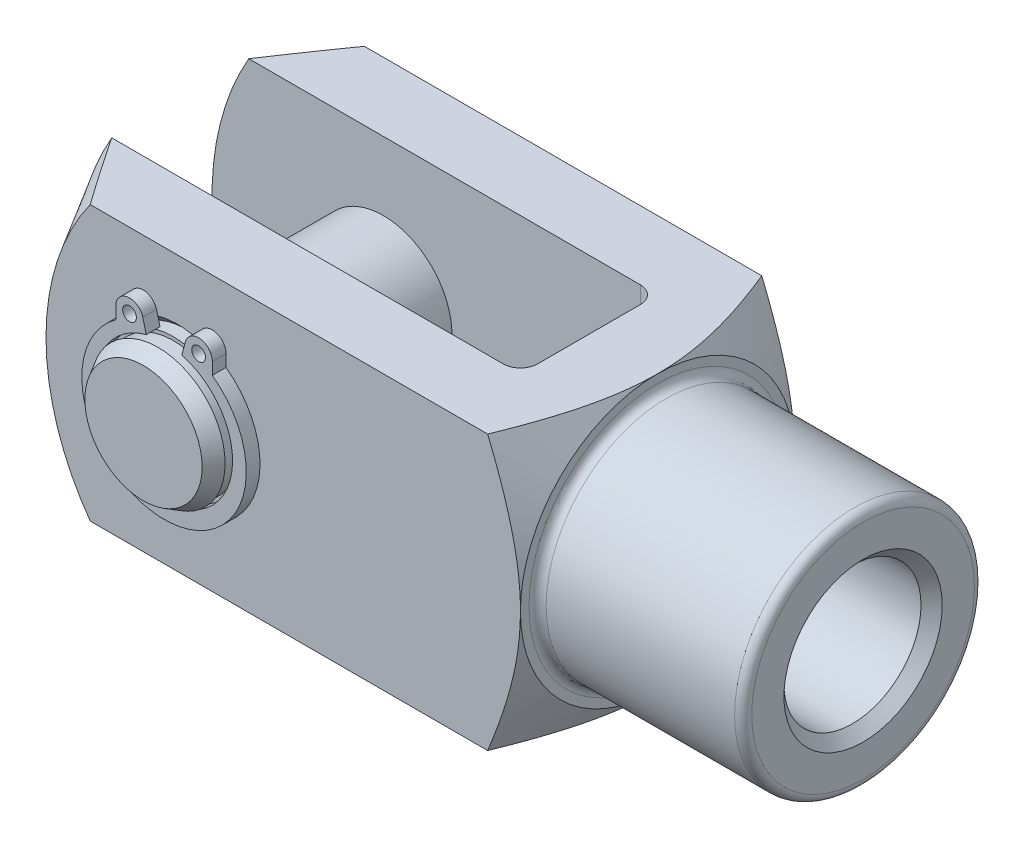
ISO-10303-21;
HEADER;
FILE_DESCRIPTION(('STEP AP214'),'2;1');
FILE_NAME('part.step','',(''),(''),'','','');
FILE_SCHEMA(('AUTOMOTIVE_DESIGN { 1 0 10303 214 1 1 1 1 }'));
ENDSEC;
DATA;
#1=APPLICATION_CONTEXT('core data for automotive mechanical design processes');
#2=APPLICATION_PROTOCOL_DEFINITION('international standard','automotive_design',2000,#1);
#3=PRODUCT_CONTEXT('',#1,'mechanical');
#4=PRODUCT('Part','Part','',(#3));
#5=PRODUCT_RELATED_PRODUCT_CATEGORY('part','',(#4));
#6=PRODUCT_DEFINITION_FORMATION('','',#4);
#7=PRODUCT_DEFINITION_CONTEXT('part definition',#1,'design');
#8=PRODUCT_DEFINITION('design','',#6,#7);
#9=PRODUCT_DEFINITION_SHAPE('','',#8);
#10=(LENGTH_UNIT() NAMED_UNIT(*) SI_UNIT(.MILLI.,.METRE.));
#11=(NAMED_UNIT(*) PLANE_ANGLE_UNIT() SI_UNIT($,.RADIAN.));
#12=(NAMED_UNIT(*) SI_UNIT($,.STERADIAN.) SOLID_ANGLE_UNIT());
#13=UNCERTAINTY_MEASURE_WITH_UNIT(LENGTH_MEASURE(1.E-05),#10,'distance_accuracy_value','');
#14=(GEOMETRIC_REPRESENTATION_CONTEXT(3) GLOBAL_UNCERTAINTY_ASSIGNED_CONTEXT((#13)) GLOBAL_UNIT_ASSIGNED_CONTEXT((#10,
#11,#12)) REPRESENTATION_CONTEXT('',''));
#15=CARTESIAN_POINT('',(0.,0.,0.));
#16=DIRECTION('',(0.,0.,1.));
#17=DIRECTION('',(1.,0.,0.));
#18=AXIS2_PLACEMENT_3D('',#15,#16,#17);
#19=CARTESIAN_POINT('',(-32.,0.,10.));
#20=DIRECTION('',(0.,0.,-1.));
#21=DIRECTION('',(-1.,0.,0.));
#22=AXIS2_PLACEMENT_3D('',#19,#20,#21);
#23=CYLINDRICAL_SURFACE('',#22,4.);
#24=CARTESIAN_POINT('',(-32.,0.,8.25));
#25=DIRECTION('',(0.,0.,1.));
#26=DIRECTION('',(1.,0.,0.));
#27=AXIS2_PLACEMENT_3D('',#24,#25,#26);
#28=CIRCLE('',#27,4.);
#29=CARTESIAN_POINT('',(-28.,0.,8.25));
#30=VERTEX_POINT('',#29);
#31=EDGE_CURVE('P0_E50',#30,#30,#28,.T.);
#32=ORIENTED_EDGE('',*,*,#31,.F.);
#33=EDGE_LOOP('',(#32));
#34=FACE_BOUND('',#33,.T.);
#35=CARTESIAN_POINT('',(-32.,0.,-8.25));
#36=DIRECTION('',(0.,0.,1.));
#37=DIRECTION('',(1.,0.,0.));
#38=AXIS2_PLACEMENT_3D('',#35,#36,#37);
#39=CIRCLE('',#38,4.);
#40=CARTESIAN_POINT('',(-28.,0.,-8.25));
#41=VERTEX_POINT('',#40);
#42=EDGE_CURVE('P0_E39',#41,#41,#39,.T.);
#43=ORIENTED_EDGE('',*,*,#42,.T.);
#44=EDGE_LOOP('',(#43));
#45=FACE_BOUND('',#44,.T.);
#46=ADVANCED_FACE('P0_F14',(#34,#45),#23,.T.);
#47=CARTESIAN_POINT('',(-32.,4.,-9.15));
#48=DIRECTION('',(0.,0.,-1.));
#49=DIRECTION('',(-1.,0.,0.));
#50=AXIS2_PLACEMENT_3D('',#47,#48,#49);
#51=PLANE('',#50);
#52=CARTESIAN_POINT('',(-32.,0.,-9.15));
#53=DIRECTION('',(0.,0.,-1.));
#54=DIRECTION('',(-1.,0.,0.));
#55=AXIS2_PLACEMENT_3D('',#52,#53,#54);
#56=CIRCLE('',#55,3.91339745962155);
#57=CARTESIAN_POINT('',(-35.9133974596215,0.,-9.15));
#58=VERTEX_POINT('',#57);
#59=EDGE_CURVE('P0_E27',#58,#58,#56,.F.);
#60=ORIENTED_EDGE('',*,*,#59,.T.);
#61=EDGE_LOOP('',(#60));
#62=FACE_BOUND('',#61,.T.);
#63=CARTESIAN_POINT('',(-32.,0.,-9.15));
#64=DIRECTION('',(0.,0.,1.));
#65=DIRECTION('',(1.,0.,0.));
#66=AXIS2_PLACEMENT_3D('',#63,#64,#65);
#67=CIRCLE('',#66,3.8);
#68=CARTESIAN_POINT('',(-28.2,0.,-9.15));
#69=VERTEX_POINT('',#68);
#70=EDGE_CURVE('P0_E31',#69,#69,#67,.T.);
#71=ORIENTED_EDGE('',*,*,#70,.F.);
#72=EDGE_LOOP('',(#71));
#73=FACE_BOUND('',#72,.T.);
#74=ADVANCED_FACE('P0_F58',(#62,#73),#51,.F.);
#75=CARTESIAN_POINT('',(-32.,0.,8.99999999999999));
#76=DIRECTION('',(0.,0.,1.));
#77=DIRECTION('',(1.,0.,0.));
#78=AXIS2_PLACEMENT_3D('',#75,#76,#77);
#79=CYLINDRICAL_SURFACE('',#78,3.8);
#80=CARTESIAN_POINT('',(-32.,0.,-8.25));
#81=DIRECTION('',(0.,0.,1.));
#82=DIRECTION('',(1.,0.,0.));
#83=AXIS2_PLACEMENT_3D('',#80,#81,#82);
#84=CIRCLE('',#83,3.8);
#85=CARTESIAN_POINT('',(-28.2,0.,-8.25));
#86=VERTEX_POINT('',#85);
#87=EDGE_CURVE('P0_E35',#86,#86,#84,.T.);
#88=ORIENTED_EDGE('',*,*,#87,.F.);
#89=EDGE_LOOP('',(#88));
#90=FACE_BOUND('',#89,.T.);
#91=ORIENTED_EDGE('',*,*,#70,.T.);
#92=EDGE_LOOP('',(#91));
#93=FACE_BOUND('',#92,.T.);
#94=ADVANCED_FACE('P0_F66',(#90,#93),#79,.T.);
#95=CARTESIAN_POINT('',(-32.,4.,-8.25));
#96=DIRECTION('',(0.,0.,1.));
#97=DIRECTION('',(1.,0.,0.));
#98=AXIS2_PLACEMENT_3D('',#95,#96,#97);
#99=PLANE('',#98);
#100=ORIENTED_EDGE('',*,*,#42,.F.);
#101=EDGE_LOOP('',(#100));
#102=FACE_BOUND('',#101,.T.);
#103=ORIENTED_EDGE('',*,*,#87,.T.);
#104=EDGE_LOOP('',(#103));
#105=FACE_BOUND('',#104,.T.);
#106=ADVANCED_FACE('P0_F62',(#102,#105),#99,.F.);
#107=CARTESIAN_POINT('',(-32.,0.,-10.));
#108=DIRECTION('',(0.,0.,1.));
#109=DIRECTION('',(1.,0.,0.));
#110=AXIS2_PLACEMENT_3D('',#107,#108,#109);
#111=PLANE('',#110);
#112=CARTESIAN_POINT('',(-32.,0.,-10.));
#113=DIRECTION('',(0.,0.,1.));
#114=DIRECTION('',(1.,0.,0.));
#115=AXIS2_PLACEMENT_3D('',#112,#113,#114);
#116=CIRCLE('',#115,3.42264973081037);
#117=CARTESIAN_POINT('',(-28.5773502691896,0.,-10.));
#118=VERTEX_POINT('',#117);
#119=EDGE_CURVE('P0_E22',#118,#118,#116,.F.);
#120=ORIENTED_EDGE('',*,*,#119,.T.);
#121=EDGE_LOOP('',(#120));
#122=FACE_BOUND('',#121,.T.);
#123=ADVANCED_FACE('P0_F65',(#122),#111,.F.);
#124=CARTESIAN_POINT('',(-32.,0.,-8.99999999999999));
#125=DIRECTION('',(0.,0.,1.));
#126=DIRECTION('',(1.,0.,0.));
#127=AXIS2_PLACEMENT_3D('',#124,#125,#126);
#128=CONICAL_SURFACE('',#127,4.,0.523598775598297);
#129=ORIENTED_EDGE('',*,*,#59,.F.);
#130=EDGE_LOOP('',(#129));
#131=FACE_BOUND('',#130,.T.);
#132=ORIENTED_EDGE('',*,*,#119,.F.);
#133=EDGE_LOOP('',(#132));
#134=FACE_BOUND('',#133,.T.);
#135=ADVANCED_FACE('P0_F84',(#131,#134),#128,.T.);
#136=CARTESIAN_POINT('',(-32.,4.,8.25));
#137=DIRECTION('',(0.,0.,-1.));
#138=DIRECTION('',(-1.,0.,0.));
#139=AXIS2_PLACEMENT_3D('',#136,#137,#138);
#140=PLANE('',#139);
#141=CARTESIAN_POINT('',(-32.,0.,8.25));
#142=DIRECTION('',(0.,0.,1.));
#143=DIRECTION('',(1.,0.,0.));
#144=AXIS2_PLACEMENT_3D('',#141,#142,#143);
#145=CIRCLE('',#144,3.8);
#146=CARTESIAN_POINT('',(-28.2,0.,8.25));
#147=VERTEX_POINT('',#146);
#148=EDGE_CURVE('P0_E44',#147,#147,#145,.T.);
#149=ORIENTED_EDGE('',*,*,#148,.F.);
#150=EDGE_LOOP('',(#149));
#151=FACE_BOUND('',#150,.T.);
#152=ORIENTED_EDGE('',*,*,#31,.T.);
#153=EDGE_LOOP('',(#152));
#154=FACE_BOUND('',#153,.T.);
#155=ADVANCED_FACE('P0_F54',(#151,#154),#140,.F.);
#156=CARTESIAN_POINT('',(-32.,0.,8.99999999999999));
#157=DIRECTION('',(0.,0.,1.));
#158=DIRECTION('',(1.,0.,0.));
#159=AXIS2_PLACEMENT_3D('',#156,#157,#158);
#160=CYLINDRICAL_SURFACE('',#159,3.8);
#161=CARTESIAN_POINT('',(-32.,0.,9.15));
#162=DIRECTION('',(0.,0.,1.));
#163=DIRECTION('',(1.,0.,0.));
#164=AXIS2_PLACEMENT_3D('',#161,#162,#163);
#165=CIRCLE('',#164,3.8);
#166=CARTESIAN_POINT('',(-28.2,0.,9.15));
#167=VERTEX_POINT('',#166);
#168=EDGE_CURVE('P0_E47',#167,#167,#165,.T.);
#169=ORIENTED_EDGE('',*,*,#168,.F.);
#170=EDGE_LOOP('',(#169));
#171=FACE_BOUND('',#170,.T.);
#172=ORIENTED_EDGE('',*,*,#148,.T.);
#173=EDGE_LOOP('',(#172));
#174=FACE_BOUND('',#173,.T.);
#175=ADVANCED_FACE('P0_F91',(#171,#174),#160,.T.);
#176=CARTESIAN_POINT('',(-32.,4.,9.15));
#177=DIRECTION('',(0.,0.,1.));
#178=DIRECTION('',(1.,0.,0.));
#179=AXIS2_PLACEMENT_3D('',#176,#177,#178);
#180=PLANE('',#179);
#181=CARTESIAN_POINT('',(-32.,0.,9.15));
#182=DIRECTION('',(0.,0.,1.));
#183=DIRECTION('',(1.,0.,0.));
#184=AXIS2_PLACEMENT_3D('',#181,#182,#183);
#185=CIRCLE('',#184,3.91339745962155);
#186=CARTESIAN_POINT('',(-28.0866025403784,0.,9.15));
#187=VERTEX_POINT('',#186);
#188=EDGE_CURVE('P0_E18',#187,#187,#185,.F.);
#189=ORIENTED_EDGE('',*,*,#188,.T.);
#190=EDGE_LOOP('',(#189));
#191=FACE_BOUND('',#190,.T.);
#192=ORIENTED_EDGE('',*,*,#168,.T.);
#193=EDGE_LOOP('',(#192));
#194=FACE_BOUND('',#193,.T.);
#195=ADVANCED_FACE('P0_F82',(#191,#194),#180,.F.);
#196=CARTESIAN_POINT('',(-32.,0.,10.));
#197=DIRECTION('',(0.,0.,1.));
#198=DIRECTION('',(1.,0.,0.));
#199=AXIS2_PLACEMENT_3D('',#196,#197,#198);
#200=PLANE('',#199);
#201=CARTESIAN_POINT('',(-32.,0.,10.));
#202=DIRECTION('',(0.,0.,1.));
#203=DIRECTION('',(1.,0.,0.));
#204=AXIS2_PLACEMENT_3D('',#201,#202,#203);
#205=CIRCLE('',#204,3.42264973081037);
#206=CARTESIAN_POINT('',(-28.5773502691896,0.,10.));
#207=VERTEX_POINT('',#206);
#208=EDGE_CURVE('P0_E10',#207,#207,#205,.T.);
#209=ORIENTED_EDGE('',*,*,#208,.T.);
#210=EDGE_LOOP('',(#209));
#211=FACE_BOUND('',#210,.T.);
#212=ADVANCED_FACE('P0_F79',(#211),#200,.T.);
#213=CARTESIAN_POINT('',(-32.,0.,10.));
#214=DIRECTION('',(0.,0.,-1.));
#215=DIRECTION('',(-1.,0.,0.));
#216=AXIS2_PLACEMENT_3D('',#213,#214,#215);
#217=CONICAL_SURFACE('',#216,3.42264973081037,0.523598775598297);
#218=ORIENTED_EDGE('',*,*,#188,.F.);
#219=EDGE_LOOP('',(#218));
#220=FACE_BOUND('',#219,.T.);
#221=ORIENTED_EDGE('',*,*,#208,.F.);
#222=EDGE_LOOP('',(#221));
#223=FACE_BOUND('',#222,.T.);
#224=ADVANCED_FACE('P0_F16',(#220,#223),#217,.T.);
#225=CLOSED_SHELL('',(#46,#74,#94,#106,#123,#135,#155,#175,#195,#212,#224));
#226=MANIFOLD_SOLID_BREP('P0_B1',#225);
#227=CARTESIAN_POINT('',(-32.,0.,8.79999999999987));
#228=DIRECTION('',(0.,0.,1.));
#229=DIRECTION('',(1.,0.,0.));
#230=AXIS2_PLACEMENT_3D('',#227,#228,#229);
#231=PLANE('',#230);
#232=CARTESIAN_POINT('',(-34.0150720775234,4.42938873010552,8.79999999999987));
#233=DIRECTION('',(0.,0.,1.));
#234=DIRECTION('',(1.,0.,0.));
#235=AXIS2_PLACEMENT_3D('',#232,#233,#234);
#236=CIRCLE('',#235,0.4);
#237=CARTESIAN_POINT('',(-33.6150720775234,4.42938873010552,8.79999999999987));
#238=VERTEX_POINT('',#237);
#239=EDGE_CURVE('P1_E117',#238,#238,#236,.T.);
#240=ORIENTED_EDGE('',*,*,#239,.F.);
#241=EDGE_LOOP('',(#240));
#242=FACE_BOUND('',#241,.T.);
#243=CARTESIAN_POINT('',(-32.,0.,8.79999999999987));
#244=DIRECTION('',(0.,0.,-1.));
#245=DIRECTION('',(1.,0.,0.));
#246=AXIS2_PLACEMENT_3D('',#243,#244,#245);
#247=CIRCLE('',#246,4.);
#248=CARTESIAN_POINT('',(-30.9647238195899,3.86370330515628,8.79999999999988));
#249=VERTEX_POINT('',#248);
#250=CARTESIAN_POINT('',(-33.0352761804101,3.86370330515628,8.79999999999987));
#251=VERTEX_POINT('',#250);
#252=EDGE_CURVE('P1_E128',#249,#251,#247,.T.);
#253=ORIENTED_EDGE('',*,*,#252,.T.);
#254=DIRECTION('',(-0.258819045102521,0.965925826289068,0.));
#255=VECTOR('',#254,1.);
#256=CARTESIAN_POINT('',(-33.0352761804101,3.86370330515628,8.79999999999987));
#257=LINE('',#256,#255);
#258=CARTESIAN_POINT('',(-33.2423314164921,4.63644396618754,8.79999999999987));
#259=VERTEX_POINT('',#258);
#260=EDGE_CURVE('P1_E76',#251,#259,#257,.T.);
#261=ORIENTED_EDGE('',*,*,#260,.T.);
#262=CARTESIAN_POINT('',(-34.0150720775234,4.42938873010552,8.79999999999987));
#263=DIRECTION('',(0.,0.,1.));
#264=DIRECTION('',(1.,0.,0.));
#265=AXIS2_PLACEMENT_3D('',#262,#263,#264);
#266=CIRCLE('',#265,0.8);
#267=CARTESIAN_POINT('',(-34.8150720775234,4.42938873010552,8.79999999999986));
#268=VERTEX_POINT('',#267);
#269=EDGE_CURVE('P1_E143',#259,#268,#266,.T.);
#270=ORIENTED_EDGE('',*,*,#269,.T.);
#271=DIRECTION('',(0.,-1.,0.));
#272=VECTOR('',#271,1.);
#273=CARTESIAN_POINT('',(-34.8150720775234,4.42938873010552,8.79999999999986));
#274=LINE('',#273,#272);
#275=CARTESIAN_POINT('',(-34.8150720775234,3.72784891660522,8.79999999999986));
#276=VERTEX_POINT('',#275);
#277=EDGE_CURVE('P1_E156',#268,#276,#274,.T.);
#278=ORIENTED_EDGE('',*,*,#277,.T.);
#279=CARTESIAN_POINT('',(-32.,-0.159999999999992,8.79999999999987));
#280=DIRECTION('',(0.,0.,1.));
#281=DIRECTION('',(1.,0.,0.));
#282=AXIS2_PLACEMENT_3D('',#279,#280,#281);
#283=CIRCLE('',#282,4.8);
#284=CARTESIAN_POINT('',(-29.1849279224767,3.72784891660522,8.79999999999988));
#285=VERTEX_POINT('',#284);
#286=EDGE_CURVE('P1_E95',#276,#285,#283,.T.);
#287=ORIENTED_EDGE('',*,*,#286,.T.);
#288=DIRECTION('',(0.,1.,0.));
#289=VECTOR('',#288,1.);
#290=CARTESIAN_POINT('',(-29.1849279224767,4.42938873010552,8.79999999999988));
#291=LINE('',#290,#289);
#292=CARTESIAN_POINT('',(-29.1849279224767,4.42938873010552,8.79999999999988));
#293=VERTEX_POINT('',#292);
#294=EDGE_CURVE('P1_E89',#285,#293,#291,.T.);
#295=ORIENTED_EDGE('',*,*,#294,.T.);
#296=CARTESIAN_POINT('',(-29.9849279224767,4.42938873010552,8.79999999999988));
#297=DIRECTION('',(0.,0.,1.));
#298=DIRECTION('',(-1.,0.,0.));
#299=AXIS2_PLACEMENT_3D('',#296,#297,#298);
#300=CIRCLE('',#299,0.8);
#301=CARTESIAN_POINT('',(-30.7576685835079,4.63644396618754,8.79999999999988));
#302=VERTEX_POINT('',#301);
#303=EDGE_CURVE('P1_E93',#293,#302,#300,.T.);
#304=ORIENTED_EDGE('',*,*,#303,.T.);
#305=DIRECTION('',(-0.258819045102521,-0.965925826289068,0.));
#306=VECTOR('',#305,1.);
#307=CARTESIAN_POINT('',(-30.9647238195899,3.86370330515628,8.79999999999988));
#308=LINE('',#307,#306);
#309=EDGE_CURVE('P1_E33',#302,#249,#308,.T.);
#310=ORIENTED_EDGE('',*,*,#309,.T.);
#311=EDGE_LOOP('',(#253,#261,#270,#278,#287,#295,#304,#310));
#312=FACE_BOUND('',#311,.T.);
#313=CARTESIAN_POINT('',(-29.9849279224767,4.42938873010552,8.79999999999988));
#314=DIRECTION('',(0.,0.,1.));
#315=DIRECTION('',(-1.,0.,0.));
#316=AXIS2_PLACEMENT_3D('',#313,#314,#315);
#317=CIRCLE('',#316,0.4);
#318=CARTESIAN_POINT('',(-30.3849279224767,4.42938873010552,8.79999999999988));
#319=VERTEX_POINT('',#318);
#320=EDGE_CURVE('P1_E165',#319,#319,#317,.T.);
#321=ORIENTED_EDGE('',*,*,#320,.F.);
#322=EDGE_LOOP('',(#321));
#323=FACE_BOUND('',#322,.T.);
#324=ADVANCED_FACE('P1_F16',(#242,#312,#323),#231,.T.);
#325=CARTESIAN_POINT('',(-32.,0.,7.99999999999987));
#326=DIRECTION('',(0.,0.,1.));
#327=DIRECTION('',(1.,0.,0.));
#328=AXIS2_PLACEMENT_3D('',#325,#326,#327);
#329=PLANE('',#328);
#330=CARTESIAN_POINT('',(-34.0150720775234,4.42938873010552,7.99999999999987));
#331=DIRECTION('',(0.,0.,1.));
#332=DIRECTION('',(1.,0.,0.));
#333=AXIS2_PLACEMENT_3D('',#330,#331,#332);
#334=CIRCLE('',#333,0.4);
#335=CARTESIAN_POINT('',(-33.6150720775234,4.42938873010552,7.99999999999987));
#336=VERTEX_POINT('',#335);
#337=EDGE_CURVE('P1_E162',#336,#336,#334,.T.);
#338=ORIENTED_EDGE('',*,*,#337,.T.);
#339=EDGE_LOOP('',(#338));
#340=FACE_BOUND('',#339,.T.);
#341=CARTESIAN_POINT('',(-32.,0.,7.99999999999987));
#342=DIRECTION('',(0.,0.,-1.));
#343=DIRECTION('',(1.,0.,0.));
#344=AXIS2_PLACEMENT_3D('',#341,#342,#343);
#345=CIRCLE('',#344,4.);
#346=CARTESIAN_POINT('',(-30.9647238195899,3.86370330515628,7.99999999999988));
#347=VERTEX_POINT('',#346);
#348=CARTESIAN_POINT('',(-33.0352761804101,3.86370330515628,7.99999999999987));
#349=VERTEX_POINT('',#348);
#350=EDGE_CURVE('P1_E113',#347,#349,#345,.T.);
#351=ORIENTED_EDGE('',*,*,#350,.F.);
#352=DIRECTION('',(-0.258819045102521,-0.965925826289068,0.));
#353=VECTOR('',#352,1.);
#354=CARTESIAN_POINT('',(-30.9647238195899,3.86370330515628,7.99999999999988));
#355=LINE('',#354,#353);
#356=CARTESIAN_POINT('',(-30.7576685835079,4.63644396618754,7.99999999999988));
#357=VERTEX_POINT('',#356);
#358=EDGE_CURVE('P1_E68',#357,#347,#355,.T.);
#359=ORIENTED_EDGE('',*,*,#358,.F.);
#360=CARTESIAN_POINT('',(-29.9849279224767,4.42938873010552,7.99999999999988));
#361=DIRECTION('',(0.,0.,1.));
#362=DIRECTION('',(-1.,0.,0.));
#363=AXIS2_PLACEMENT_3D('',#360,#361,#362);
#364=CIRCLE('',#363,0.8);
#365=CARTESIAN_POINT('',(-29.1849279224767,4.42938873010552,7.99999999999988));
#366=VERTEX_POINT('',#365);
#367=EDGE_CURVE('P1_E62',#366,#357,#364,.T.);
#368=ORIENTED_EDGE('',*,*,#367,.F.);
#369=DIRECTION('',(0.,1.,0.));
#370=VECTOR('',#369,1.);
#371=CARTESIAN_POINT('',(-29.1849279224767,4.42938873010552,7.99999999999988));
#372=LINE('',#371,#370);
#373=CARTESIAN_POINT('',(-29.1849279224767,3.72784891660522,7.99999999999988));
#374=VERTEX_POINT('',#373);
#375=EDGE_CURVE('P1_E103',#374,#366,#372,.T.);
#376=ORIENTED_EDGE('',*,*,#375,.F.);
#377=CARTESIAN_POINT('',(-32.,-0.159999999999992,7.99999999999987));
#378=DIRECTION('',(0.,0.,1.));
#379=DIRECTION('',(1.,0.,0.));
#380=AXIS2_PLACEMENT_3D('',#377,#378,#379);
#381=CIRCLE('',#380,4.8);
#382=CARTESIAN_POINT('',(-34.8150720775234,3.72784891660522,7.99999999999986));
#383=VERTEX_POINT('',#382);
#384=EDGE_CURVE('P1_E123',#383,#374,#381,.T.);
#385=ORIENTED_EDGE('',*,*,#384,.F.);
#386=DIRECTION('',(0.,-1.,0.));
#387=VECTOR('',#386,1.);
#388=CARTESIAN_POINT('',(-34.8150720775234,4.42938873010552,7.99999999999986));
#389=LINE('',#388,#387);
#390=CARTESIAN_POINT('',(-34.8150720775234,4.42938873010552,7.99999999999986));
#391=VERTEX_POINT('',#390);
#392=EDGE_CURVE('P1_E121',#391,#383,#389,.T.);
#393=ORIENTED_EDGE('',*,*,#392,.F.);
#394=CARTESIAN_POINT('',(-34.0150720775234,4.42938873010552,7.99999999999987));
#395=DIRECTION('',(0.,0.,1.));
#396=DIRECTION('',(1.,0.,0.));
#397=AXIS2_PLACEMENT_3D('',#394,#395,#396);
#398=CIRCLE('',#397,0.8);
#399=CARTESIAN_POINT('',(-33.2423314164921,4.63644396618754,7.99999999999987));
#400=VERTEX_POINT('',#399);
#401=EDGE_CURVE('P1_E119',#400,#391,#398,.T.);
#402=ORIENTED_EDGE('',*,*,#401,.F.);
#403=DIRECTION('',(-0.258819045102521,0.965925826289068,0.));
#404=VECTOR('',#403,1.);
#405=CARTESIAN_POINT('',(-33.0352761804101,3.86370330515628,7.99999999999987));
#406=LINE('',#405,#404);
#407=EDGE_CURVE('P1_E116',#349,#400,#406,.T.);
#408=ORIENTED_EDGE('',*,*,#407,.F.);
#409=EDGE_LOOP('',(#351,#359,#368,#376,#385,#393,#402,#408));
#410=FACE_BOUND('',#409,.T.);
#411=CARTESIAN_POINT('',(-29.9849279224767,4.42938873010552,7.99999999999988));
#412=DIRECTION('',(0.,0.,1.));
#413=DIRECTION('',(-1.,0.,0.));
#414=AXIS2_PLACEMENT_3D('',#411,#412,#413);
#415=CIRCLE('',#414,0.4);
#416=CARTESIAN_POINT('',(-30.3849279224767,4.42938873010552,7.99999999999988));
#417=VERTEX_POINT('',#416);
#418=EDGE_CURVE('P1_E168',#417,#417,#415,.T.);
#419=ORIENTED_EDGE('',*,*,#418,.T.);
#420=EDGE_LOOP('',(#419));
#421=FACE_BOUND('',#420,.T.);
#422=ADVANCED_FACE('P1_F147',(#340,#410,#421),#329,.F.);
#423=CARTESIAN_POINT('',(-32.,0.,8.79999999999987));
#424=DIRECTION('',(0.,0.,-1.));
#425=DIRECTION('',(-1.,0.,0.));
#426=AXIS2_PLACEMENT_3D('',#423,#424,#425);
#427=CYLINDRICAL_SURFACE('',#426,4.);
#428=ORIENTED_EDGE('',*,*,#350,.T.);
#429=DIRECTION('',(0.,0.,-1.));
#430=VECTOR('',#429,1.);
#431=CARTESIAN_POINT('',(-33.0352761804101,3.86370330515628,8.79999999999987));
#432=LINE('',#431,#430);
#433=EDGE_CURVE('P1_E11',#251,#349,#432,.T.);
#434=ORIENTED_EDGE('',*,*,#433,.F.);
#435=ORIENTED_EDGE('',*,*,#252,.F.);
#436=DIRECTION('',(0.,0.,-1.));
#437=VECTOR('',#436,1.);
#438=CARTESIAN_POINT('',(-30.9647238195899,3.86370330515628,8.79999999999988));
#439=LINE('',#438,#437);
#440=EDGE_CURVE('P1_E109',#249,#347,#439,.T.);
#441=ORIENTED_EDGE('',*,*,#440,.T.);
#442=EDGE_LOOP('',(#428,#434,#435,#441));
#443=FACE_BOUND('',#442,.T.);
#444=ADVANCED_FACE('P1_F18',(#443),#427,.F.);
#445=CARTESIAN_POINT('',(-33.0352761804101,3.86370330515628,8.79999999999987));
#446=DIRECTION('',(-0.965925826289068,-0.258819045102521,0.));
#447=DIRECTION('',(0.258819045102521,-0.965925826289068,0.));
#448=AXIS2_PLACEMENT_3D('',#445,#446,#447);
#449=PLANE('',#448);
#450=ORIENTED_EDGE('',*,*,#407,.T.);
#451=DIRECTION('',(0.,0.,-1.));
#452=VECTOR('',#451,1.);
#453=CARTESIAN_POINT('',(-33.2423314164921,4.63644396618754,8.79999999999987));
#454=LINE('',#453,#452);
#455=EDGE_CURVE('P1_E25',#259,#400,#454,.T.);
#456=ORIENTED_EDGE('',*,*,#455,.F.);
#457=ORIENTED_EDGE('',*,*,#260,.F.);
#458=ORIENTED_EDGE('',*,*,#433,.T.);
#459=EDGE_LOOP('',(#450,#456,#457,#458));
#460=FACE_BOUND('',#459,.T.);
#461=ADVANCED_FACE('P1_F202',(#460),#449,.F.);
#462=CARTESIAN_POINT('',(-34.0150720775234,4.42938873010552,8.79999999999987));
#463=DIRECTION('',(0.,0.,-1.));
#464=DIRECTION('',(-1.,0.,0.));
#465=AXIS2_PLACEMENT_3D('',#462,#463,#464);
#466=CYLINDRICAL_SURFACE('',#465,0.8);
#467=ORIENTED_EDGE('',*,*,#401,.T.);
#468=DIRECTION('',(0.,0.,-1.));
#469=VECTOR('',#468,1.);
#470=CARTESIAN_POINT('',(-34.8150720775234,4.42938873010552,8.79999999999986));
#471=LINE('',#470,#469);
#472=EDGE_CURVE('P1_E135',#268,#391,#471,.T.);
#473=ORIENTED_EDGE('',*,*,#472,.F.);
#474=ORIENTED_EDGE('',*,*,#269,.F.);
#475=ORIENTED_EDGE('',*,*,#455,.T.);
#476=EDGE_LOOP('',(#467,#473,#474,#475));
#477=FACE_BOUND('',#476,.T.);
#478=ADVANCED_FACE('P1_F141',(#477),#466,.T.);
#479=CARTESIAN_POINT('',(-34.8150720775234,4.42938873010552,8.79999999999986));
#480=DIRECTION('',(1.,0.,0.));
#481=DIRECTION('',(0.,1.,0.));
#482=AXIS2_PLACEMENT_3D('',#479,#480,#481);
#483=PLANE('',#482);
#484=ORIENTED_EDGE('',*,*,#392,.T.);
#485=DIRECTION('',(0.,0.,-1.));
#486=VECTOR('',#485,1.);
#487=CARTESIAN_POINT('',(-34.8150720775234,3.72784891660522,8.79999999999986));
#488=LINE('',#487,#486);
#489=EDGE_CURVE('P1_E132',#276,#383,#488,.T.);
#490=ORIENTED_EDGE('',*,*,#489,.F.);
#491=ORIENTED_EDGE('',*,*,#277,.F.);
#492=ORIENTED_EDGE('',*,*,#472,.T.);
#493=EDGE_LOOP('',(#484,#490,#491,#492));
#494=FACE_BOUND('',#493,.T.);
#495=ADVANCED_FACE('P1_F152',(#494),#483,.F.);
#496=CARTESIAN_POINT('',(-32.,-0.159999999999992,8.79999999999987));
#497=DIRECTION('',(0.,0.,-1.));
#498=DIRECTION('',(-1.,0.,0.));
#499=AXIS2_PLACEMENT_3D('',#496,#497,#498);
#500=CYLINDRICAL_SURFACE('',#499,4.8);
#501=ORIENTED_EDGE('',*,*,#384,.T.);
#502=DIRECTION('',(0.,0.,-1.));
#503=VECTOR('',#502,1.);
#504=CARTESIAN_POINT('',(-29.1849279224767,3.72784891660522,8.79999999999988));
#505=LINE('',#504,#503);
#506=EDGE_CURVE('P1_E104',#285,#374,#505,.T.);
#507=ORIENTED_EDGE('',*,*,#506,.F.);
#508=ORIENTED_EDGE('',*,*,#286,.F.);
#509=ORIENTED_EDGE('',*,*,#489,.T.);
#510=EDGE_LOOP('',(#501,#507,#508,#509));
#511=FACE_BOUND('',#510,.T.);
#512=ADVANCED_FACE('P1_F155',(#511),#500,.T.);
#513=CARTESIAN_POINT('',(-29.1849279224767,4.42938873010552,8.79999999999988));
#514=DIRECTION('',(-1.,0.,0.));
#515=DIRECTION('',(0.,-1.,0.));
#516=AXIS2_PLACEMENT_3D('',#513,#514,#515);
#517=PLANE('',#516);
#518=ORIENTED_EDGE('',*,*,#375,.T.);
#519=DIRECTION('',(0.,0.,-1.));
#520=VECTOR('',#519,1.);
#521=CARTESIAN_POINT('',(-29.1849279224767,4.42938873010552,8.79999999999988));
#522=LINE('',#521,#520);
#523=EDGE_CURVE('P1_E100',#293,#366,#522,.T.);
#524=ORIENTED_EDGE('',*,*,#523,.F.);
#525=ORIENTED_EDGE('',*,*,#294,.F.);
#526=ORIENTED_EDGE('',*,*,#506,.T.);
#527=EDGE_LOOP('',(#518,#524,#525,#526));
#528=FACE_BOUND('',#527,.T.);
#529=ADVANCED_FACE('P1_F101',(#528),#517,.F.);
#530=CARTESIAN_POINT('',(-29.9849279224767,4.42938873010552,8.79999999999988));
#531=DIRECTION('',(0.,0.,-1.));
#532=DIRECTION('',(-1.,0.,0.));
#533=AXIS2_PLACEMENT_3D('',#530,#531,#532);
#534=CYLINDRICAL_SURFACE('',#533,0.8);
#535=ORIENTED_EDGE('',*,*,#367,.T.);
#536=DIRECTION('',(0.,0.,-1.));
#537=VECTOR('',#536,1.);
#538=CARTESIAN_POINT('',(-30.7576685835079,4.63644396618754,8.79999999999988));
#539=LINE('',#538,#537);
#540=EDGE_CURVE('P1_E105',#302,#357,#539,.T.);
#541=ORIENTED_EDGE('',*,*,#540,.F.);
#542=ORIENTED_EDGE('',*,*,#303,.F.);
#543=ORIENTED_EDGE('',*,*,#523,.T.);
#544=EDGE_LOOP('',(#535,#541,#542,#543));
#545=FACE_BOUND('',#544,.T.);
#546=ADVANCED_FACE('P1_F107',(#545),#534,.T.);
#547=CARTESIAN_POINT('',(-30.9647238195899,3.86370330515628,8.79999999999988));
#548=DIRECTION('',(0.965925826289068,-0.258819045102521,0.));
#549=DIRECTION('',(0.258819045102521,0.965925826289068,0.));
#550=AXIS2_PLACEMENT_3D('',#547,#548,#549);
#551=PLANE('',#550);
#552=ORIENTED_EDGE('',*,*,#358,.T.);
#553=ORIENTED_EDGE('',*,*,#440,.F.);
#554=ORIENTED_EDGE('',*,*,#309,.F.);
#555=ORIENTED_EDGE('',*,*,#540,.T.);
#556=EDGE_LOOP('',(#552,#553,#554,#555));
#557=FACE_BOUND('',#556,.T.);
#558=ADVANCED_FACE('P1_F190',(#557),#551,.F.);
#559=CARTESIAN_POINT('',(-34.0150720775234,4.42938873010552,8.79999999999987));
#560=DIRECTION('',(0.,0.,-1.));
#561=DIRECTION('',(-1.,0.,0.));
#562=AXIS2_PLACEMENT_3D('',#559,#560,#561);
#563=CYLINDRICAL_SURFACE('',#562,0.4);
#564=ORIENTED_EDGE('',*,*,#239,.T.);
#565=EDGE_LOOP('',(#564));
#566=FACE_BOUND('',#565,.T.);
#567=ORIENTED_EDGE('',*,*,#337,.F.);
#568=EDGE_LOOP('',(#567));
#569=FACE_BOUND('',#568,.T.);
#570=ADVANCED_FACE('P1_F187',(#566,#569),#563,.F.);
#571=CARTESIAN_POINT('',(-29.9849279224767,4.42938873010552,8.79999999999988));
#572=DIRECTION('',(0.,0.,-1.));
#573=DIRECTION('',(-1.,0.,0.));
#574=AXIS2_PLACEMENT_3D('',#571,#572,#573);
#575=CYLINDRICAL_SURFACE('',#574,0.4);
#576=ORIENTED_EDGE('',*,*,#320,.T.);
#577=EDGE_LOOP('',(#576));
#578=FACE_BOUND('',#577,.T.);
#579=ORIENTED_EDGE('',*,*,#418,.F.);
#580=EDGE_LOOP('',(#579));
#581=FACE_BOUND('',#580,.T.);
#582=ADVANCED_FACE('P1_F174',(#578,#581),#575,.F.);
#583=CLOSED_SHELL('',(#324,#422,#444,#461,#478,#495,#512,#529,#546,#558,#570,#582));
#584=MANIFOLD_SOLID_BREP('P1_B1',#583);
#585=CARTESIAN_POINT('',(-32.,0.,-8.79999999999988));
#586=DIRECTION('',(0.,0.,-1.));
#587=DIRECTION('',(-1.,0.,0.));
#588=AXIS2_PLACEMENT_3D('',#585,#586,#587);
#589=PLANE('',#588);
#590=CARTESIAN_POINT('',(-29.9849279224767,4.42938873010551,-8.79999999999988));
#591=DIRECTION('',(0.,0.,-1.));
#592=DIRECTION('',(-1.,0.,0.));
#593=AXIS2_PLACEMENT_3D('',#590,#591,#592);
#594=CIRCLE('',#593,0.4);
#595=CARTESIAN_POINT('',(-30.3849279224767,4.42938873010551,-8.79999999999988));
#596=VERTEX_POINT('',#595);
#597=EDGE_CURVE('P2_E117',#596,#596,#594,.T.);
#598=ORIENTED_EDGE('',*,*,#597,.F.);
#599=EDGE_LOOP('',(#598));
#600=FACE_BOUND('',#599,.T.);
#601=CARTESIAN_POINT('',(-32.,0.,-8.79999999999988));
#602=DIRECTION('',(0.,0.,1.));
#603=DIRECTION('',(-1.,0.,0.));
#604=AXIS2_PLACEMENT_3D('',#601,#602,#603);
#605=CIRCLE('',#604,4.);
#606=CARTESIAN_POINT('',(-33.0352761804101,3.86370330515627,-8.79999999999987));
#607=VERTEX_POINT('',#606);
#608=CARTESIAN_POINT('',(-30.9647238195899,3.86370330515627,-8.79999999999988));
#609=VERTEX_POINT('',#608);
#610=EDGE_CURVE('P2_E128',#607,#609,#605,.T.);
#611=ORIENTED_EDGE('',*,*,#610,.T.);
#612=DIRECTION('',(0.258819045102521,0.965925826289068,0.));
#613=VECTOR('',#612,1.);
#614=CARTESIAN_POINT('',(-30.9647238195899,3.86370330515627,-8.79999999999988));
#615=LINE('',#614,#613);
#616=CARTESIAN_POINT('',(-30.7576685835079,4.63644396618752,-8.79999999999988));
#617=VERTEX_POINT('',#616);
#618=EDGE_CURVE('P2_E76',#609,#617,#615,.T.);
#619=ORIENTED_EDGE('',*,*,#618,.T.);
#620=CARTESIAN_POINT('',(-29.9849279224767,4.42938873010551,-8.79999999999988));
#621=DIRECTION('',(0.,0.,-1.));
#622=DIRECTION('',(-1.,0.,0.));
#623=AXIS2_PLACEMENT_3D('',#620,#621,#622);
#624=CIRCLE('',#623,0.8);
#625=CARTESIAN_POINT('',(-29.1849279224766,4.42938873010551,-8.79999999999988));
#626=VERTEX_POINT('',#625);
#627=EDGE_CURVE('P2_E143',#617,#626,#624,.T.);
#628=ORIENTED_EDGE('',*,*,#627,.T.);
#629=DIRECTION('',(0.,-1.,0.));
#630=VECTOR('',#629,1.);
#631=CARTESIAN_POINT('',(-29.1849279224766,4.42938873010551,-8.79999999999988));
#632=LINE('',#631,#630);
#633=CARTESIAN_POINT('',(-29.1849279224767,3.72784891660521,-8.79999999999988));
#634=VERTEX_POINT('',#633);
#635=EDGE_CURVE('P2_E156',#626,#634,#632,.T.);
#636=ORIENTED_EDGE('',*,*,#635,.T.);
#637=CARTESIAN_POINT('',(-32.,-0.160000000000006,-8.79999999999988));
#638=DIRECTION('',(0.,0.,-1.));
#639=DIRECTION('',(-1.,0.,0.));
#640=AXIS2_PLACEMENT_3D('',#637,#638,#639);
#641=CIRCLE('',#640,4.8);
#642=CARTESIAN_POINT('',(-34.8150720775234,3.72784891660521,-8.79999999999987));
#643=VERTEX_POINT('',#642);
#644=EDGE_CURVE('P2_E95',#634,#643,#641,.T.);
#645=ORIENTED_EDGE('',*,*,#644,.T.);
#646=DIRECTION('',(0.,1.,0.));
#647=VECTOR('',#646,1.);
#648=CARTESIAN_POINT('',(-34.8150720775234,4.42938873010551,-8.79999999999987));
#649=LINE('',#648,#647);
#650=CARTESIAN_POINT('',(-34.8150720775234,4.42938873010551,-8.79999999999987));
#651=VERTEX_POINT('',#650);
#652=EDGE_CURVE('P2_E89',#643,#651,#649,.T.);
#653=ORIENTED_EDGE('',*,*,#652,.T.);
#654=CARTESIAN_POINT('',(-34.0150720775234,4.42938873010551,-8.79999999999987));
#655=DIRECTION('',(0.,0.,-1.));
#656=DIRECTION('',(1.,0.,0.));
#657=AXIS2_PLACEMENT_3D('',#654,#655,#656);
#658=CIRCLE('',#657,0.8);
#659=CARTESIAN_POINT('',(-33.2423314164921,4.63644396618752,-8.79999999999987));
#660=VERTEX_POINT('',#659);
#661=EDGE_CURVE('P2_E93',#651,#660,#658,.T.);
#662=ORIENTED_EDGE('',*,*,#661,.T.);
#663=DIRECTION('',(0.258819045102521,-0.965925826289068,0.));
#664=VECTOR('',#663,1.);
#665=CARTESIAN_POINT('',(-33.0352761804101,3.86370330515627,-8.79999999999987));
#666=LINE('',#665,#664);
#667=EDGE_CURVE('P2_E33',#660,#607,#666,.T.);
#668=ORIENTED_EDGE('',*,*,#667,.T.);
#669=EDGE_LOOP('',(#611,#619,#628,#636,#645,#653,#662,#668));
#670=FACE_BOUND('',#669,.T.);
#671=CARTESIAN_POINT('',(-34.0150720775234,4.42938873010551,-8.79999999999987));
#672=DIRECTION('',(0.,0.,-1.));
#673=DIRECTION('',(1.,0.,0.));
#674=AXIS2_PLACEMENT_3D('',#671,#672,#673);
#675=CIRCLE('',#674,0.4);
#676=CARTESIAN_POINT('',(-33.6150720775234,4.42938873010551,-8.79999999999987));
#677=VERTEX_POINT('',#676);
#678=EDGE_CURVE('P2_E165',#677,#677,#675,.T.);
#679=ORIENTED_EDGE('',*,*,#678,.F.);
#680=EDGE_LOOP('',(#679));
#681=FACE_BOUND('',#680,.T.);
#682=ADVANCED_FACE('P2_F16',(#600,#670,#681),#589,.T.);
#683=CARTESIAN_POINT('',(-32.,0.,-7.99999999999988));
#684=DIRECTION('',(0.,0.,-1.));
#685=DIRECTION('',(-1.,0.,0.));
#686=AXIS2_PLACEMENT_3D('',#683,#684,#685);
#687=PLANE('',#686);
#688=CARTESIAN_POINT('',(-29.9849279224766,4.42938873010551,-7.99999999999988));
#689=DIRECTION('',(0.,0.,-1.));
#690=DIRECTION('',(-1.,0.,0.));
#691=AXIS2_PLACEMENT_3D('',#688,#689,#690);
#692=CIRCLE('',#691,0.4);
#693=CARTESIAN_POINT('',(-30.3849279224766,4.42938873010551,-7.99999999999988));
#694=VERTEX_POINT('',#693);
#695=EDGE_CURVE('P2_E162',#694,#694,#692,.T.);
#696=ORIENTED_EDGE('',*,*,#695,.T.);
#697=EDGE_LOOP('',(#696));
#698=FACE_BOUND('',#697,.T.);
#699=CARTESIAN_POINT('',(-32.,0.,-7.99999999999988));
#700=DIRECTION('',(0.,0.,1.));
#701=DIRECTION('',(-1.,0.,0.));
#702=AXIS2_PLACEMENT_3D('',#699,#700,#701);
#703=CIRCLE('',#702,4.);
#704=CARTESIAN_POINT('',(-33.0352761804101,3.86370330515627,-7.99999999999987));
#705=VERTEX_POINT('',#704);
#706=CARTESIAN_POINT('',(-30.9647238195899,3.86370330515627,-7.99999999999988));
#707=VERTEX_POINT('',#706);
#708=EDGE_CURVE('P2_E113',#705,#707,#703,.T.);
#709=ORIENTED_EDGE('',*,*,#708,.F.);
#710=DIRECTION('',(0.258819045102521,-0.965925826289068,0.));
#711=VECTOR('',#710,1.);
#712=CARTESIAN_POINT('',(-33.0352761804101,3.86370330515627,-7.99999999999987));
#713=LINE('',#712,#711);
#714=CARTESIAN_POINT('',(-33.2423314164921,4.63644396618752,-7.99999999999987));
#715=VERTEX_POINT('',#714);
#716=EDGE_CURVE('P2_E68',#715,#705,#713,.T.);
#717=ORIENTED_EDGE('',*,*,#716,.F.);
#718=CARTESIAN_POINT('',(-34.0150720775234,4.42938873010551,-7.99999999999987));
#719=DIRECTION('',(0.,0.,-1.));
#720=DIRECTION('',(1.,0.,0.));
#721=AXIS2_PLACEMENT_3D('',#718,#719,#720);
#722=CIRCLE('',#721,0.8);
#723=CARTESIAN_POINT('',(-34.8150720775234,4.42938873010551,-7.99999999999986));
#724=VERTEX_POINT('',#723);
#725=EDGE_CURVE('P2_E62',#724,#715,#722,.T.);
#726=ORIENTED_EDGE('',*,*,#725,.F.);
#727=DIRECTION('',(0.,1.,0.));
#728=VECTOR('',#727,1.);
#729=CARTESIAN_POINT('',(-34.8150720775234,4.42938873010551,-7.99999999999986));
#730=LINE('',#729,#728);
#731=CARTESIAN_POINT('',(-34.8150720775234,3.72784891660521,-7.99999999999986));
#732=VERTEX_POINT('',#731);
#733=EDGE_CURVE('P2_E103',#732,#724,#730,.T.);
#734=ORIENTED_EDGE('',*,*,#733,.F.);
#735=CARTESIAN_POINT('',(-32.,-0.160000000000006,-7.99999999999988));
#736=DIRECTION('',(0.,0.,-1.));
#737=DIRECTION('',(-1.,0.,0.));
#738=AXIS2_PLACEMENT_3D('',#735,#736,#737);
#739=CIRCLE('',#738,4.8);
#740=CARTESIAN_POINT('',(-29.1849279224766,3.72784891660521,-7.99999999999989));
#741=VERTEX_POINT('',#740);
#742=EDGE_CURVE('P2_E123',#741,#732,#739,.T.);
#743=ORIENTED_EDGE('',*,*,#742,.F.);
#744=DIRECTION('',(0.,-1.,0.));
#745=VECTOR('',#744,1.);
#746=CARTESIAN_POINT('',(-29.1849279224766,4.42938873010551,-7.99999999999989));
#747=LINE('',#746,#745);
#748=CARTESIAN_POINT('',(-29.1849279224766,4.42938873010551,-7.99999999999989));
#749=VERTEX_POINT('',#748);
#750=EDGE_CURVE('P2_E121',#749,#741,#747,.T.);
#751=ORIENTED_EDGE('',*,*,#750,.F.);
#752=CARTESIAN_POINT('',(-29.9849279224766,4.42938873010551,-7.99999999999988));
#753=DIRECTION('',(0.,0.,-1.));
#754=DIRECTION('',(-1.,0.,0.));
#755=AXIS2_PLACEMENT_3D('',#752,#753,#754);
#756=CIRCLE('',#755,0.8);
#757=CARTESIAN_POINT('',(-30.7576685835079,4.63644396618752,-7.99999999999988));
#758=VERTEX_POINT('',#757);
#759=EDGE_CURVE('P2_E119',#758,#749,#756,.T.);
#760=ORIENTED_EDGE('',*,*,#759,.F.);
#761=DIRECTION('',(0.258819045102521,0.965925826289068,0.));
#762=VECTOR('',#761,1.);
#763=CARTESIAN_POINT('',(-30.9647238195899,3.86370330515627,-7.99999999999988));
#764=LINE('',#763,#762);
#765=EDGE_CURVE('P2_E116',#707,#758,#764,.T.);
#766=ORIENTED_EDGE('',*,*,#765,.F.);
#767=EDGE_LOOP('',(#709,#717,#726,#734,#743,#751,#760,#766));
#768=FACE_BOUND('',#767,.T.);
#769=CARTESIAN_POINT('',(-34.0150720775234,4.42938873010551,-7.99999999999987));
#770=DIRECTION('',(0.,0.,-1.));
#771=DIRECTION('',(1.,0.,0.));
#772=AXIS2_PLACEMENT_3D('',#769,#770,#771);
#773=CIRCLE('',#772,0.4);
#774=CARTESIAN_POINT('',(-33.6150720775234,4.42938873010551,-7.99999999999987));
#775=VERTEX_POINT('',#774);
#776=EDGE_CURVE('P2_E168',#775,#775,#773,.T.);
#777=ORIENTED_EDGE('',*,*,#776,.T.);
#778=EDGE_LOOP('',(#777));
#779=FACE_BOUND('',#778,.T.);
#780=ADVANCED_FACE('P2_F147',(#698,#768,#779),#687,.F.);
#781=CARTESIAN_POINT('',(-32.,0.,-8.79999999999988));
#782=DIRECTION('',(0.,0.,1.));
#783=DIRECTION('',(1.,0.,0.));
#784=AXIS2_PLACEMENT_3D('',#781,#782,#783);
#785=CYLINDRICAL_SURFACE('',#784,4.);
#786=ORIENTED_EDGE('',*,*,#708,.T.);
#787=DIRECTION('',(0.,0.,1.));
#788=VECTOR('',#787,1.);
#789=CARTESIAN_POINT('',(-30.9647238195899,3.86370330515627,-8.79999999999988));
#790=LINE('',#789,#788);
#791=EDGE_CURVE('P2_E11',#609,#707,#790,.T.);
#792=ORIENTED_EDGE('',*,*,#791,.F.);
#793=ORIENTED_EDGE('',*,*,#610,.F.);
#794=DIRECTION('',(0.,0.,1.));
#795=VECTOR('',#794,1.);
#796=CARTESIAN_POINT('',(-33.0352761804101,3.86370330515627,-8.79999999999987));
#797=LINE('',#796,#795);
#798=EDGE_CURVE('P2_E109',#607,#705,#797,.T.);
#799=ORIENTED_EDGE('',*,*,#798,.T.);
#800=EDGE_LOOP('',(#786,#792,#793,#799));
#801=FACE_BOUND('',#800,.T.);
#802=ADVANCED_FACE('P2_F18',(#801),#785,.F.);
#803=CARTESIAN_POINT('',(-30.9647238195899,3.86370330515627,-8.79999999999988));
#804=DIRECTION('',(0.965925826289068,-0.258819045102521,0.));
#805=DIRECTION('',(-0.258819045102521,-0.965925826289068,0.));
#806=AXIS2_PLACEMENT_3D('',#803,#804,#805);
#807=PLANE('',#806);
#808=ORIENTED_EDGE('',*,*,#765,.T.);
#809=DIRECTION('',(0.,0.,1.));
#810=VECTOR('',#809,1.);
#811=CARTESIAN_POINT('',(-30.7576685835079,4.63644396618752,-8.79999999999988));
#812=LINE('',#811,#810);
#813=EDGE_CURVE('P2_E25',#617,#758,#812,.T.);
#814=ORIENTED_EDGE('',*,*,#813,.F.);
#815=ORIENTED_EDGE('',*,*,#618,.F.);
#816=ORIENTED_EDGE('',*,*,#791,.T.);
#817=EDGE_LOOP('',(#808,#814,#815,#816));
#818=FACE_BOUND('',#817,.T.);
#819=ADVANCED_FACE('P2_F202',(#818),#807,.F.);
#820=CARTESIAN_POINT('',(-29.9849279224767,4.42938873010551,-8.79999999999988));
#821=DIRECTION('',(0.,0.,1.));
#822=DIRECTION('',(1.,0.,0.));
#823=AXIS2_PLACEMENT_3D('',#820,#821,#822);
#824=CYLINDRICAL_SURFACE('',#823,0.8);
#825=ORIENTED_EDGE('',*,*,#759,.T.);
#826=DIRECTION('',(0.,0.,1.));
#827=VECTOR('',#826,1.);
#828=CARTESIAN_POINT('',(-29.1849279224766,4.42938873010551,-8.79999999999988));
#829=LINE('',#828,#827);
#830=EDGE_CURVE('P2_E135',#626,#749,#829,.T.);
#831=ORIENTED_EDGE('',*,*,#830,.F.);
#832=ORIENTED_EDGE('',*,*,#627,.F.);
#833=ORIENTED_EDGE('',*,*,#813,.T.);
#834=EDGE_LOOP('',(#825,#831,#832,#833));
#835=FACE_BOUND('',#834,.T.);
#836=ADVANCED_FACE('P2_F141',(#835),#824,.T.);
#837=CARTESIAN_POINT('',(-29.1849279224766,4.42938873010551,-8.79999999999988));
#838=DIRECTION('',(-1.,0.,0.));
#839=DIRECTION('',(0.,1.,0.));
#840=AXIS2_PLACEMENT_3D('',#837,#838,#839);
#841=PLANE('',#840);
#842=ORIENTED_EDGE('',*,*,#750,.T.);
#843=DIRECTION('',(0.,0.,1.));
#844=VECTOR('',#843,1.);
#845=CARTESIAN_POINT('',(-29.1849279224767,3.72784891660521,-8.79999999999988));
#846=LINE('',#845,#844);
#847=EDGE_CURVE('P2_E132',#634,#741,#846,.T.);
#848=ORIENTED_EDGE('',*,*,#847,.F.);
#849=ORIENTED_EDGE('',*,*,#635,.F.);
#850=ORIENTED_EDGE('',*,*,#830,.T.);
#851=EDGE_LOOP('',(#842,#848,#849,#850));
#852=FACE_BOUND('',#851,.T.);
#853=ADVANCED_FACE('P2_F152',(#852),#841,.F.);
#854=CARTESIAN_POINT('',(-32.,-0.160000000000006,-8.79999999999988));
#855=DIRECTION('',(0.,0.,1.));
#856=DIRECTION('',(1.,0.,0.));
#857=AXIS2_PLACEMENT_3D('',#854,#855,#856);
#858=CYLINDRICAL_SURFACE('',#857,4.8);
#859=ORIENTED_EDGE('',*,*,#742,.T.);
#860=DIRECTION('',(0.,0.,1.));
#861=VECTOR('',#860,1.);
#862=CARTESIAN_POINT('',(-34.8150720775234,3.72784891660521,-8.79999999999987));
#863=LINE('',#862,#861);
#864=EDGE_CURVE('P2_E104',#643,#732,#863,.T.);
#865=ORIENTED_EDGE('',*,*,#864,.F.);
#866=ORIENTED_EDGE('',*,*,#644,.F.);
#867=ORIENTED_EDGE('',*,*,#847,.T.);
#868=EDGE_LOOP('',(#859,#865,#866,#867));
#869=FACE_BOUND('',#868,.T.);
#870=ADVANCED_FACE('P2_F155',(#869),#858,.T.);
#871=CARTESIAN_POINT('',(-34.8150720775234,4.42938873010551,-8.79999999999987));
#872=DIRECTION('',(1.,0.,0.));
#873=DIRECTION('',(0.,-1.,0.));
#874=AXIS2_PLACEMENT_3D('',#871,#872,#873);
#875=PLANE('',#874);
#876=ORIENTED_EDGE('',*,*,#733,.T.);
#877=DIRECTION('',(0.,0.,1.));
#878=VECTOR('',#877,1.);
#879=CARTESIAN_POINT('',(-34.8150720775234,4.42938873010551,-8.79999999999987));
#880=LINE('',#879,#878);
#881=EDGE_CURVE('P2_E100',#651,#724,#880,.T.);
#882=ORIENTED_EDGE('',*,*,#881,.F.);
#883=ORIENTED_EDGE('',*,*,#652,.F.);
#884=ORIENTED_EDGE('',*,*,#864,.T.);
#885=EDGE_LOOP('',(#876,#882,#883,#884));
#886=FACE_BOUND('',#885,.T.);
#887=ADVANCED_FACE('P2_F101',(#886),#875,.F.);
#888=CARTESIAN_POINT('',(-34.0150720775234,4.42938873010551,-8.79999999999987));
#889=DIRECTION('',(0.,0.,1.));
#890=DIRECTION('',(1.,0.,0.));
#891=AXIS2_PLACEMENT_3D('',#888,#889,#890);
#892=CYLINDRICAL_SURFACE('',#891,0.8);
#893=ORIENTED_EDGE('',*,*,#725,.T.);
#894=DIRECTION('',(0.,0.,1.));
#895=VECTOR('',#894,1.);
#896=CARTESIAN_POINT('',(-33.2423314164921,4.63644396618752,-8.79999999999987));
#897=LINE('',#896,#895);
#898=EDGE_CURVE('P2_E105',#660,#715,#897,.T.);
#899=ORIENTED_EDGE('',*,*,#898,.F.);
#900=ORIENTED_EDGE('',*,*,#661,.F.);
#901=ORIENTED_EDGE('',*,*,#881,.T.);
#902=EDGE_LOOP('',(#893,#899,#900,#901));
#903=FACE_BOUND('',#902,.T.);
#904=ADVANCED_FACE('P2_F107',(#903),#892,.T.);
#905=CARTESIAN_POINT('',(-33.0352761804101,3.86370330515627,-8.79999999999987));
#906=DIRECTION('',(-0.965925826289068,-0.258819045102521,0.));
#907=DIRECTION('',(-0.258819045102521,0.965925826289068,0.));
#908=AXIS2_PLACEMENT_3D('',#905,#906,#907);
#909=PLANE('',#908);
#910=ORIENTED_EDGE('',*,*,#716,.T.);
#911=ORIENTED_EDGE('',*,*,#798,.F.);
#912=ORIENTED_EDGE('',*,*,#667,.F.);
#913=ORIENTED_EDGE('',*,*,#898,.T.);
#914=EDGE_LOOP('',(#910,#911,#912,#913));
#915=FACE_BOUND('',#914,.T.);
#916=ADVANCED_FACE('P2_F190',(#915),#909,.F.);
#917=CARTESIAN_POINT('',(-29.9849279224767,4.42938873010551,-8.79999999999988));
#918=DIRECTION('',(0.,0.,1.));
#919=DIRECTION('',(1.,0.,0.));
#920=AXIS2_PLACEMENT_3D('',#917,#918,#919);
#921=CYLINDRICAL_SURFACE('',#920,0.4);
#922=ORIENTED_EDGE('',*,*,#597,.T.);
#923=EDGE_LOOP('',(#922));
#924=FACE_BOUND('',#923,.T.);
#925=ORIENTED_EDGE('',*,*,#695,.F.);
#926=EDGE_LOOP('',(#925));
#927=FACE_BOUND('',#926,.T.);
#928=ADVANCED_FACE('P2_F187',(#924,#927),#921,.F.);
#929=CARTESIAN_POINT('',(-34.0150720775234,4.42938873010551,-8.79999999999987));
#930=DIRECTION('',(0.,0.,1.));
#931=DIRECTION('',(1.,0.,0.));
#932=AXIS2_PLACEMENT_3D('',#929,#930,#931);
#933=CYLINDRICAL_SURFACE('',#932,0.4);
#934=ORIENTED_EDGE('',*,*,#678,.T.);
#935=EDGE_LOOP('',(#934));
#936=FACE_BOUND('',#935,.T.);
#937=ORIENTED_EDGE('',*,*,#776,.F.);
#938=EDGE_LOOP('',(#937));
#939=FACE_BOUND('',#938,.T.);
#940=ADVANCED_FACE('P2_F174',(#936,#939),#933,.F.);
#941=CLOSED_SHELL('',(#682,#780,#802,#819,#836,#853,#870,#887,#904,#916,#928,#940));
#942=MANIFOLD_SOLID_BREP('P2_B1',#941);
#943=CARTESIAN_POINT('',(-17.,-8.,-2.99999999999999));
#944=DIRECTION('',(0.,-1.,0.));
#945=DIRECTION('',(0.,0.,-1.));
#946=AXIS2_PLACEMENT_3D('',#943,#944,#945);
#947=CYLINDRICAL_SURFACE('',#946,1.);
#948=DIRECTION('',(0.,1.,0.));
#949=VECTOR('',#948,1.);
#950=CARTESIAN_POINT('',(-16.,-8.,-2.99999999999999));
#951=LINE('',#950,#949);
#952=CARTESIAN_POINT('',(-16.,-2.6457513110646,-2.99999999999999));
#953=VERTEX_POINT('',#952);
#954=CARTESIAN_POINT('',(-16.,-8.,-2.99999999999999));
#955=VERTEX_POINT('',#954);
#956=EDGE_CURVE('P3_E304',#953,#955,#951,.F.);
#957=ORIENTED_EDGE('',*,*,#956,.F.);
#958=CARTESIAN_POINT('',(-16.,-2.6457513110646,-2.99999999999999));
#959=CARTESIAN_POINT('',(-16.0000222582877,-2.59691643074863,-3.04308129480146));
#960=CARTESIAN_POINT('',(-16.0027813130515,-2.54706628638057,-3.08491225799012));
#961=CARTESIAN_POINT('',(-16.012996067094,-2.44577843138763,-3.1658078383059));
#962=CARTESIAN_POINT('',(-16.0204427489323,-2.39434394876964,-3.20487760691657));
#963=CARTESIAN_POINT('',(-16.0391856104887,-2.2905622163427,-3.27984708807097));
#964=CARTESIAN_POINT('',(-16.0504501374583,-2.23822572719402,-3.31576990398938));
#965=CARTESIAN_POINT('',(-16.0762500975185,-2.1324542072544,-3.38476417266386));
#966=CARTESIAN_POINT('',(-16.0907876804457,-2.07901847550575,-3.41783373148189));
#967=CARTESIAN_POINT('',(-16.1314716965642,-1.94128133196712,-3.49869690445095));
#968=CARTESIAN_POINT('',(-16.159576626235,-1.85634962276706,-3.54444475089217));
#969=CARTESIAN_POINT('',(-16.2208922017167,-1.68494910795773,-3.62906229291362));
#970=CARTESIAN_POINT('',(-16.2541046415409,-1.59847977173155,-3.66792956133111));
#971=CARTESIAN_POINT('',(-16.3598954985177,-1.33652816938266,-3.77483346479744));
#972=CARTESIAN_POINT('',(-16.4383939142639,-1.15922544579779,-3.832754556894));
#973=CARTESIAN_POINT('',(-16.5956023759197,-0.820227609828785,-3.91850936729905));
#974=CARTESIAN_POINT('',(-16.673512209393,-0.658737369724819,-3.94876568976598));
#975=CARTESIAN_POINT('',(-16.8324153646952,-0.335223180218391,-3.98924683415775));
#976=CARTESIAN_POINT('',(-16.913399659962,-0.173201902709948,-3.99952627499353));
#977=CARTESIAN_POINT('',(-16.9962288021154,-0.00754240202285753,-3.99999466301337));
#978=CARTESIAN_POINT('',(-16.9981144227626,-0.00377116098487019,-3.99999999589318));
#979=CARTESIAN_POINT('',(-17.,0.,-3.99999999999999));
#980=B_SPLINE_CURVE_WITH_KNOTS('',3,(#958,#959,#960,#961,#962,#963,#964,#965,#966,#967,#968,
#969,#970,#971,#972,#973,#974,#975,#976,#977,#978,#979),.UNSPECIFIED.,.F.,.F.,(4,2,2,2,2,2,2,2,
2,2,4),(0.,0.19519436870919,0.39001439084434,0.583257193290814,0.776627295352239,
1.07759313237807,1.3786649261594,1.98338003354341,2.52784959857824,3.07082842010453,
3.08347754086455),.UNSPECIFIED.);
#981=CARTESIAN_POINT('',(-17.,0.,-3.99999999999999));
#982=VERTEX_POINT('',#981);
#983=EDGE_CURVE('P3_E327',#953,#982,#980,.T.);
#984=ORIENTED_EDGE('',*,*,#983,.T.);
#985=DIRECTION('',(0.,1.,0.));
#986=VECTOR('',#985,1.);
#987=CARTESIAN_POINT('',(-17.,8.,-3.99999999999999));
#988=LINE('',#987,#986);
#989=CARTESIAN_POINT('',(-17.,-8.,-3.99999999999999));
#990=VERTEX_POINT('',#989);
#991=EDGE_CURVE('P3_E153',#990,#982,#988,.T.);
#992=ORIENTED_EDGE('',*,*,#991,.F.);
#993=CARTESIAN_POINT('',(-17.,-8.,-2.99999999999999));
#994=DIRECTION('',(0.,-1.,0.));
#995=DIRECTION('',(0.,0.,-1.));
#996=AXIS2_PLACEMENT_3D('',#993,#994,#995);
#997=CIRCLE('',#996,1.);
#998=EDGE_CURVE('P3_E164',#955,#990,#997,.F.);
#999=ORIENTED_EDGE('',*,*,#998,.F.);
#1000=EDGE_LOOP('',(#957,#984,#992,#999));
#1001=FACE_BOUND('',#1000,.T.);
#1002=ADVANCED_FACE('P3_F15',(#1001),#947,.F.);
#1003=CARTESIAN_POINT('',(-16.,-8.,-3.99999999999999));
#1004=DIRECTION('',(1.,0.,0.));
#1005=DIRECTION('',(0.,0.,-1.));
#1006=AXIS2_PLACEMENT_3D('',#1003,#1004,#1005);
#1007=PLANE('',#1006);
#1008=CARTESIAN_POINT('',(-16.,8.,-2.99999999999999));
#1009=VERTEX_POINT('',#1008);
#1010=CARTESIAN_POINT('',(-16.,2.6457513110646,-2.99999999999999));
#1011=VERTEX_POINT('',#1010);
#1012=EDGE_CURVE('P3_E315',#1009,#1011,#951,.F.);
#1013=ORIENTED_EDGE('',*,*,#1012,.T.);
#1014=CARTESIAN_POINT('',(-16.,0.,0.));
#1015=DIRECTION('',(1.,0.,0.));
#1016=DIRECTION('',(0.,0.,-1.));
#1017=AXIS2_PLACEMENT_3D('',#1014,#1015,#1016);
#1018=CIRCLE('',#1017,4.);
#1019=CARTESIAN_POINT('',(-16.,2.6457513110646,2.99999999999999));
#1020=VERTEX_POINT('',#1019);
#1021=EDGE_CURVE('P3_E380',#1011,#1020,#1018,.T.);
#1022=ORIENTED_EDGE('',*,*,#1021,.T.);
#1023=DIRECTION('',(0.,1.,0.));
#1024=VECTOR('',#1023,1.);
#1025=CARTESIAN_POINT('',(-16.,8.,2.99999999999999));
#1026=LINE('',#1025,#1024);
#1027=CARTESIAN_POINT('',(-16.,8.,2.99999999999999));
#1028=VERTEX_POINT('',#1027);
#1029=EDGE_CURVE('P3_E136',#1020,#1028,#1026,.T.);
#1030=ORIENTED_EDGE('',*,*,#1029,.T.);
#1031=DIRECTION('',(0.,0.,-1.));
#1032=VECTOR('',#1031,1.);
#1033=CARTESIAN_POINT('',(-16.,8.,-3.99999999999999));
#1034=LINE('',#1033,#1032);
#1035=EDGE_CURVE('P3_E290',#1028,#1009,#1034,.T.);
#1036=ORIENTED_EDGE('',*,*,#1035,.T.);
#1037=EDGE_LOOP('',(#1013,#1022,#1030,#1036));
#1038=FACE_BOUND('',#1037,.T.);
#1039=ADVANCED_FACE('P3_F375',(#1038),#1007,.F.);
#1040=CARTESIAN_POINT('',(-17.,-8.,2.99999999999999));
#1041=DIRECTION('',(0.,-1.,0.));
#1042=DIRECTION('',(0.,0.,-1.));
#1043=AXIS2_PLACEMENT_3D('',#1040,#1041,#1042);
#1044=CYLINDRICAL_SURFACE('',#1043,1.);
#1045=ORIENTED_EDGE('',*,*,#1029,.F.);
#1046=CARTESIAN_POINT('',(-16.,2.6457513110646,2.99999999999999));
#1047=CARTESIAN_POINT('',(-16.0000222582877,2.59691643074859,3.04308129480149));
#1048=CARTESIAN_POINT('',(-16.0027813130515,2.54706628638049,3.08491225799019));
#1049=CARTESIAN_POINT('',(-16.012996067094,2.44577843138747,3.16580783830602));
#1050=CARTESIAN_POINT('',(-16.0204427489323,2.39434394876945,3.20487760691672));
#1051=CARTESIAN_POINT('',(-16.0391856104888,2.29056221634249,3.27984708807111));
#1052=CARTESIAN_POINT('',(-16.0504501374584,2.23822572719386,3.31576990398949));
#1053=CARTESIAN_POINT('',(-16.0762500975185,2.13245420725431,3.38476417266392));
#1054=CARTESIAN_POINT('',(-16.0907876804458,2.0790184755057,3.41783373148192));
#1055=CARTESIAN_POINT('',(-16.1314716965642,1.94128133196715,3.49869690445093));
#1056=CARTESIAN_POINT('',(-16.159576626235,1.8563496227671,3.54444475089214));
#1057=CARTESIAN_POINT('',(-16.2208922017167,1.68494910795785,3.62906229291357));
#1058=CARTESIAN_POINT('',(-16.2541046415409,1.59847977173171,3.66792956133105));
#1059=CARTESIAN_POINT('',(-16.3598954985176,1.33652816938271,3.7748334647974));
#1060=CARTESIAN_POINT('',(-16.4383939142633,1.15922544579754,3.83275455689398));
#1061=CARTESIAN_POINT('',(-16.5956023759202,0.820227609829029,3.91850936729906));
#1062=CARTESIAN_POINT('',(-16.673512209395,0.658737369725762,3.94876568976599));
#1063=CARTESIAN_POINT('',(-16.8324153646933,0.335223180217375,3.98924683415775));
#1064=CARTESIAN_POINT('',(-16.9133996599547,0.173201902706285,3.99952627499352));
#1065=CARTESIAN_POINT('',(-16.9962288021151,0.0075424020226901,3.99999466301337));
#1066=CARTESIAN_POINT('',(-16.9981144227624,0.00377116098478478,3.99999999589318));
#1067=CARTESIAN_POINT('',(-17.,0.,4.));
#1068=B_SPLINE_CURVE_WITH_KNOTS('',3,(#1046,#1047,#1048,#1049,#1050,#1051,#1052,#1053,#1054,
#1055,#1056,#1057,#1058,#1059,#1060,#1061,#1062,#1063,#1064,#1065,#1066,#1067),.UNSPECIFIED.,
.F.,.F.,(4,2,2,2,2,2,2,2,2,2,4),(0.,0.195194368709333,0.390014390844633,0.583257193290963,
0.77662729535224,1.07759313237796,1.3786649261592,1.98338003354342,2.52784959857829,
3.07082842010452,3.08347754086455),.UNSPECIFIED.);
#1069=CARTESIAN_POINT('',(-17.,0.,4.));
#1070=VERTEX_POINT('',#1069);
#1071=EDGE_CURVE('P3_E122',#1020,#1070,#1068,.T.);
#1072=ORIENTED_EDGE('',*,*,#1071,.T.);
#1073=DIRECTION('',(0.,1.,0.));
#1074=VECTOR('',#1073,1.);
#1075=CARTESIAN_POINT('',(-17.,-8.,3.99999999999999));
#1076=LINE('',#1075,#1074);
#1077=CARTESIAN_POINT('',(-17.,8.,3.99999999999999));
#1078=VERTEX_POINT('',#1077);
#1079=EDGE_CURVE('P3_E135',#1078,#1070,#1076,.F.);
#1080=ORIENTED_EDGE('',*,*,#1079,.F.);
#1081=CARTESIAN_POINT('',(-17.,8.,2.99999999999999));
#1082=DIRECTION('',(0.,1.,0.));
#1083=DIRECTION('',(0.,0.,1.));
#1084=AXIS2_PLACEMENT_3D('',#1081,#1082,#1083);
#1085=CIRCLE('',#1084,1.);
#1086=EDGE_CURVE('P3_E159',#1028,#1078,#1085,.F.);
#1087=ORIENTED_EDGE('',*,*,#1086,.F.);
#1088=EDGE_LOOP('',(#1045,#1072,#1080,#1087));
#1089=FACE_BOUND('',#1088,.T.);
#1090=ADVANCED_FACE('P3_F132',(#1089),#1044,.F.);
#1091=CARTESIAN_POINT('',(-42.,-8.,-3.99999999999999));
#1092=DIRECTION('',(0.,0.,-1.));
#1093=DIRECTION('',(-1.,0.,0.));
#1094=AXIS2_PLACEMENT_3D('',#1091,#1092,#1093);
#1095=PLANE('',#1094);
#1096=CARTESIAN_POINT('',(-32.,0.,-3.99999999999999));
#1097=DIRECTION('',(0.,0.,-1.));
#1098=DIRECTION('',(-1.,0.,0.));
#1099=AXIS2_PLACEMENT_3D('',#1096,#1097,#1098);
#1100=CIRCLE('',#1099,4.);
#1101=CARTESIAN_POINT('',(-36.,0.,-3.99999999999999));
#1102=VERTEX_POINT('',#1101);
#1103=EDGE_CURVE('P3_E311',#1102,#1102,#1100,.F.);
#1104=ORIENTED_EDGE('',*,*,#1103,.F.);
#1105=EDGE_LOOP('',(#1104));
#1106=FACE_BOUND('',#1105,.T.);
#1107=CARTESIAN_POINT('',(-26.,0.,-3.99999999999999));
#1108=DIRECTION('',(0.,0.,1.));
#1109=DIRECTION('',(1.,0.,0.));
#1110=AXIS2_PLACEMENT_3D('',#1107,#1108,#1109);
#1111=CIRCLE('',#1110,16.);
#1112=CARTESIAN_POINT('',(-39.856406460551,8.,-3.99999999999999));
#1113=VERTEX_POINT('',#1112);
#1114=CARTESIAN_POINT('',(-39.856406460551,-8.,-3.99999999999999));
#1115=VERTEX_POINT('',#1114);
#1116=EDGE_CURVE('P3_E231',#1113,#1115,#1111,.T.);
#1117=ORIENTED_EDGE('',*,*,#1116,.T.);
#1118=DIRECTION('',(-1.,0.,0.));
#1119=VECTOR('',#1118,1.);
#1120=CARTESIAN_POINT('',(-42.,-8.,-3.99999999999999));
#1121=LINE('',#1120,#1119);
#1122=EDGE_CURVE('P3_E286',#990,#1115,#1121,.T.);
#1123=ORIENTED_EDGE('',*,*,#1122,.F.);
#1124=ORIENTED_EDGE('',*,*,#991,.T.);
#1125=CARTESIAN_POINT('',(-17.,8.,-3.99999999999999));
#1126=VERTEX_POINT('',#1125);
#1127=EDGE_CURVE('P3_E152',#982,#1126,#988,.T.);
#1128=ORIENTED_EDGE('',*,*,#1127,.T.);
#1129=DIRECTION('',(-1.,0.,0.));
#1130=VECTOR('',#1129,1.);
#1131=CARTESIAN_POINT('',(-42.,8.,-3.99999999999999));
#1132=LINE('',#1131,#1130);
#1133=EDGE_CURVE('P3_E296',#1126,#1113,#1132,.T.);
#1134=ORIENTED_EDGE('',*,*,#1133,.T.);
#1135=EDGE_LOOP('',(#1117,#1123,#1124,#1128,#1134));
#1136=FACE_BOUND('',#1135,.T.);
#1137=ADVANCED_FACE('P3_F330',(#1106,#1136),#1095,.F.);
#1138=CARTESIAN_POINT('',(-42.,-8.,4.));
#1139=DIRECTION('',(0.,0.,1.));
#1140=DIRECTION('',(1.,0.,0.));
#1141=AXIS2_PLACEMENT_3D('',#1138,#1139,#1140);
#1142=PLANE('',#1141);
#1143=CARTESIAN_POINT('',(-32.,0.,4.));
#1144=DIRECTION('',(0.,0.,1.));
#1145=DIRECTION('',(1.,0.,0.));
#1146=AXIS2_PLACEMENT_3D('',#1143,#1144,#1145);
#1147=CIRCLE('',#1146,4.);
#1148=CARTESIAN_POINT('',(-28.,0.,4.));
#1149=VERTEX_POINT('',#1148);
#1150=EDGE_CURVE('P3_E295',#1149,#1149,#1147,.F.);
#1151=ORIENTED_EDGE('',*,*,#1150,.F.);
#1152=EDGE_LOOP('',(#1151));
#1153=FACE_BOUND('',#1152,.T.);
#1154=DIRECTION('',(1.,0.,0.));
#1155=VECTOR('',#1154,1.);
#1156=CARTESIAN_POINT('',(-42.,-8.,4.));
#1157=LINE('',#1156,#1155);
#1158=CARTESIAN_POINT('',(-39.856406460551,-8.,4.));
#1159=VERTEX_POINT('',#1158);
#1160=CARTESIAN_POINT('',(-17.,-8.,3.99999999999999));
#1161=VERTEX_POINT('',#1160);
#1162=EDGE_CURVE('P3_E289',#1159,#1161,#1157,.T.);
#1163=ORIENTED_EDGE('',*,*,#1162,.F.);
#1164=CARTESIAN_POINT('',(-26.,0.,4.));
#1165=DIRECTION('',(0.,0.,1.));
#1166=DIRECTION('',(1.,0.,0.));
#1167=AXIS2_PLACEMENT_3D('',#1164,#1165,#1166);
#1168=CIRCLE('',#1167,16.);
#1169=CARTESIAN_POINT('',(-39.856406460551,8.,4.));
#1170=VERTEX_POINT('',#1169);
#1171=EDGE_CURVE('P3_E370',#1170,#1159,#1168,.T.);
#1172=ORIENTED_EDGE('',*,*,#1171,.F.);
#1173=DIRECTION('',(1.,0.,0.));
#1174=VECTOR('',#1173,1.);
#1175=CARTESIAN_POINT('',(-42.,8.,4.));
#1176=LINE('',#1175,#1174);
#1177=EDGE_CURVE('P3_E150',#1170,#1078,#1176,.T.);
#1178=ORIENTED_EDGE('',*,*,#1177,.T.);
#1179=ORIENTED_EDGE('',*,*,#1079,.T.);
#1180=EDGE_CURVE('P3_E139',#1070,#1161,#1076,.F.);
#1181=ORIENTED_EDGE('',*,*,#1180,.T.);
#1182=EDGE_LOOP('',(#1163,#1172,#1178,#1179,#1181));
#1183=FACE_BOUND('',#1182,.T.);
#1184=ADVANCED_FACE('P3_F147',(#1153,#1183),#1142,.F.);
#1185=CARTESIAN_POINT('',(-42.,-8.,8.));
#1186=DIRECTION('',(0.,0.,1.));
#1187=DIRECTION('',(1.,0.,0.));
#1188=AXIS2_PLACEMENT_3D('',#1185,#1186,#1187);
#1189=PLANE('',#1188);
#1190=CARTESIAN_POINT('',(-32.,0.,8.));
#1191=DIRECTION('',(0.,0.,1.));
#1192=DIRECTION('',(1.,0.,0.));
#1193=AXIS2_PLACEMENT_3D('',#1190,#1191,#1192);
#1194=CIRCLE('',#1193,4.49999999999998);
#1195=CARTESIAN_POINT('',(-27.5,0.,8.));
#1196=VERTEX_POINT('',#1195);
#1197=EDGE_CURVE('P3_E187',#1196,#1196,#1194,.F.);
#1198=ORIENTED_EDGE('',*,*,#1197,.T.);
#1199=EDGE_LOOP('',(#1198));
#1200=FACE_BOUND('',#1199,.T.);
#1201=DIRECTION('',(1.,0.,0.));
#1202=VECTOR('',#1201,1.);
#1203=CARTESIAN_POINT('',(-42.,8.,8.));
#1204=LINE('',#1203,#1202);
#1205=CARTESIAN_POINT('',(-37.1100179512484,8.,8.));
#1206=VERTEX_POINT('',#1205);
#1207=CARTESIAN_POINT('',(-13.9131704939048,8.,8.));
#1208=VERTEX_POINT('',#1207);
#1209=EDGE_CURVE('P3_E309',#1206,#1208,#1204,.T.);
#1210=ORIENTED_EDGE('',*,*,#1209,.F.);
#1211=CARTESIAN_POINT('',(-26.,0.,8.));
#1212=DIRECTION('',(0.,0.,1.));
#1213=DIRECTION('',(1.,0.,0.));
#1214=AXIS2_PLACEMENT_3D('',#1211,#1212,#1213);
#1215=CIRCLE('',#1214,13.6905989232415);
#1216=CARTESIAN_POINT('',(-37.1100179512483,-8.,8.));
#1217=VERTEX_POINT('',#1216);
#1218=EDGE_CURVE('P3_E38',#1206,#1217,#1215,.T.);
#1219=ORIENTED_EDGE('',*,*,#1218,.T.);
#1220=DIRECTION('',(1.,0.,0.));
#1221=VECTOR('',#1220,1.);
#1222=CARTESIAN_POINT('',(-42.,-8.,8.));
#1223=LINE('',#1222,#1221);
#1224=CARTESIAN_POINT('',(-13.9131704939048,-8.,8.));
#1225=VERTEX_POINT('',#1224);
#1226=EDGE_CURVE('P3_E307',#1217,#1225,#1223,.T.);
#1227=ORIENTED_EDGE('',*,*,#1226,.T.);
#1228=CARTESIAN_POINT('',(-17.8846987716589,-16.3392348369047,8.));
#1229=CARTESIAN_POINT('',(-17.6802772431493,-15.9449469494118,8.));
#1230=CARTESIAN_POINT('',(-17.4769364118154,-15.550093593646,8.));
#1231=CARTESIAN_POINT('',(-17.0729892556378,-14.7589649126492,8.));
#1232=CARTESIAN_POINT('',(-16.8723830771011,-14.3626895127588,8.));
#1233=CARTESIAN_POINT('',(-16.474153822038,-13.56777616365,8.));
#1234=CARTESIAN_POINT('',(-16.2765365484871,-13.1691353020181,8.));
#1235=CARTESIAN_POINT('',(-15.88546114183,-12.3698241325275,8.));
#1236=CARTESIAN_POINT('',(-15.6920029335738,-11.9691538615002,8.));
#1237=CARTESIAN_POINT('',(-15.2985635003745,-11.1406012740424,8.));
#1238=CARTESIAN_POINT('',(-15.0989132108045,-10.7125613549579,8.));
#1239=CARTESIAN_POINT('',(-14.7072115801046,-9.85297670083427,8.));
#1240=CARTESIAN_POINT('',(-14.5151606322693,-9.42143178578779,8.));
#1241=CARTESIAN_POINT('',(-14.1411578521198,-8.55419814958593,8.));
#1242=CARTESIAN_POINT('',(-13.959201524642,-8.1185113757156,8.));
#1243=CARTESIAN_POINT('',(-13.6086480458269,-7.24179288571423,8.));
#1244=CARTESIAN_POINT('',(-13.4400493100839,-6.80076181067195,8.));
#1245=CARTESIAN_POINT('',(-13.1834024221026,-6.08615976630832,8.));
#1246=CARTESIAN_POINT('',(-13.0896630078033,-5.81463561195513,8.));
#1247=CARTESIAN_POINT('',(-12.9102546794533,-5.2689424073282,8.));
#1248=CARTESIAN_POINT('',(-12.8245850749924,-4.99477358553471,8.));
#1249=CARTESIAN_POINT('',(-12.6629013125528,-4.44359021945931,8.));
#1250=CARTESIAN_POINT('',(-12.5868869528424,-4.16657573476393,8.));
#1251=CARTESIAN_POINT('',(-12.4463305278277,-3.60962774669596,8.));
#1252=CARTESIAN_POINT('',(-12.3817883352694,-3.32969427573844,8.));
#1253=CARTESIAN_POINT('',(-12.267479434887,-2.77364565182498,8.));
#1254=CARTESIAN_POINT('',(-12.2174014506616,-2.49759512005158,8.));
#1255=CARTESIAN_POINT('',(-12.1318063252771,-1.94322662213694,8.));
#1256=CARTESIAN_POINT('',(-12.0962887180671,-1.66490872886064,8.));
#1257=CARTESIAN_POINT('',(-12.0412989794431,-1.10685523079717,8.));
#1258=CARTESIAN_POINT('',(-12.0218163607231,-0.827120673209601,8.));
#1259=CARTESIAN_POINT('',(-11.9997560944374,-0.266983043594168,8.));
#1260=CARTESIAN_POINT('',(-11.9971778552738,0.0134200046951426,8.));
#1261=CARTESIAN_POINT('',(-12.0086102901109,0.553432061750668,8.));
#1262=CARTESIAN_POINT('',(-12.0214258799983,0.813067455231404,8.));
#1263=CARTESIAN_POINT('',(-12.0611642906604,1.33124486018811,8.));
#1264=CARTESIAN_POINT('',(-12.0880870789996,1.58978687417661,8.));
#1265=CARTESIAN_POINT('',(-12.155052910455,2.1052824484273,8.));
#1266=CARTESIAN_POINT('',(-12.195102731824,2.36223511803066,8.));
#1267=CARTESIAN_POINT('',(-12.2870021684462,2.87400792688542,8.));
#1268=CARTESIAN_POINT('',(-12.3388521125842,3.12882800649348,8.));
#1269=CARTESIAN_POINT('',(-12.4545600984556,3.64346290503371,8.));
#1270=CARTESIAN_POINT('',(-12.518722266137,3.90320881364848,8.));
#1271=CARTESIAN_POINT('',(-12.6564654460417,4.42017468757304,8.));
#1272=CARTESIAN_POINT('',(-12.7300465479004,4.6773946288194,8.));
#1273=CARTESIAN_POINT('',(-12.8852035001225,5.18938513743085,8.));
#1274=CARTESIAN_POINT('',(-12.9667789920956,5.4441558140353,8.));
#1275=CARTESIAN_POINT('',(-13.1366771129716,5.95141147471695,8.));
#1276=CARTESIAN_POINT('',(-13.224999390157,6.20389657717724,8.));
#1277=CARTESIAN_POINT('',(-13.4147611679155,6.72729225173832,8.));
#1278=CARTESIAN_POINT('',(-13.5166830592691,6.99802735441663,8.));
#1279=CARTESIAN_POINT('',(-13.7260618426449,7.53735530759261,8.));
#1280=CARTESIAN_POINT('',(-13.8335190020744,7.80594805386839,8.));
#1281=CARTESIAN_POINT('',(-14.0530704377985,8.34129271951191,8.));
#1282=CARTESIAN_POINT('',(-14.1651656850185,8.60804423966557,8.));
#1283=CARTESIAN_POINT('',(-14.3932328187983,9.13988748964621,8.));
#1284=CARTESIAN_POINT('',(-14.5092047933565,9.40497918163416,8.));
#1285=CARTESIAN_POINT('',(-14.8621889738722,10.1985259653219,8.));
#1286=CARTESIAN_POINT('',(-15.1040848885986,10.7248088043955,8.));
#1287=CARTESIAN_POINT('',(-15.5972155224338,11.7728810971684,8.));
#1288=CARTESIAN_POINT('',(-15.8484492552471,12.2946710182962,8.));
#1289=CARTESIAN_POINT('',(-16.3586491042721,13.3364224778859,8.));
#1290=CARTESIAN_POINT('',(-16.6176364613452,13.8563735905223,8.));
#1291=CARTESIAN_POINT('',(-17.1409123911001,14.8936090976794,8.));
#1292=CARTESIAN_POINT('',(-17.4052010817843,15.4108934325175,8.));
#1293=CARTESIAN_POINT('',(-17.9377393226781,16.4430931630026,8.));
#1294=CARTESIAN_POINT('',(-18.2059868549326,16.9580096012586,8.));
#1295=CARTESIAN_POINT('',(-18.7457004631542,17.9861456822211,8.));
#1296=CARTESIAN_POINT('',(-19.0171665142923,18.4993653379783,8.));
#1297=CARTESIAN_POINT('',(-19.754394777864,19.8847467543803,8.));
#1298=CARTESIAN_POINT('',(-20.2225895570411,20.7556134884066,8.));
#1299=CARTESIAN_POINT('',(-21.164259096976,22.494640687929,8.));
#1300=CARTESIAN_POINT('',(-21.6377345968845,23.3628007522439,8.));
#1301=CARTESIAN_POINT('',(-22.5857843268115,25.0920581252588,8.));
#1302=CARTESIAN_POINT('',(-23.0603367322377,25.9531674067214,8.));
#1303=CARTESIAN_POINT('',(-23.7742624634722,27.2435811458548,8.));
#1304=CARTESIAN_POINT('',(-24.0125683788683,27.6734768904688,8.));
#1305=CARTESIAN_POINT('',(-24.4898082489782,28.532919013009,8.));
#1306=CARTESIAN_POINT('',(-24.7287422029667,28.9624653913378,8.));
#1307=CARTESIAN_POINT('',(-24.9679488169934,29.3918599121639,8.));
#1308=B_SPLINE_CURVE_WITH_KNOTS('',3,(#1228,#1229,#1230,#1231,#1232,#1233,#1234,#1235,#1236,
#1237,#1238,#1239,#1240,#1241,#1242,#1243,#1244,#1245,#1246,#1247,#1248,#1249,#1250,#1251,#1252,
#1253,#1254,#1255,#1256,#1257,#1258,#1259,#1260,#1261,#1262,#1263,#1264,#1265,#1266,#1267,#1268,
#1269,#1270,#1271,#1272,#1273,#1274,#1275,#1276,#1277,#1278,#1279,#1280,#1281,#1282,#1283,#1284,
#1285,#1286,#1287,#1288,#1289,#1290,#1291,#1292,#1293,#1294,#1295,#1296,#1297,#1298,#1299,#1300,
#1301,#1302,#1303,#1304,#1305,#1306,#1307),.UNSPECIFIED.,.F.,.F.,(4,2,2,2,2,2,2,2,2,2,2,2,2,2,2,
2,2,2,2,2,2,2,2,2,2,2,2,2,2,2,2,2,2,2,2,2,2,2,2,4),(0.,1.33239397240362,2.6648589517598,
3.99964423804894,5.33440538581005,6.75128475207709,8.16823735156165,9.58455382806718,
11.0007020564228,11.8623516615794,12.7239274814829,13.5854852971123,14.4470335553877,
15.2883577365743,16.1296549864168,16.9704015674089,17.8111187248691,18.590575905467,
19.3700312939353,20.149889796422,20.9297700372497,21.732223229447,22.5346840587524,
23.3371089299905,24.139491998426,25.0072719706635,25.8750939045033,26.7430984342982,
27.6111226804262,29.3486130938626,31.085920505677,32.8285250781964,34.5711684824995,
36.312952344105,38.0547227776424,41.0209268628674,43.9875514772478,46.9371849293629,
48.4117694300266,49.8863522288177),.UNSPECIFIED.);
#1309=CARTESIAN_POINT('',(-12.,0.,8.));
#1310=VERTEX_POINT('',#1309);
#1311=EDGE_CURVE('P3_E259',#1310,#1225,#1308,.F.);
#1312=ORIENTED_EDGE('',*,*,#1311,.F.);
#1313=EDGE_CURVE('P3_E257',#1208,#1310,#1308,.F.);
#1314=ORIENTED_EDGE('',*,*,#1313,.F.);
#1315=EDGE_LOOP('',(#1210,#1219,#1227,#1312,#1314));
#1316=FACE_BOUND('',#1315,.T.);
#1317=ADVANCED_FACE('P3_F242',(#1200,#1316),#1189,.T.);
#1318=CARTESIAN_POINT('',(-42.,-8.,8.));
#1319=DIRECTION('',(0.,-1.,0.));
#1320=DIRECTION('',(0.,0.,-1.));
#1321=AXIS2_PLACEMENT_3D('',#1318,#1319,#1320);
#1322=PLANE('',#1321);
#1323=ORIENTED_EDGE('',*,*,#1122,.T.);
#1324=CARTESIAN_POINT('',(-46.1857767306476,-8.,5.89565350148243));
#1325=CARTESIAN_POINT('',(-45.7965292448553,-8.,5.26892979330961));
#1326=CARTESIAN_POINT('',(-45.4062157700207,-8.,4.64286516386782));
#1327=CARTESIAN_POINT('',(-44.6229580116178,-8.,3.39236663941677));
#1328=CARTESIAN_POINT('',(-44.2300136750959,-8.,2.76793277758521));
#1329=CARTESIAN_POINT('',(-43.4405400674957,-8.,1.52028939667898));
#1330=CARTESIAN_POINT('',(-43.0440070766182,-8.,0.897082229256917));
#1331=CARTESIAN_POINT('',(-42.2471530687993,-8.,-0.346899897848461));
#1332=CARTESIAN_POINT('',(-41.8468320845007,-8.,-0.967674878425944));
#1333=CARTESIAN_POINT('',(-41.0247666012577,-8.,-2.23198790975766));
#1334=CARTESIAN_POINT('',(-40.6028241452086,-8.,-2.87539744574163));
#1335=CARTESIAN_POINT('',(-39.7525673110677,-8.,-4.15798891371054));
#1336=CARTESIAN_POINT('',(-39.3242529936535,-8.,-4.79717088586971));
#1337=CARTESIAN_POINT('',(-38.459739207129,-8.,-6.06950936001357));
#1338=CARTESIAN_POINT('',(-38.023545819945,-8.,-6.70266997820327));
#1339=CARTESIAN_POINT('',(-37.3611233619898,-8.,-7.64668569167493));
#1340=CARTESIAN_POINT('',(-37.1389647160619,-8.,-7.96039757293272));
#1341=CARTESIAN_POINT('',(-36.6914753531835,-8.,-8.58554886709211));
#1342=CARTESIAN_POINT('',(-36.4661446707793,-8.,-8.89698830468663));
#1343=CARTESIAN_POINT('',(-36.0138777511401,-8.,-9.51426261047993));
#1344=CARTESIAN_POINT('',(-35.7869759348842,-8.,-9.82012266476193));
#1345=CARTESIAN_POINT('',(-35.3288611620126,-8.,-10.4285917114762));
#1346=CARTESIAN_POINT('',(-35.0976483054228,-8.,-10.7312007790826));
#1347=CARTESIAN_POINT('',(-34.6297403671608,-8.,-11.332837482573));
#1348=CARTESIAN_POINT('',(-34.3930380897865,-8.,-11.6318595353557));
#1349=CARTESIAN_POINT('',(-33.9133962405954,-8.,-12.2248466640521));
#1350=CARTESIAN_POINT('',(-33.6704570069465,-8.,-12.518812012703));
#1351=CARTESIAN_POINT('',(-33.1794855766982,-8.,-13.0972598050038));
#1352=CARTESIAN_POINT('',(-32.9315323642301,-8.,-13.3818089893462));
#1353=CARTESIAN_POINT('',(-32.4262856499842,-8.,-13.9426547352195));
#1354=CARTESIAN_POINT('',(-32.1689897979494,-8.,-14.2189491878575));
#1355=CARTESIAN_POINT('',(-31.6433260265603,-8.,-14.7597258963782));
#1356=CARTESIAN_POINT('',(-31.3749843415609,-8.,-15.0242333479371));
#1357=CARTESIAN_POINT('',(-30.9615433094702,-8.,-15.4091163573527));
#1358=CARTESIAN_POINT('',(-30.8219428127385,-8.,-15.5354022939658));
#1359=CARTESIAN_POINT('',(-30.5385996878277,-8.,-15.7832263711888));
#1360=CARTESIAN_POINT('',(-30.394857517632,-8.,-15.9047650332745));
#1361=CARTESIAN_POINT('',(-30.0975226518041,-8.,-16.1463249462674));
#1362=CARTESIAN_POINT('',(-29.9437613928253,-8.,-16.266139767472));
#1363=CARTESIAN_POINT('',(-29.6305832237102,-8.,-16.4982387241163));
#1364=CARTESIAN_POINT('',(-29.4711652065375,-8.,-16.6105213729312));
#1365=CARTESIAN_POINT('',(-29.1461892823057,-8.,-16.825637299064));
#1366=CARTESIAN_POINT('',(-28.9806363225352,-8.,-16.9284779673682));
#1367=CARTESIAN_POINT('',(-28.6428904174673,-8.,-17.1224621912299));
#1368=CARTESIAN_POINT('',(-28.4706992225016,-8.,-17.213608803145));
#1369=CARTESIAN_POINT('',(-28.0236575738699,-8.,-17.4270731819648));
#1370=CARTESIAN_POINT('',(-27.7438013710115,-8.,-17.5394682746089));
#1371=CARTESIAN_POINT('',(-27.313444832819,-8.,-17.6730277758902));
#1372=CARTESIAN_POINT('',(-27.1682897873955,-8.,-17.7117004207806));
#1373=CARTESIAN_POINT('',(-26.8750748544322,-8.,-17.7760297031));
#1374=CARTESIAN_POINT('',(-26.7270150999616,-8.,-17.801686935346));
#1375=CARTESIAN_POINT('',(-26.427625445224,-8.,-17.8390585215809));
#1376=CARTESIAN_POINT('',(-26.2762776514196,-8.,-17.8506309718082));
#1377=CARTESIAN_POINT('',(-25.9731780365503,-8.,-17.8588139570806));
#1378=CARTESIAN_POINT('',(-25.8214262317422,-8.,-17.855425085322));
#1379=CARTESIAN_POINT('',(-25.518960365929,-8.,-17.8338479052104));
#1380=CARTESIAN_POINT('',(-25.3682465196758,-8.,-17.8156566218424));
#1381=CARTESIAN_POINT('',(-25.0691796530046,-8.,-17.765312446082));
#1382=CARTESIAN_POINT('',(-24.9208270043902,-8.,-17.7331573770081));
#1383=CARTESIAN_POINT('',(-24.6002883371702,-8.,-17.6490655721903));
#1384=CARTESIAN_POINT('',(-24.4287768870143,-8.,-17.5945681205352));
#1385=CARTESIAN_POINT('',(-24.0913326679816,-8.,-17.47036463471));
#1386=CARTESIAN_POINT('',(-23.9254030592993,-8.,-17.400650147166));
#1387=CARTESIAN_POINT('',(-23.5990125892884,-8.,-17.2483781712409));
#1388=CARTESIAN_POINT('',(-23.4385691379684,-8.,-17.1657837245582));
#1389=CARTESIAN_POINT('',(-23.1235514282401,-8.,-16.9902060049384));
#1390=CARTESIAN_POINT('',(-22.9689765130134,-8.,-16.897223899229));
#1391=CARTESIAN_POINT('',(-22.6154702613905,-8.,-16.6708821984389));
#1392=CARTESIAN_POINT('',(-22.4186208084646,-8.,-16.534282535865));
#1393=CARTESIAN_POINT('',(-22.0333734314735,-8.,-16.2495879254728));
#1394=CARTESIAN_POINT('',(-21.8449795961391,-8.,-16.1014875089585));
#1395=CARTESIAN_POINT('',(-21.4752188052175,-8.,-15.7961052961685));
#1396=CARTESIAN_POINT('',(-21.2938660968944,-8.,-15.6388063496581));
#1397=CARTESIAN_POINT('',(-20.9375595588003,-8.,-15.3172162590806));
#1398=CARTESIAN_POINT('',(-20.7626046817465,-8.,-15.1529262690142));
#1399=CARTESIAN_POINT('',(-20.4170062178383,-8.,-14.8176183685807));
#1400=CARTESIAN_POINT('',(-20.2463993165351,-8.,-14.6465627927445));
#1401=CARTESIAN_POINT('',(-19.9099413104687,-8.,-14.299840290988));
#1402=CARTESIAN_POINT('',(-19.7440903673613,-8.,-14.1241732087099));
#1403=CARTESIAN_POINT('',(-19.4166747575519,-8.,-13.7692439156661));
#1404=CARTESIAN_POINT('',(-19.2551057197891,-8.,-13.5899857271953));
#1405=CARTESIAN_POINT('',(-18.9355274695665,-8.,-13.2283206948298));
#1406=CARTESIAN_POINT('',(-18.7775183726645,-8.,-13.0459137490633));
#1407=CARTESIAN_POINT('',(-18.3998299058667,-8.,-12.6023889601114));
#1408=CARTESIAN_POINT('',(-18.1817025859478,-8.,-12.3399501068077));
#1409=CARTESIAN_POINT('',(-17.7505813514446,-8.,-11.8108173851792));
#1410=CARTESIAN_POINT('',(-17.5375884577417,-8.,-11.5441226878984));
#1411=CARTESIAN_POINT('',(-17.1191841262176,-8.,-11.0114334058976));
#1412=CARTESIAN_POINT('',(-16.9137065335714,-8.,-10.7454906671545));
#1413=CARTESIAN_POINT('',(-16.506432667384,-8.,-10.2109265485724));
#1414=CARTESIAN_POINT('',(-16.3046352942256,-8.,-9.9423060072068));
#1415=CARTESIAN_POINT('',(-16.1043464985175,-8.,-9.67257983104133));
#1416=B_SPLINE_CURVE_WITH_KNOTS('',3,(#1324,#1325,#1326,#1327,#1328,#1329,#1330,#1331,#1332,
#1333,#1334,#1335,#1336,#1337,#1338,#1339,#1340,#1341,#1342,#1343,#1344,#1345,#1346,#1347,#1348,
#1349,#1350,#1351,#1352,#1353,#1354,#1355,#1356,#1357,#1358,#1359,#1360,#1361,#1362,#1363,#1364,
#1365,#1366,#1367,#1368,#1369,#1370,#1371,#1372,#1373,#1374,#1375,#1376,#1377,#1378,#1379,#1380,
#1381,#1382,#1383,#1384,#1385,#1386,#1387,#1388,#1389,#1390,#1391,#1392,#1393,#1394,#1395,#1396,
#1397,#1398,#1399,#1400,#1401,#1402,#1403,#1404,#1405,#1406,#1407,#1408,#1409,#1410,#1411,#1412,
#1413,#1414,#1415),.UNSPECIFIED.,.F.,.F.,(4,2,2,2,2,2,2,2,2,2,2,2,2,2,2,2,2,2,2,2,2,2,2,2,2,2,2,
2,2,2,2,2,2,2,2,2,2,2,2,2,2,2,2,2,2,4),(0.,2.21329571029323,4.42663610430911,6.64261887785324,
8.8585825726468,11.1668200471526,13.4750355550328,15.7815396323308,16.9347484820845,
18.0879447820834,19.2304162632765,20.3728612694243,21.5168995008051,22.6608758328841,
23.7929840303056,24.9253790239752,26.0552243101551,26.6198776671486,27.1844688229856,
27.7690691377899,28.3537844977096,28.9380381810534,29.5221388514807,30.4231831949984,
30.8733513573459,31.3234989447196,31.7781451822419,32.2327733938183,32.6874929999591,
33.1422835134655,33.6813034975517,34.220623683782,34.7615209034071,35.302357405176,
36.0205977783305,36.7391817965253,37.4591511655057,38.1790021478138,38.9036703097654,
39.6283630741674,40.3522850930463,41.0762305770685,42.0999043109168,43.1237799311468,
44.1319728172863,45.1398593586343),.UNSPECIFIED.);
#1417=CARTESIAN_POINT('',(-37.1100179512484,-8.,-8.));
#1418=VERTEX_POINT('',#1417);
#1419=EDGE_CURVE('P3_E230',#1115,#1418,#1416,.T.);
#1420=ORIENTED_EDGE('',*,*,#1419,.T.);
#1421=DIRECTION('',(1.,0.,0.));
#1422=VECTOR('',#1421,1.);
#1423=CARTESIAN_POINT('',(-42.,-8.,-8.));
#1424=LINE('',#1423,#1422);
#1425=CARTESIAN_POINT('',(-13.9131704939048,-8.,-8.));
#1426=VERTEX_POINT('',#1425);
#1427=EDGE_CURVE('P3_E305',#1418,#1426,#1424,.T.);
#1428=ORIENTED_EDGE('',*,*,#1427,.T.);
#1429=CARTESIAN_POINT('',(-17.8846987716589,-8.,-16.3392348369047));
#1430=CARTESIAN_POINT('',(-17.6802772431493,-8.,-15.9449469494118));
#1431=CARTESIAN_POINT('',(-17.4769364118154,-8.,-15.550093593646));
#1432=CARTESIAN_POINT('',(-17.0729892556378,-8.,-14.7589649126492));
#1433=CARTESIAN_POINT('',(-16.8723830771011,-8.,-14.3626895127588));
#1434=CARTESIAN_POINT('',(-16.474153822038,-8.,-13.56777616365));
#1435=CARTESIAN_POINT('',(-16.2765365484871,-8.,-13.1691353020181));
#1436=CARTESIAN_POINT('',(-15.88546114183,-8.,-12.3698241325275));
#1437=CARTESIAN_POINT('',(-15.6920029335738,-8.,-11.9691538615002));
#1438=CARTESIAN_POINT('',(-15.2985635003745,-8.,-11.1406012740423));
#1439=CARTESIAN_POINT('',(-15.0989132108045,-8.,-10.7125613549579));
#1440=CARTESIAN_POINT('',(-14.7072115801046,-8.,-9.85297670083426));
#1441=CARTESIAN_POINT('',(-14.5151606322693,-8.,-9.42143178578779));
#1442=CARTESIAN_POINT('',(-14.1411578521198,-8.,-8.55419814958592));
#1443=CARTESIAN_POINT('',(-13.959201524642,-8.,-8.11851137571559));
#1444=CARTESIAN_POINT('',(-13.6086480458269,-8.,-7.24179288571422));
#1445=CARTESIAN_POINT('',(-13.4400493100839,-8.,-6.80076181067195));
#1446=CARTESIAN_POINT('',(-13.1834024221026,-8.,-6.08615976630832));
#1447=CARTESIAN_POINT('',(-13.0896630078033,-8.,-5.81463561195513));
#1448=CARTESIAN_POINT('',(-12.9102546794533,-8.,-5.2689424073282));
#1449=CARTESIAN_POINT('',(-12.8245850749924,-8.,-4.99477358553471));
#1450=CARTESIAN_POINT('',(-12.6629013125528,-8.,-4.44359021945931));
#1451=CARTESIAN_POINT('',(-12.5868869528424,-8.,-4.16657573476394));
#1452=CARTESIAN_POINT('',(-12.4463305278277,-8.,-3.60962774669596));
#1453=CARTESIAN_POINT('',(-12.3817883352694,-8.,-3.32969427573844));
#1454=CARTESIAN_POINT('',(-12.267479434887,-8.,-2.77364565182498));
#1455=CARTESIAN_POINT('',(-12.2174014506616,-8.,-2.49759512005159));
#1456=CARTESIAN_POINT('',(-12.1318063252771,-8.,-1.94322662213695));
#1457=CARTESIAN_POINT('',(-12.0962887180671,-8.,-1.66490872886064));
#1458=CARTESIAN_POINT('',(-12.0412989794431,-8.,-1.10685523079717));
#1459=CARTESIAN_POINT('',(-12.0218163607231,-8.,-0.827120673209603));
#1460=CARTESIAN_POINT('',(-11.9997560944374,-8.,-0.26698304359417));
#1461=CARTESIAN_POINT('',(-11.9971778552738,-8.,0.0134200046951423));
#1462=CARTESIAN_POINT('',(-12.0086102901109,-8.,0.553432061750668));
#1463=CARTESIAN_POINT('',(-12.0214258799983,-8.,0.813067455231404));
#1464=CARTESIAN_POINT('',(-12.0611642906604,-8.,1.33124486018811));
#1465=CARTESIAN_POINT('',(-12.0880870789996,-8.,1.58978687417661));
#1466=CARTESIAN_POINT('',(-12.155052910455,-8.,2.1052824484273));
#1467=CARTESIAN_POINT('',(-12.195102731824,-8.,2.36223511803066));
#1468=CARTESIAN_POINT('',(-12.2870021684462,-8.,2.87400792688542));
#1469=CARTESIAN_POINT('',(-12.3388521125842,-8.,3.12882800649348));
#1470=CARTESIAN_POINT('',(-12.4545600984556,-8.,3.64346290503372));
#1471=CARTESIAN_POINT('',(-12.518722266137,-8.,3.90320881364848));
#1472=CARTESIAN_POINT('',(-12.6564654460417,-8.,4.42017468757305));
#1473=CARTESIAN_POINT('',(-12.7300465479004,-8.,4.67739462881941));
#1474=CARTESIAN_POINT('',(-12.8852035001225,-8.,5.18938513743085));
#1475=CARTESIAN_POINT('',(-12.9667789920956,-8.,5.4441558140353));
#1476=CARTESIAN_POINT('',(-13.1366771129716,-8.,5.95141147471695));
#1477=CARTESIAN_POINT('',(-13.224999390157,-8.,6.20389657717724));
#1478=CARTESIAN_POINT('',(-13.4147611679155,-8.,6.72729225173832));
#1479=CARTESIAN_POINT('',(-13.5166830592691,-8.,6.99802735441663));
#1480=CARTESIAN_POINT('',(-13.7260618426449,-8.,7.53735530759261));
#1481=CARTESIAN_POINT('',(-13.8335190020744,-8.,7.80594805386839));
#1482=CARTESIAN_POINT('',(-14.0530704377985,-8.,8.34129271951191));
#1483=CARTESIAN_POINT('',(-14.1651656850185,-8.,8.60804423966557));
#1484=CARTESIAN_POINT('',(-14.3932328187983,-8.,9.1398874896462));
#1485=CARTESIAN_POINT('',(-14.5092047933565,-8.,9.40497918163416));
#1486=CARTESIAN_POINT('',(-14.8621889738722,-8.,10.1985259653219));
#1487=CARTESIAN_POINT('',(-15.1040848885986,-8.,10.7248088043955));
#1488=CARTESIAN_POINT('',(-15.5972155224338,-8.,11.7728810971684));
#1489=CARTESIAN_POINT('',(-15.8484492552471,-8.,12.2946710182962));
#1490=CARTESIAN_POINT('',(-16.3586491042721,-8.,13.3364224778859));
#1491=CARTESIAN_POINT('',(-16.6176364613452,-8.,13.8563735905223));
#1492=CARTESIAN_POINT('',(-17.1409123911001,-8.,14.8936090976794));
#1493=CARTESIAN_POINT('',(-17.4052010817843,-8.,15.4108934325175));
#1494=CARTESIAN_POINT('',(-17.9377393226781,-8.,16.4430931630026));
#1495=CARTESIAN_POINT('',(-18.2059868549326,-8.,16.9580096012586));
#1496=CARTESIAN_POINT('',(-18.7457004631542,-8.,17.9861456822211));
#1497=CARTESIAN_POINT('',(-19.0171665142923,-8.,18.4993653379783));
#1498=CARTESIAN_POINT('',(-19.754394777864,-8.,19.8847467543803));
#1499=CARTESIAN_POINT('',(-20.2225895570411,-8.,20.7556134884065));
#1500=CARTESIAN_POINT('',(-21.164259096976,-8.,22.494640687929));
#1501=CARTESIAN_POINT('',(-21.6377345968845,-8.,23.3628007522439));
#1502=CARTESIAN_POINT('',(-22.5857843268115,-8.,25.0920581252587));
#1503=CARTESIAN_POINT('',(-23.0603367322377,-8.,25.9531674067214));
#1504=CARTESIAN_POINT('',(-23.7742624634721,-8.,27.2435811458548));
#1505=CARTESIAN_POINT('',(-24.0125683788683,-8.,27.6734768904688));
#1506=CARTESIAN_POINT('',(-24.4898082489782,-8.,28.532919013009));
#1507=CARTESIAN_POINT('',(-24.7287422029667,-8.,28.9624653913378));
#1508=CARTESIAN_POINT('',(-24.9679488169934,-8.,29.3918599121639));
#1509=B_SPLINE_CURVE_WITH_KNOTS('',3,(#1429,#1430,#1431,#1432,#1433,#1434,#1435,#1436,#1437,
#1438,#1439,#1440,#1441,#1442,#1443,#1444,#1445,#1446,#1447,#1448,#1449,#1450,#1451,#1452,#1453,
#1454,#1455,#1456,#1457,#1458,#1459,#1460,#1461,#1462,#1463,#1464,#1465,#1466,#1467,#1468,#1469,
#1470,#1471,#1472,#1473,#1474,#1475,#1476,#1477,#1478,#1479,#1480,#1481,#1482,#1483,#1484,#1485,
#1486,#1487,#1488,#1489,#1490,#1491,#1492,#1493,#1494,#1495,#1496,#1497,#1498,#1499,#1500,#1501,
#1502,#1503,#1504,#1505,#1506,#1507,#1508),.UNSPECIFIED.,.F.,.F.,(4,2,2,2,2,2,2,2,2,2,2,2,2,2,2,
2,2,2,2,2,2,2,2,2,2,2,2,2,2,2,2,2,2,2,2,2,2,2,2,4),(0.,1.33239397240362,2.66485895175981,
3.99964423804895,5.33440538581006,6.7512847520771,8.16823735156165,9.58455382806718,
11.0007020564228,11.8623516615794,12.7239274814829,13.5854852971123,14.4470335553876,
15.2883577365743,16.1296549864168,16.9704015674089,17.8111187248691,18.590575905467,
19.3700312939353,20.149889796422,20.9297700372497,21.732223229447,22.5346840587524,
23.3371089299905,24.139491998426,25.0072719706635,25.8750939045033,26.7430984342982,
27.6111226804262,29.3486130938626,31.085920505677,32.8285250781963,34.5711684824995,
36.3129523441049,38.0547227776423,41.0209268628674,43.9875514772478,46.9371849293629,
48.4117694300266,49.8863522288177),.UNSPECIFIED.);
#1510=CARTESIAN_POINT('',(-12.,-8.,0.));
#1511=VERTEX_POINT('',#1510);
#1512=EDGE_CURVE('P3_E258',#1511,#1426,#1509,.F.);
#1513=ORIENTED_EDGE('',*,*,#1512,.F.);
#1514=EDGE_CURVE('P3_E250',#1225,#1511,#1509,.F.);
#1515=ORIENTED_EDGE('',*,*,#1514,.F.);
#1516=ORIENTED_EDGE('',*,*,#1226,.F.);
#1517=CARTESIAN_POINT('',(-16.1043464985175,-8.,9.67257983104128));
#1518=CARTESIAN_POINT('',(-16.2670589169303,-8.,9.89172310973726));
#1519=CARTESIAN_POINT('',(-16.4307769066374,-8.,10.1101254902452));
#1520=CARTESIAN_POINT('',(-16.7605411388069,-8.,10.5451887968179));
#1521=CARTESIAN_POINT('',(-16.9265875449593,-8.,10.7618495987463));
#1522=CARTESIAN_POINT('',(-17.2615996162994,-8.,11.193521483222));
#1523=CARTESIAN_POINT('',(-17.4305699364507,-8.,11.408528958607));
#1524=CARTESIAN_POINT('',(-17.7715201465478,-8.,11.8361395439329));
#1525=CARTESIAN_POINT('',(-17.9434999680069,-8.,12.0487427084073));
#1526=CARTESIAN_POINT('',(-18.2926381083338,-8.,12.4731812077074));
#1527=CARTESIAN_POINT('',(-18.4698307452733,-8.,12.6849883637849));
#1528=CARTESIAN_POINT('',(-18.8283156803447,-8.,13.1051024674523));
#1529=CARTESIAN_POINT('',(-19.0096078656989,-8.,13.3134095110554));
#1530=CARTESIAN_POINT('',(-19.376868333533,-8.,13.7256241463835));
#1531=CARTESIAN_POINT('',(-19.5628334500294,-8.,13.9295345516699));
#1532=CARTESIAN_POINT('',(-19.9403853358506,-8.,14.3320667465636));
#1533=CARTESIAN_POINT('',(-20.1319715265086,-8.,14.5306890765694));
#1534=CARTESIAN_POINT('',(-20.4910790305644,-8.,14.8904806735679));
#1535=CARTESIAN_POINT('',(-20.6576300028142,-8.,15.0526161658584));
#1536=CARTESIAN_POINT('',(-20.9962433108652,-8.,15.371085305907));
#1537=CARTESIAN_POINT('',(-21.1683061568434,-8.,15.5274184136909));
#1538=CARTESIAN_POINT('',(-21.5189019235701,-8.,15.8328947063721));
#1539=CARTESIAN_POINT('',(-21.6974384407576,-8.,15.9820337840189));
#1540=CARTESIAN_POINT('',(-22.0618750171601,-8.,16.2710601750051));
#1541=CARTESIAN_POINT('',(-22.2477741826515,-8.,16.410948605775));
#1542=CARTESIAN_POINT('',(-22.6012192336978,-8.,16.6599597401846));
#1543=CARTESIAN_POINT('',(-22.7676616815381,-8.,16.7706404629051));
#1544=CARTESIAN_POINT('',(-23.1074374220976,-8.,16.9810366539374));
#1545=CARTESIAN_POINT('',(-23.2807717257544,-8.,17.080750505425));
#1546=CARTESIAN_POINT('',(-23.6341644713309,-8.,17.266126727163));
#1547=CARTESIAN_POINT('',(-23.8141997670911,-8.,17.3518327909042));
#1548=CARTESIAN_POINT('',(-24.1813997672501,-8.,17.506229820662));
#1549=CARTESIAN_POINT('',(-24.3685589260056,-8.,17.5749337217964));
#1550=CARTESIAN_POINT('',(-24.6892302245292,-8.,17.6734067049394));
#1551=CARTESIAN_POINT('',(-24.8210753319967,-8.,17.7086234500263));
#1552=CARTESIAN_POINT('',(-25.0871179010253,-8.,17.7683536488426));
#1553=CARTESIAN_POINT('',(-25.221313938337,-8.,17.7928733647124));
#1554=CARTESIAN_POINT('',(-25.491267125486,-8.,17.830372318));
#1555=CARTESIAN_POINT('',(-25.6270236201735,-8.,17.8433562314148));
#1556=CARTESIAN_POINT('',(-25.8991612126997,-8.,17.8573078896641));
#1557=CARTESIAN_POINT('',(-26.0355423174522,-8.,17.8582755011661));
#1558=CARTESIAN_POINT('',(-26.3079154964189,-8.,17.8481532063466));
#1559=CARTESIAN_POINT('',(-26.4439073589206,-8.,17.8370576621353));
#1560=CARTESIAN_POINT('',(-26.7144209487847,-8.,17.8032271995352));
#1561=CARTESIAN_POINT('',(-26.8489426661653,-8.,17.7804922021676));
#1562=CARTESIAN_POINT('',(-27.1157304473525,-8.,17.7241769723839));
#1563=CARTESIAN_POINT('',(-27.2479956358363,-8.,17.6905926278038));
#1564=CARTESIAN_POINT('',(-27.5096572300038,-8.,17.6136188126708));
#1565=CARTESIAN_POINT('',(-27.6390526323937,-8.,17.5702259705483));
#1566=CARTESIAN_POINT('',(-27.9668256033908,-8.,17.4477922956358));
#1567=CARTESIAN_POINT('',(-28.1628623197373,-8.,17.362464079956));
#1568=CARTESIAN_POINT('',(-28.5466114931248,-8.,17.1748002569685));
#1569=CARTESIAN_POINT('',(-28.7343181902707,-8.,17.0724531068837));
#1570=CARTESIAN_POINT('',(-29.1024964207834,-8.,16.8539318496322));
#1571=CARTESIAN_POINT('',(-29.2829346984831,-8.,16.7377021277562));
#1572=CARTESIAN_POINT('',(-29.5480246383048,-8.,16.5554465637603));
#1573=CARTESIAN_POINT('',(-29.6354476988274,-8.,16.4933858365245));
#1574=CARTESIAN_POINT('',(-29.8085665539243,-8.,16.3668994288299));
#1575=CARTESIAN_POINT('',(-29.8942623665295,-8.,16.3024737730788));
#1576=CARTESIAN_POINT('',(-30.1509068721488,-8.,16.1045124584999));
#1577=CARTESIAN_POINT('',(-30.3193520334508,-8.,15.9677243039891));
#1578=CARTESIAN_POINT('',(-30.6504524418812,-8.,15.6872833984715));
#1579=CARTESIAN_POINT('',(-30.8131062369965,-8.,15.5436289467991));
#1580=CARTESIAN_POINT('',(-31.1334782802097,-8.,15.2506679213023));
#1581=CARTESIAN_POINT('',(-31.2911922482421,-8.,15.1013566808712));
#1582=CARTESIAN_POINT('',(-31.6022002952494,-8.,14.7981897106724));
#1583=CARTESIAN_POINT('',(-31.7554939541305,-8.,14.6443335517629));
#1584=CARTESIAN_POINT('',(-32.2106452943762,-8.,14.1760951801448));
#1585=CARTESIAN_POINT('',(-32.5066859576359,-8.,13.8560564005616));
#1586=CARTESIAN_POINT('',(-33.0866885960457,-8.,13.2055832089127));
#1587=CARTESIAN_POINT('',(-33.3706558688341,-8.,12.8751534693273));
#1588=CARTESIAN_POINT('',(-33.9327011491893,-8.,12.2023539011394));
#1589=CARTESIAN_POINT('',(-34.2106622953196,-8.,11.859886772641));
#1590=CARTESIAN_POINT('',(-34.7589757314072,-8.,11.1688846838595));
#1591=CARTESIAN_POINT('',(-35.0293272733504,-8.,10.820349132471));
#1592=CARTESIAN_POINT('',(-35.5632703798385,-8.,10.1193488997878));
#1593=CARTESIAN_POINT('',(-35.8268753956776,-8.,9.76689443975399));
#1594=CARTESIAN_POINT('',(-36.3490347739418,-8.,9.05825995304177));
#1595=CARTESIAN_POINT('',(-36.6075890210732,-8.,8.70207984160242));
#1596=CARTESIAN_POINT('',(-37.2858549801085,-8.,7.75611753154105));
#1597=CARTESIAN_POINT('',(-37.7019973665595,-8.,7.16377742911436));
#1598=CARTESIAN_POINT('',(-38.5257418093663,-8.,5.97318133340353));
#1599=CARTESIAN_POINT('',(-38.9333435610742,-8.,5.37492513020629));
#1600=CARTESIAN_POINT('',(-39.742261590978,-8.,4.17339815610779));
#1601=CARTESIAN_POINT('',(-40.143571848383,-8.,3.57012333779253));
#1602=CARTESIAN_POINT('',(-40.9409133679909,-8.,2.36009537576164));
#1603=CARTESIAN_POINT('',(-41.3369445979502,-8.,1.75334221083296));
#1604=CARTESIAN_POINT('',(-42.1085410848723,-8.,0.56209183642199));
#1605=CARTESIAN_POINT('',(-42.4842781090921,-8.,-0.0222942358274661));
#1606=CARTESIAN_POINT('',(-43.2325150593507,-8.,-1.19313827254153));
#1607=CARTESIAN_POINT('',(-43.6050149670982,-8.,-1.77959624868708));
#1608=CARTESIAN_POINT('',(-44.3468640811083,-8.,-2.95351044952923));
#1609=CARTESIAN_POINT('',(-44.7162165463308,-8.,-3.54096461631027));
#1610=CARTESIAN_POINT('',(-45.4526206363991,-8.,-4.71730170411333));
#1611=CARTESIAN_POINT('',(-45.8196722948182,-8.,-5.30618460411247));
#1612=CARTESIAN_POINT('',(-46.1857767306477,-8.,-5.89565350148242));
#1613=B_SPLINE_CURVE_WITH_KNOTS('',3,(#1517,#1518,#1519,#1520,#1521,#1522,#1523,#1524,#1525,
#1526,#1527,#1528,#1529,#1530,#1531,#1532,#1533,#1534,#1535,#1536,#1537,#1538,#1539,#1540,#1541,
#1542,#1543,#1544,#1545,#1546,#1547,#1548,#1549,#1550,#1551,#1552,#1553,#1554,#1555,#1556,#1557,
#1558,#1559,#1560,#1561,#1562,#1563,#1564,#1565,#1566,#1567,#1568,#1569,#1570,#1571,#1572,#1573,
#1574,#1575,#1576,#1577,#1578,#1579,#1580,#1581,#1582,#1583,#1584,#1585,#1586,#1587,#1588,#1589,
#1590,#1591,#1592,#1593,#1594,#1595,#1596,#1597,#1598,#1599,#1600,#1601,#1602,#1603,#1604,#1605,
#1606,#1607,#1608,#1609,#1610,#1611,#1612),.UNSPECIFIED.,.F.,.F.,(4,2,2,2,2,2,2,2,2,2,2,2,2,2,2,
2,2,2,2,2,2,2,2,2,2,2,2,2,2,2,2,2,2,2,2,2,2,2,2,2,2,2,2,2,2,2,2,4),(0.,0.818839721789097,
1.63773730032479,2.45808716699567,3.27841838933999,4.10682794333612,4.935214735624,
5.76305465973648,6.59080965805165,7.28801039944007,7.98527586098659,8.68293480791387,
9.38050932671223,9.97982031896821,10.5792195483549,11.1767118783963,11.7737482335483,
12.1827648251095,12.5915416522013,13.000152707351,13.4087682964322,13.8175749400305,
14.2263843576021,14.6353489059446,15.0444542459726,15.6847545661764,16.3254909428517,
16.9688861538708,17.2904899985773,17.6120904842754,18.2628098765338,18.9136912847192,
19.5651218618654,20.2166141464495,21.5240521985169,22.830910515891,24.1539912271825,
25.4772015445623,26.7975274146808,28.1178833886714,30.2894924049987,32.4611787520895,
34.6348300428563,36.808494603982,38.8927489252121,40.9770150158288,43.058766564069,
45.1404876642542),.UNSPECIFIED.);
#1614=EDGE_CURVE('P3_E222',#1217,#1159,#1613,.T.);
#1615=ORIENTED_EDGE('',*,*,#1614,.T.);
#1616=ORIENTED_EDGE('',*,*,#1162,.T.);
#1617=CARTESIAN_POINT('',(-17.,-8.,2.99999999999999));
#1618=DIRECTION('',(0.,-1.,0.));
#1619=DIRECTION('',(0.,0.,-1.));
#1620=AXIS2_PLACEMENT_3D('',#1617,#1618,#1619);
#1621=CIRCLE('',#1620,1.);
#1622=CARTESIAN_POINT('',(-16.,-8.,2.99999999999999));
#1623=VERTEX_POINT('',#1622);
#1624=EDGE_CURVE('P3_E141',#1161,#1623,#1621,.F.);
#1625=ORIENTED_EDGE('',*,*,#1624,.T.);
#1626=DIRECTION('',(0.,0.,-1.));
#1627=VECTOR('',#1626,1.);
#1628=CARTESIAN_POINT('',(-16.,-8.,-3.99999999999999));
#1629=LINE('',#1628,#1627);
#1630=EDGE_CURVE('P3_E292',#1623,#955,#1629,.T.);
#1631=ORIENTED_EDGE('',*,*,#1630,.T.);
#1632=ORIENTED_EDGE('',*,*,#998,.T.);
#1633=EDGE_LOOP('',(#1323,#1420,#1428,#1513,#1515,#1516,#1615,#1616,#1625,#1631,#1632));
#1634=FACE_BOUND('',#1633,.T.);
#1635=ADVANCED_FACE('P3_F237',(#1634),#1322,.T.);
#1636=CARTESIAN_POINT('',(-42.,-8.,-8.));
#1637=DIRECTION('',(0.,0.,-1.));
#1638=DIRECTION('',(-1.,0.,0.));
#1639=AXIS2_PLACEMENT_3D('',#1636,#1637,#1638);
#1640=PLANE('',#1639);
#1641=CARTESIAN_POINT('',(-32.,0.,-8.));
#1642=DIRECTION('',(0.,0.,-1.));
#1643=DIRECTION('',(-1.,0.,0.));
#1644=AXIS2_PLACEMENT_3D('',#1641,#1642,#1643);
#1645=CIRCLE('',#1644,4.49999999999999);
#1646=CARTESIAN_POINT('',(-36.5,0.,-8.));
#1647=VERTEX_POINT('',#1646);
#1648=EDGE_CURVE('P3_E178',#1647,#1647,#1645,.F.);
#1649=ORIENTED_EDGE('',*,*,#1648,.T.);
#1650=EDGE_LOOP('',(#1649));
#1651=FACE_BOUND('',#1650,.T.);
#1652=ORIENTED_EDGE('',*,*,#1427,.F.);
#1653=CARTESIAN_POINT('',(-26.,0.,-8.));
#1654=DIRECTION('',(0.,0.,1.));
#1655=DIRECTION('',(1.,0.,0.));
#1656=AXIS2_PLACEMENT_3D('',#1653,#1654,#1655);
#1657=CIRCLE('',#1656,13.6905989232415);
#1658=CARTESIAN_POINT('',(-37.1100179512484,8.,-8.));
#1659=VERTEX_POINT('',#1658);
#1660=EDGE_CURVE('P3_E342',#1659,#1418,#1657,.T.);
#1661=ORIENTED_EDGE('',*,*,#1660,.F.);
#1662=DIRECTION('',(1.,0.,0.));
#1663=VECTOR('',#1662,1.);
#1664=CARTESIAN_POINT('',(-42.,8.,-8.));
#1665=LINE('',#1664,#1663);
#1666=CARTESIAN_POINT('',(-13.9131704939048,8.,-8.));
#1667=VERTEX_POINT('',#1666);
#1668=EDGE_CURVE('P3_E302',#1659,#1667,#1665,.T.);
#1669=ORIENTED_EDGE('',*,*,#1668,.T.);
#1670=CARTESIAN_POINT('',(-17.8846987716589,-16.3392348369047,-8.));
#1671=CARTESIAN_POINT('',(-17.6802772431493,-15.9449469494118,-8.));
#1672=CARTESIAN_POINT('',(-17.4769364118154,-15.550093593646,-8.));
#1673=CARTESIAN_POINT('',(-17.0729892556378,-14.7589649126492,-8.));
#1674=CARTESIAN_POINT('',(-16.8723830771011,-14.3626895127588,-8.));
#1675=CARTESIAN_POINT('',(-16.474153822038,-13.56777616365,-8.));
#1676=CARTESIAN_POINT('',(-16.2765365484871,-13.1691353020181,-8.));
#1677=CARTESIAN_POINT('',(-15.88546114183,-12.3698241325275,-8.));
#1678=CARTESIAN_POINT('',(-15.6920029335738,-11.9691538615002,-8.));
#1679=CARTESIAN_POINT('',(-15.2985635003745,-11.1406012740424,-8.));
#1680=CARTESIAN_POINT('',(-15.0989132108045,-10.7125613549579,-8.));
#1681=CARTESIAN_POINT('',(-14.7072115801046,-9.85297670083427,-8.));
#1682=CARTESIAN_POINT('',(-14.5151606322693,-9.42143178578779,-8.));
#1683=CARTESIAN_POINT('',(-14.1411578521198,-8.55419814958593,-8.));
#1684=CARTESIAN_POINT('',(-13.959201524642,-8.1185113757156,-8.));
#1685=CARTESIAN_POINT('',(-13.6086480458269,-7.24179288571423,-8.));
#1686=CARTESIAN_POINT('',(-13.4400493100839,-6.80076181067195,-8.));
#1687=CARTESIAN_POINT('',(-13.1834024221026,-6.08615976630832,-8.));
#1688=CARTESIAN_POINT('',(-13.0896630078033,-5.81463561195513,-8.));
#1689=CARTESIAN_POINT('',(-12.9102546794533,-5.2689424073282,-8.));
#1690=CARTESIAN_POINT('',(-12.8245850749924,-4.99477358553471,-8.));
#1691=CARTESIAN_POINT('',(-12.6629013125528,-4.44359021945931,-8.));
#1692=CARTESIAN_POINT('',(-12.5868869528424,-4.16657573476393,-8.));
#1693=CARTESIAN_POINT('',(-12.4463305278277,-3.60962774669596,-8.));
#1694=CARTESIAN_POINT('',(-12.3817883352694,-3.32969427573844,-8.));
#1695=CARTESIAN_POINT('',(-12.267479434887,-2.77364565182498,-8.));
#1696=CARTESIAN_POINT('',(-12.2174014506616,-2.49759512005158,-8.));
#1697=CARTESIAN_POINT('',(-12.1318063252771,-1.94322662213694,-8.));
#1698=CARTESIAN_POINT('',(-12.0962887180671,-1.66490872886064,-8.));
#1699=CARTESIAN_POINT('',(-12.0412989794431,-1.10685523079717,-8.));
#1700=CARTESIAN_POINT('',(-12.0218163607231,-0.827120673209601,-8.));
#1701=CARTESIAN_POINT('',(-11.9997560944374,-0.266983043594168,-8.));
#1702=CARTESIAN_POINT('',(-11.9971778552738,0.0134200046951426,-8.));
#1703=CARTESIAN_POINT('',(-12.0086102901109,0.553432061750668,-8.));
#1704=CARTESIAN_POINT('',(-12.0214258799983,0.813067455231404,-8.));
#1705=CARTESIAN_POINT('',(-12.0611642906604,1.33124486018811,-8.));
#1706=CARTESIAN_POINT('',(-12.0880870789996,1.58978687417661,-8.));
#1707=CARTESIAN_POINT('',(-12.155052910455,2.1052824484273,-8.));
#1708=CARTESIAN_POINT('',(-12.195102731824,2.36223511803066,-8.));
#1709=CARTESIAN_POINT('',(-12.2870021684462,2.87400792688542,-8.));
#1710=CARTESIAN_POINT('',(-12.3388521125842,3.12882800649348,-8.));
#1711=CARTESIAN_POINT('',(-12.4545600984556,3.64346290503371,-8.));
#1712=CARTESIAN_POINT('',(-12.518722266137,3.90320881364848,-8.));
#1713=CARTESIAN_POINT('',(-12.6564654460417,4.42017468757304,-8.));
#1714=CARTESIAN_POINT('',(-12.7300465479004,4.6773946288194,-8.));
#1715=CARTESIAN_POINT('',(-12.8852035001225,5.18938513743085,-8.));
#1716=CARTESIAN_POINT('',(-12.9667789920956,5.4441558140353,-8.));
#1717=CARTESIAN_POINT('',(-13.1366771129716,5.95141147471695,-8.));
#1718=CARTESIAN_POINT('',(-13.224999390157,6.20389657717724,-8.));
#1719=CARTESIAN_POINT('',(-13.4147611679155,6.72729225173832,-8.));
#1720=CARTESIAN_POINT('',(-13.5166830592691,6.99802735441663,-8.));
#1721=CARTESIAN_POINT('',(-13.7260618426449,7.53735530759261,-8.));
#1722=CARTESIAN_POINT('',(-13.8335190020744,7.80594805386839,-8.));
#1723=CARTESIAN_POINT('',(-14.0530704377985,8.34129271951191,-8.));
#1724=CARTESIAN_POINT('',(-14.1651656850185,8.60804423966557,-8.));
#1725=CARTESIAN_POINT('',(-14.3932328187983,9.13988748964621,-8.));
#1726=CARTESIAN_POINT('',(-14.5092047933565,9.40497918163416,-8.));
#1727=CARTESIAN_POINT('',(-14.8621889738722,10.1985259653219,-8.));
#1728=CARTESIAN_POINT('',(-15.1040848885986,10.7248088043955,-8.));
#1729=CARTESIAN_POINT('',(-15.5972155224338,11.7728810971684,-8.));
#1730=CARTESIAN_POINT('',(-15.8484492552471,12.2946710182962,-8.));
#1731=CARTESIAN_POINT('',(-16.3586491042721,13.3364224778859,-8.));
#1732=CARTESIAN_POINT('',(-16.6176364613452,13.8563735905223,-8.));
#1733=CARTESIAN_POINT('',(-17.1409123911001,14.8936090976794,-8.));
#1734=CARTESIAN_POINT('',(-17.4052010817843,15.4108934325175,-8.));
#1735=CARTESIAN_POINT('',(-17.9377393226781,16.4430931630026,-8.));
#1736=CARTESIAN_POINT('',(-18.2059868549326,16.9580096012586,-8.));
#1737=CARTESIAN_POINT('',(-18.7457004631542,17.9861456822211,-8.));
#1738=CARTESIAN_POINT('',(-19.0171665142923,18.4993653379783,-8.));
#1739=CARTESIAN_POINT('',(-19.754394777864,19.8847467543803,-8.));
#1740=CARTESIAN_POINT('',(-20.2225895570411,20.7556134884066,-8.));
#1741=CARTESIAN_POINT('',(-21.164259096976,22.494640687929,-8.));
#1742=CARTESIAN_POINT('',(-21.6377345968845,23.3628007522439,-8.));
#1743=CARTESIAN_POINT('',(-22.5857843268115,25.0920581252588,-8.));
#1744=CARTESIAN_POINT('',(-23.0603367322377,25.9531674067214,-8.));
#1745=CARTESIAN_POINT('',(-23.7742624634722,27.2435811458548,-8.));
#1746=CARTESIAN_POINT('',(-24.0125683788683,27.6734768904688,-8.));
#1747=CARTESIAN_POINT('',(-24.4898082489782,28.532919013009,-8.));
#1748=CARTESIAN_POINT('',(-24.7287422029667,28.9624653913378,-8.));
#1749=CARTESIAN_POINT('',(-24.9679488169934,29.3918599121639,-8.));
#1750=B_SPLINE_CURVE_WITH_KNOTS('',3,(#1670,#1671,#1672,#1673,#1674,#1675,#1676,#1677,#1678,
#1679,#1680,#1681,#1682,#1683,#1684,#1685,#1686,#1687,#1688,#1689,#1690,#1691,#1692,#1693,#1694,
#1695,#1696,#1697,#1698,#1699,#1700,#1701,#1702,#1703,#1704,#1705,#1706,#1707,#1708,#1709,#1710,
#1711,#1712,#1713,#1714,#1715,#1716,#1717,#1718,#1719,#1720,#1721,#1722,#1723,#1724,#1725,#1726,
#1727,#1728,#1729,#1730,#1731,#1732,#1733,#1734,#1735,#1736,#1737,#1738,#1739,#1740,#1741,#1742,
#1743,#1744,#1745,#1746,#1747,#1748,#1749),.UNSPECIFIED.,.F.,.F.,(4,2,2,2,2,2,2,2,2,2,2,2,2,2,2,
2,2,2,2,2,2,2,2,2,2,2,2,2,2,2,2,2,2,2,2,2,2,2,2,4),(0.,1.33239397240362,2.6648589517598,
3.99964423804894,5.33440538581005,6.75128475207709,8.16823735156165,9.58455382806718,
11.0007020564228,11.8623516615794,12.7239274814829,13.5854852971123,14.4470335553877,
15.2883577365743,16.1296549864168,16.9704015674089,17.8111187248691,18.590575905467,
19.3700312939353,20.149889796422,20.9297700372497,21.732223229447,22.5346840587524,
23.3371089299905,24.139491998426,25.0072719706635,25.8750939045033,26.7430984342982,
27.6111226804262,29.3486130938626,31.085920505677,32.8285250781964,34.5711684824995,
36.312952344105,38.0547227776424,41.0209268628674,43.9875514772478,46.9371849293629,
48.4117694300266,49.8863522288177),.UNSPECIFIED.);
#1751=CARTESIAN_POINT('',(-12.,0.,-8.));
#1752=VERTEX_POINT('',#1751);
#1753=EDGE_CURVE('P3_E279',#1752,#1667,#1750,.T.);
#1754=ORIENTED_EDGE('',*,*,#1753,.F.);
#1755=EDGE_CURVE('P3_E285',#1426,#1752,#1750,.T.);
#1756=ORIENTED_EDGE('',*,*,#1755,.F.);
#1757=EDGE_LOOP('',(#1652,#1661,#1669,#1754,#1756));
#1758=FACE_BOUND('',#1757,.T.);
#1759=ADVANCED_FACE('P3_F241',(#1651,#1758),#1640,.T.);
#1760=CARTESIAN_POINT('',(-42.,8.,8.));
#1761=DIRECTION('',(0.,1.,0.));
#1762=DIRECTION('',(0.,0.,1.));
#1763=AXIS2_PLACEMENT_3D('',#1760,#1761,#1762);
#1764=PLANE('',#1763);
#1765=ORIENTED_EDGE('',*,*,#1668,.F.);
#1766=CARTESIAN_POINT('',(-16.1043464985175,8.,-9.67257983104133));
#1767=CARTESIAN_POINT('',(-16.2670589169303,8.,-9.89172310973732));
#1768=CARTESIAN_POINT('',(-16.4307769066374,8.,-10.1101254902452));
#1769=CARTESIAN_POINT('',(-16.7605411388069,8.,-10.5451887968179));
#1770=CARTESIAN_POINT('',(-16.9265875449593,8.,-10.7618495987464));
#1771=CARTESIAN_POINT('',(-17.2615996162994,8.,-11.193521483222));
#1772=CARTESIAN_POINT('',(-17.4305699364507,8.,-11.4085289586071));
#1773=CARTESIAN_POINT('',(-17.7715201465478,8.,-11.8361395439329));
#1774=CARTESIAN_POINT('',(-17.9434999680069,8.,-12.0487427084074));
#1775=CARTESIAN_POINT('',(-18.2926381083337,8.,-12.4731812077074));
#1776=CARTESIAN_POINT('',(-18.4698307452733,8.,-12.6849883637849));
#1777=CARTESIAN_POINT('',(-18.8283156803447,8.,-13.1051024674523));
#1778=CARTESIAN_POINT('',(-19.0096078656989,8.,-13.3134095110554));
#1779=CARTESIAN_POINT('',(-19.376868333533,8.,-13.7256241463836));
#1780=CARTESIAN_POINT('',(-19.5628334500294,8.,-13.9295345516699));
#1781=CARTESIAN_POINT('',(-19.9403853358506,8.,-14.3320667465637));
#1782=CARTESIAN_POINT('',(-20.1319715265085,8.,-14.5306890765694));
#1783=CARTESIAN_POINT('',(-20.4910790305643,8.,-14.8904806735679));
#1784=CARTESIAN_POINT('',(-20.6576300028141,8.,-15.0526161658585));
#1785=CARTESIAN_POINT('',(-20.9962433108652,8.,-15.3710853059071));
#1786=CARTESIAN_POINT('',(-21.1683061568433,8.,-15.5274184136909));
#1787=CARTESIAN_POINT('',(-21.5189019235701,8.,-15.8328947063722));
#1788=CARTESIAN_POINT('',(-21.6974384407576,8.,-15.982033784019));
#1789=CARTESIAN_POINT('',(-22.06187501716,8.,-16.2710601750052));
#1790=CARTESIAN_POINT('',(-22.2477741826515,8.,-16.4109486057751));
#1791=CARTESIAN_POINT('',(-22.6012192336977,8.,-16.6599597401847));
#1792=CARTESIAN_POINT('',(-22.7676616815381,8.,-16.7706404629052));
#1793=CARTESIAN_POINT('',(-23.1074374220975,8.,-16.9810366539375));
#1794=CARTESIAN_POINT('',(-23.2807717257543,8.,-17.0807505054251));
#1795=CARTESIAN_POINT('',(-23.6341644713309,8.,-17.2661267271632));
#1796=CARTESIAN_POINT('',(-23.8141997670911,8.,-17.3518327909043));
#1797=CARTESIAN_POINT('',(-24.18139976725,8.,-17.5062298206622));
#1798=CARTESIAN_POINT('',(-24.3685589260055,8.,-17.5749337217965));
#1799=CARTESIAN_POINT('',(-24.6892302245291,8.,-17.6734067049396));
#1800=CARTESIAN_POINT('',(-24.8210753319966,8.,-17.7086234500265));
#1801=CARTESIAN_POINT('',(-25.0871179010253,8.,-17.7683536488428));
#1802=CARTESIAN_POINT('',(-25.2213139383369,8.,-17.7928733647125));
#1803=CARTESIAN_POINT('',(-25.4912671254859,8.,-17.8303723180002));
#1804=CARTESIAN_POINT('',(-25.6270236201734,8.,-17.8433562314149));
#1805=CARTESIAN_POINT('',(-25.8991612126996,8.,-17.8573078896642));
#1806=CARTESIAN_POINT('',(-26.0355423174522,8.,-17.8582755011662));
#1807=CARTESIAN_POINT('',(-26.3079154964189,8.,-17.8481532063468));
#1808=CARTESIAN_POINT('',(-26.4439073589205,8.,-17.8370576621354));
#1809=CARTESIAN_POINT('',(-26.7144209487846,8.,-17.8032271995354));
#1810=CARTESIAN_POINT('',(-26.8489426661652,8.,-17.7804922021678));
#1811=CARTESIAN_POINT('',(-27.1157304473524,8.,-17.7241769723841));
#1812=CARTESIAN_POINT('',(-27.2479956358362,8.,-17.690592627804));
#1813=CARTESIAN_POINT('',(-27.5096572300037,8.,-17.613618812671));
#1814=CARTESIAN_POINT('',(-27.6390526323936,8.,-17.5702259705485));
#1815=CARTESIAN_POINT('',(-27.9668256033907,8.,-17.447792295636));
#1816=CARTESIAN_POINT('',(-28.1628623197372,8.,-17.3624640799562));
#1817=CARTESIAN_POINT('',(-28.5466114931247,8.,-17.1748002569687));
#1818=CARTESIAN_POINT('',(-28.7343181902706,8.,-17.0724531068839));
#1819=CARTESIAN_POINT('',(-29.1024964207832,8.,-16.8539318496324));
#1820=CARTESIAN_POINT('',(-29.282934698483,8.,-16.7377021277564));
#1821=CARTESIAN_POINT('',(-29.5480246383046,8.,-16.5554465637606));
#1822=CARTESIAN_POINT('',(-29.6354476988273,8.,-16.4933858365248));
#1823=CARTESIAN_POINT('',(-29.8085665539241,8.,-16.3668994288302));
#1824=CARTESIAN_POINT('',(-29.8942623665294,8.,-16.3024737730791));
#1825=CARTESIAN_POINT('',(-30.1509068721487,8.,-16.1045124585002));
#1826=CARTESIAN_POINT('',(-30.3193520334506,8.,-15.9677243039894));
#1827=CARTESIAN_POINT('',(-30.650452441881,8.,-15.6872833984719));
#1828=CARTESIAN_POINT('',(-30.8131062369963,8.,-15.5436289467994));
#1829=CARTESIAN_POINT('',(-31.1334782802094,8.,-15.2506679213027));
#1830=CARTESIAN_POINT('',(-31.2911922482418,8.,-15.1013566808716));
#1831=CARTESIAN_POINT('',(-31.6022002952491,8.,-14.7981897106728));
#1832=CARTESIAN_POINT('',(-31.7554939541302,8.,-14.6443335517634));
#1833=CARTESIAN_POINT('',(-32.2106452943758,8.,-14.1760951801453));
#1834=CARTESIAN_POINT('',(-32.5066859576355,8.,-13.8560564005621));
#1835=CARTESIAN_POINT('',(-33.0866885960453,8.,-13.2055832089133));
#1836=CARTESIAN_POINT('',(-33.3706558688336,8.,-12.8751534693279));
#1837=CARTESIAN_POINT('',(-33.9327011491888,8.,-12.2023539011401));
#1838=CARTESIAN_POINT('',(-34.210662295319,8.,-11.8598867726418));
#1839=CARTESIAN_POINT('',(-34.7589757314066,8.,-11.1688846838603));
#1840=CARTESIAN_POINT('',(-35.0293272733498,8.,-10.8203491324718));
#1841=CARTESIAN_POINT('',(-35.5632703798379,8.,-10.1193488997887));
#1842=CARTESIAN_POINT('',(-35.826875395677,8.,-9.76689443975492));
#1843=CARTESIAN_POINT('',(-36.3490347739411,8.,-9.05825995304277));
#1844=CARTESIAN_POINT('',(-36.6075890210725,8.,-8.70207984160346));
#1845=CARTESIAN_POINT('',(-37.2858549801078,8.,-7.75611753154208));
#1846=CARTESIAN_POINT('',(-37.7019973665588,8.,-7.16377742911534));
#1847=CARTESIAN_POINT('',(-38.5257418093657,8.,-5.97318133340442));
#1848=CARTESIAN_POINT('',(-38.9333435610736,8.,-5.37492513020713));
#1849=CARTESIAN_POINT('',(-39.7422615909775,8.,-4.17339815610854));
#1850=CARTESIAN_POINT('',(-40.1435718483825,8.,-3.57012333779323));
#1851=CARTESIAN_POINT('',(-40.9409133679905,8.,-2.36009537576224));
#1852=CARTESIAN_POINT('',(-41.3369445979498,8.,-1.75334221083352));
#1853=CARTESIAN_POINT('',(-42.1085410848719,8.,-0.562091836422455));
#1854=CARTESIAN_POINT('',(-42.4842781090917,8.,0.0222942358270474));
#1855=CARTESIAN_POINT('',(-43.2325150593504,8.,1.1931382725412));
#1856=CARTESIAN_POINT('',(-43.605014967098,8.,1.7795962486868));
#1857=CARTESIAN_POINT('',(-44.3468640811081,8.,2.95351044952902));
#1858=CARTESIAN_POINT('',(-44.7162165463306,8.,3.54096461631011));
#1859=CARTESIAN_POINT('',(-45.4526206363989,8.,4.71730170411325));
#1860=CARTESIAN_POINT('',(-45.8196722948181,8.,5.30618460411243));
#1861=CARTESIAN_POINT('',(-46.1857767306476,8.,5.89565350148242));
#1862=B_SPLINE_CURVE_WITH_KNOTS('',3,(#1766,#1767,#1768,#1769,#1770,#1771,#1772,#1773,#1774,
#1775,#1776,#1777,#1778,#1779,#1780,#1781,#1782,#1783,#1784,#1785,#1786,#1787,#1788,#1789,#1790,
#1791,#1792,#1793,#1794,#1795,#1796,#1797,#1798,#1799,#1800,#1801,#1802,#1803,#1804,#1805,#1806,
#1807,#1808,#1809,#1810,#1811,#1812,#1813,#1814,#1815,#1816,#1817,#1818,#1819,#1820,#1821,#1822,
#1823,#1824,#1825,#1826,#1827,#1828,#1829,#1830,#1831,#1832,#1833,#1834,#1835,#1836,#1837,#1838,
#1839,#1840,#1841,#1842,#1843,#1844,#1845,#1846,#1847,#1848,#1849,#1850,#1851,#1852,#1853,#1854,
#1855,#1856,#1857,#1858,#1859,#1860,#1861),.UNSPECIFIED.,.F.,.F.,(4,2,2,2,2,2,2,2,2,2,2,2,2,2,2,
2,2,2,2,2,2,2,2,2,2,2,2,2,2,2,2,2,2,2,2,2,2,2,2,2,2,2,2,2,2,2,2,4),(0.,0.818839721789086,
1.63773730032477,2.45808716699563,3.27841838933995,4.10682794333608,4.93521473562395,
5.76305465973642,6.59080965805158,7.28801039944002,7.98527586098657,8.68293480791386,
9.38050932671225,9.97982031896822,10.5792195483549,11.1767118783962,11.7737482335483,
12.1827648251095,12.5915416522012,13.000152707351,13.4087682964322,13.8175749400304,
14.2263843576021,14.6353489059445,15.0444542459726,15.6847545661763,16.3254909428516,
16.9688861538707,17.2904899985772,17.6120904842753,18.2628098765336,18.913691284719,
19.565121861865,20.2166141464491,21.5240521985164,22.8309105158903,24.1539912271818,
25.4772015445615,26.7975274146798,28.1178833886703,30.2894924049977,32.4611787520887,
34.6348300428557,36.8084946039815,38.8927489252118,40.9770150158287,43.058766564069,
45.1404876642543),.UNSPECIFIED.);
#1863=EDGE_CURVE('P3_E202',#1659,#1113,#1862,.T.);
#1864=ORIENTED_EDGE('',*,*,#1863,.T.);
#1865=ORIENTED_EDGE('',*,*,#1133,.F.);
#1866=CARTESIAN_POINT('',(-17.,8.,-2.99999999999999));
#1867=DIRECTION('',(0.,1.,0.));
#1868=DIRECTION('',(0.,0.,1.));
#1869=AXIS2_PLACEMENT_3D('',#1866,#1867,#1868);
#1870=CIRCLE('',#1869,1.);
#1871=EDGE_CURVE('P3_E162',#1126,#1009,#1870,.F.);
#1872=ORIENTED_EDGE('',*,*,#1871,.T.);
#1873=ORIENTED_EDGE('',*,*,#1035,.F.);
#1874=ORIENTED_EDGE('',*,*,#1086,.T.);
#1875=ORIENTED_EDGE('',*,*,#1177,.F.);
#1876=CARTESIAN_POINT('',(-46.1857767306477,8.,-5.89565350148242));
#1877=CARTESIAN_POINT('',(-45.7965292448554,8.,-5.26892979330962));
#1878=CARTESIAN_POINT('',(-45.4062157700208,8.,-4.64286516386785));
#1879=CARTESIAN_POINT('',(-44.6229580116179,8.,-3.39236663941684));
#1880=CARTESIAN_POINT('',(-44.2300136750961,8.,-2.76793277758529));
#1881=CARTESIAN_POINT('',(-43.4405400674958,8.,-1.5202893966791));
#1882=CARTESIAN_POINT('',(-43.0440070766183,8.,-0.897082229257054));
#1883=CARTESIAN_POINT('',(-42.2471530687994,8.,0.346899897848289));
#1884=CARTESIAN_POINT('',(-41.8468320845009,8.,0.967674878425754));
#1885=CARTESIAN_POINT('',(-41.0247666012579,8.,2.23198790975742));
#1886=CARTESIAN_POINT('',(-40.6028241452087,8.,2.87539744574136));
#1887=CARTESIAN_POINT('',(-39.7525673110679,8.,4.15798891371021));
#1888=CARTESIAN_POINT('',(-39.3242529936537,8.,4.79717088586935));
#1889=CARTESIAN_POINT('',(-38.4597392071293,8.,6.06950936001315));
#1890=CARTESIAN_POINT('',(-38.0235458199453,8.,6.70266997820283));
#1891=CARTESIAN_POINT('',(-37.3611233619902,8.,7.64668569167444));
#1892=CARTESIAN_POINT('',(-37.1389647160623,8.,7.96039757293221));
#1893=CARTESIAN_POINT('',(-36.6914753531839,8.,8.58554886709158));
#1894=CARTESIAN_POINT('',(-36.4661446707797,8.,8.89698830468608));
#1895=CARTESIAN_POINT('',(-36.0138777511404,8.,9.51426261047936));
#1896=CARTESIAN_POINT('',(-35.7869759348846,8.,9.82012266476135));
#1897=CARTESIAN_POINT('',(-35.328861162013,8.,10.4285917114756));
#1898=CARTESIAN_POINT('',(-35.0976483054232,8.,10.731200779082));
#1899=CARTESIAN_POINT('',(-34.6297403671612,8.,11.3328374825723));
#1900=CARTESIAN_POINT('',(-34.3930380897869,8.,11.631859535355));
#1901=CARTESIAN_POINT('',(-33.9133962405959,8.,12.2248466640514));
#1902=CARTESIAN_POINT('',(-33.670457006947,8.,12.5188120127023));
#1903=CARTESIAN_POINT('',(-33.1794855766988,8.,13.0972598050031));
#1904=CARTESIAN_POINT('',(-32.9315323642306,8.,13.3818089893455));
#1905=CARTESIAN_POINT('',(-32.4262856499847,8.,13.9426547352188));
#1906=CARTESIAN_POINT('',(-32.16898979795,8.,14.2189491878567));
#1907=CARTESIAN_POINT('',(-31.6433260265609,8.,14.7597258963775));
#1908=CARTESIAN_POINT('',(-31.3749843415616,8.,15.0242333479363));
#1909=CARTESIAN_POINT('',(-30.9615433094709,8.,15.409116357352));
#1910=CARTESIAN_POINT('',(-30.8219428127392,8.,15.5354022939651));
#1911=CARTESIAN_POINT('',(-30.5385996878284,8.,15.7832263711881));
#1912=CARTESIAN_POINT('',(-30.3948575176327,8.,15.9047650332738));
#1913=CARTESIAN_POINT('',(-30.0975226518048,8.,16.1463249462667));
#1914=CARTESIAN_POINT('',(-29.9437613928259,8.,16.2661397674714));
#1915=CARTESIAN_POINT('',(-29.6305832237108,8.,16.4982387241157));
#1916=CARTESIAN_POINT('',(-29.4711652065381,8.,16.6105213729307));
#1917=CARTESIAN_POINT('',(-29.1461892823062,8.,16.8256372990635));
#1918=CARTESIAN_POINT('',(-28.9806363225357,8.,16.9284779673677));
#1919=CARTESIAN_POINT('',(-28.6428904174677,8.,17.1224621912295));
#1920=CARTESIAN_POINT('',(-28.470699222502,8.,17.2136088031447));
#1921=CARTESIAN_POINT('',(-28.0236575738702,8.,17.4270731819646));
#1922=CARTESIAN_POINT('',(-27.7438013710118,8.,17.5394682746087));
#1923=CARTESIAN_POINT('',(-27.3134448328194,8.,17.67302777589));
#1924=CARTESIAN_POINT('',(-27.1682897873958,8.,17.7117004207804));
#1925=CARTESIAN_POINT('',(-26.8750748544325,8.,17.7760297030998));
#1926=CARTESIAN_POINT('',(-26.7270150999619,8.,17.8016869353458));
#1927=CARTESIAN_POINT('',(-26.4276254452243,8.,17.8390585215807));
#1928=CARTESIAN_POINT('',(-26.2762776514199,8.,17.850630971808));
#1929=CARTESIAN_POINT('',(-25.9731780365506,8.,17.8588139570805));
#1930=CARTESIAN_POINT('',(-25.8214262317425,8.,17.8554250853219));
#1931=CARTESIAN_POINT('',(-25.5189603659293,8.,17.8338479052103));
#1932=CARTESIAN_POINT('',(-25.3682465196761,8.,17.8156566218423));
#1933=CARTESIAN_POINT('',(-25.0691796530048,8.,17.7653124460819));
#1934=CARTESIAN_POINT('',(-24.9208270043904,8.,17.733157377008));
#1935=CARTESIAN_POINT('',(-24.6002883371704,8.,17.6490655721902));
#1936=CARTESIAN_POINT('',(-24.4287768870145,8.,17.5945681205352));
#1937=CARTESIAN_POINT('',(-24.0913326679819,8.,17.4703646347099));
#1938=CARTESIAN_POINT('',(-23.9254030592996,8.,17.4006501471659));
#1939=CARTESIAN_POINT('',(-23.5990125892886,8.,17.2483781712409));
#1940=CARTESIAN_POINT('',(-23.4385691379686,8.,17.1657837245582));
#1941=CARTESIAN_POINT('',(-23.1235514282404,8.,16.9902060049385));
#1942=CARTESIAN_POINT('',(-22.9689765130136,8.,16.897223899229));
#1943=CARTESIAN_POINT('',(-22.6154702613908,8.,16.670882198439));
#1944=CARTESIAN_POINT('',(-22.418620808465,8.,16.5342825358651));
#1945=CARTESIAN_POINT('',(-22.0333734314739,8.,16.249587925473));
#1946=CARTESIAN_POINT('',(-21.8449795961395,8.,16.1014875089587));
#1947=CARTESIAN_POINT('',(-21.475218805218,8.,15.7961052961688));
#1948=CARTESIAN_POINT('',(-21.2938660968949,8.,15.6388063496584));
#1949=CARTESIAN_POINT('',(-20.9375595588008,8.,15.317216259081));
#1950=CARTESIAN_POINT('',(-20.762604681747,8.,15.1529262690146));
#1951=CARTESIAN_POINT('',(-20.4170062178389,8.,14.8176183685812));
#1952=CARTESIAN_POINT('',(-20.2463993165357,8.,14.646562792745));
#1953=CARTESIAN_POINT('',(-19.9099413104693,8.,14.2998402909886));
#1954=CARTESIAN_POINT('',(-19.7440903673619,8.,14.1241732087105));
#1955=CARTESIAN_POINT('',(-19.4166747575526,8.,13.7692439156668));
#1956=CARTESIAN_POINT('',(-19.2551057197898,8.,13.589985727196));
#1957=CARTESIAN_POINT('',(-18.9355274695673,8.,13.2283206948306));
#1958=CARTESIAN_POINT('',(-18.7775183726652,8.,13.0459137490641));
#1959=CARTESIAN_POINT('',(-18.3998299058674,8.,12.6023889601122));
#1960=CARTESIAN_POINT('',(-18.1817025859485,8.,12.3399501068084));
#1961=CARTESIAN_POINT('',(-17.7505813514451,8.,11.8108173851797));
#1962=CARTESIAN_POINT('',(-17.5375884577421,8.,11.5441226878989));
#1963=CARTESIAN_POINT('',(-17.1191841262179,8.,11.0114334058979));
#1964=CARTESIAN_POINT('',(-16.9137065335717,8.,10.7454906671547));
#1965=CARTESIAN_POINT('',(-16.5064326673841,8.,10.2109265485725));
#1966=CARTESIAN_POINT('',(-16.3046352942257,8.,9.94230600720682));
#1967=CARTESIAN_POINT('',(-16.1043464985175,8.,9.67257983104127));
#1968=B_SPLINE_CURVE_WITH_KNOTS('',3,(#1876,#1877,#1878,#1879,#1880,#1881,#1882,#1883,#1884,
#1885,#1886,#1887,#1888,#1889,#1890,#1891,#1892,#1893,#1894,#1895,#1896,#1897,#1898,#1899,#1900,
#1901,#1902,#1903,#1904,#1905,#1906,#1907,#1908,#1909,#1910,#1911,#1912,#1913,#1914,#1915,#1916,
#1917,#1918,#1919,#1920,#1921,#1922,#1923,#1924,#1925,#1926,#1927,#1928,#1929,#1930,#1931,#1932,
#1933,#1934,#1935,#1936,#1937,#1938,#1939,#1940,#1941,#1942,#1943,#1944,#1945,#1946,#1947,#1948,
#1949,#1950,#1951,#1952,#1953,#1954,#1955,#1956,#1957,#1958,#1959,#1960,#1961,#1962,#1963,#1964,
#1965,#1966,#1967),.UNSPECIFIED.,.F.,.F.,(4,2,2,2,2,2,2,2,2,2,2,2,2,2,2,2,2,2,2,2,2,2,2,2,2,2,2,
2,2,2,2,2,2,2,2,2,2,2,2,2,2,2,2,2,2,4),(0.,2.21329571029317,4.42663610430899,6.64261887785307,
8.85858257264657,11.1668200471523,13.4750355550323,15.7815396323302,16.9347484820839,
18.0879447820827,19.2304162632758,20.3728612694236,21.5168995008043,22.6608758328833,
23.7929840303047,24.9253790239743,26.0552243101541,26.6198776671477,27.1844688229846,
27.7690691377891,28.3537844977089,28.9380381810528,29.5221388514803,30.423183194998,
30.8733513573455,31.3234989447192,31.7781451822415,32.2327733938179,32.6874929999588,
33.1422835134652,33.6813034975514,34.2206236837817,34.7615209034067,35.3023574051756,
36.0205977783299,36.7391817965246,37.4591511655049,38.1790021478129,38.9036703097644,
39.6283630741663,40.3522850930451,41.0762305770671,42.0999043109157,43.1237799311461,
44.1319728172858,45.1398593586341),.UNSPECIFIED.);
#1969=EDGE_CURVE('P3_E195',#1170,#1206,#1968,.T.);
#1970=ORIENTED_EDGE('',*,*,#1969,.T.);
#1971=ORIENTED_EDGE('',*,*,#1209,.T.);
#1972=CARTESIAN_POINT('',(-17.8846987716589,8.,-16.3392348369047));
#1973=CARTESIAN_POINT('',(-17.6802772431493,8.,-15.9449469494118));
#1974=CARTESIAN_POINT('',(-17.4769364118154,8.,-15.550093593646));
#1975=CARTESIAN_POINT('',(-17.0729892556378,8.,-14.7589649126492));
#1976=CARTESIAN_POINT('',(-16.8723830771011,8.,-14.3626895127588));
#1977=CARTESIAN_POINT('',(-16.474153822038,8.,-13.56777616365));
#1978=CARTESIAN_POINT('',(-16.2765365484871,8.,-13.1691353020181));
#1979=CARTESIAN_POINT('',(-15.88546114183,8.,-12.3698241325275));
#1980=CARTESIAN_POINT('',(-15.6920029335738,8.,-11.9691538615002));
#1981=CARTESIAN_POINT('',(-15.2985635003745,8.,-11.1406012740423));
#1982=CARTESIAN_POINT('',(-15.0989132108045,8.,-10.7125613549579));
#1983=CARTESIAN_POINT('',(-14.7072115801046,8.,-9.85297670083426));
#1984=CARTESIAN_POINT('',(-14.5151606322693,8.,-9.42143178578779));
#1985=CARTESIAN_POINT('',(-14.1411578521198,8.,-8.55419814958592));
#1986=CARTESIAN_POINT('',(-13.959201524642,8.,-8.11851137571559));
#1987=CARTESIAN_POINT('',(-13.6086480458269,8.,-7.24179288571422));
#1988=CARTESIAN_POINT('',(-13.4400493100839,8.,-6.80076181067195));
#1989=CARTESIAN_POINT('',(-13.1834024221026,8.,-6.08615976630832));
#1990=CARTESIAN_POINT('',(-13.0896630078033,8.,-5.81463561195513));
#1991=CARTESIAN_POINT('',(-12.9102546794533,8.,-5.2689424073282));
#1992=CARTESIAN_POINT('',(-12.8245850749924,8.,-4.99477358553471));
#1993=CARTESIAN_POINT('',(-12.6629013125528,8.,-4.44359021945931));
#1994=CARTESIAN_POINT('',(-12.5868869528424,8.,-4.16657573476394));
#1995=CARTESIAN_POINT('',(-12.4463305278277,8.,-3.60962774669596));
#1996=CARTESIAN_POINT('',(-12.3817883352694,8.,-3.32969427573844));
#1997=CARTESIAN_POINT('',(-12.267479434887,8.,-2.77364565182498));
#1998=CARTESIAN_POINT('',(-12.2174014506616,8.,-2.49759512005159));
#1999=CARTESIAN_POINT('',(-12.1318063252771,8.,-1.94322662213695));
#2000=CARTESIAN_POINT('',(-12.0962887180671,8.,-1.66490872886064));
#2001=CARTESIAN_POINT('',(-12.0412989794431,8.,-1.10685523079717));
#2002=CARTESIAN_POINT('',(-12.0218163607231,8.,-0.827120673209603));
#2003=CARTESIAN_POINT('',(-11.9997560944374,8.,-0.26698304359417));
#2004=CARTESIAN_POINT('',(-11.9971778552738,8.,0.0134200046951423));
#2005=CARTESIAN_POINT('',(-12.0086102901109,8.,0.553432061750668));
#2006=CARTESIAN_POINT('',(-12.0214258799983,8.,0.813067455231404));
#2007=CARTESIAN_POINT('',(-12.0611642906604,8.,1.33124486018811));
#2008=CARTESIAN_POINT('',(-12.0880870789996,8.,1.58978687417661));
#2009=CARTESIAN_POINT('',(-12.155052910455,8.,2.1052824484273));
#2010=CARTESIAN_POINT('',(-12.195102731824,8.,2.36223511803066));
#2011=CARTESIAN_POINT('',(-12.2870021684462,8.,2.87400792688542));
#2012=CARTESIAN_POINT('',(-12.3388521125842,8.,3.12882800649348));
#2013=CARTESIAN_POINT('',(-12.4545600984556,8.,3.64346290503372));
#2014=CARTESIAN_POINT('',(-12.518722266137,8.,3.90320881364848));
#2015=CARTESIAN_POINT('',(-12.6564654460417,8.,4.42017468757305));
#2016=CARTESIAN_POINT('',(-12.7300465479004,8.,4.67739462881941));
#2017=CARTESIAN_POINT('',(-12.8852035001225,8.,5.18938513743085));
#2018=CARTESIAN_POINT('',(-12.9667789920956,8.,5.4441558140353));
#2019=CARTESIAN_POINT('',(-13.1366771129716,8.,5.95141147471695));
#2020=CARTESIAN_POINT('',(-13.224999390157,8.,6.20389657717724));
#2021=CARTESIAN_POINT('',(-13.4147611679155,8.,6.72729225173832));
#2022=CARTESIAN_POINT('',(-13.5166830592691,8.,6.99802735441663));
#2023=CARTESIAN_POINT('',(-13.7260618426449,8.,7.53735530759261));
#2024=CARTESIAN_POINT('',(-13.8335190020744,8.,7.80594805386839));
#2025=CARTESIAN_POINT('',(-14.0530704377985,8.,8.34129271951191));
#2026=CARTESIAN_POINT('',(-14.1651656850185,8.,8.60804423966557));
#2027=CARTESIAN_POINT('',(-14.3932328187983,8.,9.1398874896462));
#2028=CARTESIAN_POINT('',(-14.5092047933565,8.,9.40497918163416));
#2029=CARTESIAN_POINT('',(-14.8621889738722,8.,10.1985259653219));
#2030=CARTESIAN_POINT('',(-15.1040848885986,8.,10.7248088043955));
#2031=CARTESIAN_POINT('',(-15.5972155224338,8.,11.7728810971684));
#2032=CARTESIAN_POINT('',(-15.8484492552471,8.,12.2946710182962));
#2033=CARTESIAN_POINT('',(-16.3586491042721,8.,13.3364224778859));
#2034=CARTESIAN_POINT('',(-16.6176364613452,8.,13.8563735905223));
#2035=CARTESIAN_POINT('',(-17.1409123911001,8.,14.8936090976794));
#2036=CARTESIAN_POINT('',(-17.4052010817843,8.,15.4108934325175));
#2037=CARTESIAN_POINT('',(-17.9377393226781,8.,16.4430931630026));
#2038=CARTESIAN_POINT('',(-18.2059868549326,8.,16.9580096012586));
#2039=CARTESIAN_POINT('',(-18.7457004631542,8.,17.9861456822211));
#2040=CARTESIAN_POINT('',(-19.0171665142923,8.,18.4993653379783));
#2041=CARTESIAN_POINT('',(-19.754394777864,8.,19.8847467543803));
#2042=CARTESIAN_POINT('',(-20.2225895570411,8.,20.7556134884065));
#2043=CARTESIAN_POINT('',(-21.164259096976,8.,22.494640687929));
#2044=CARTESIAN_POINT('',(-21.6377345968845,8.,23.3628007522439));
#2045=CARTESIAN_POINT('',(-22.5857843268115,8.,25.0920581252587));
#2046=CARTESIAN_POINT('',(-23.0603367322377,8.,25.9531674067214));
#2047=CARTESIAN_POINT('',(-23.7742624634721,8.,27.2435811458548));
#2048=CARTESIAN_POINT('',(-24.0125683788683,8.,27.6734768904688));
#2049=CARTESIAN_POINT('',(-24.4898082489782,8.,28.532919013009));
#2050=CARTESIAN_POINT('',(-24.7287422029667,8.,28.9624653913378));
#2051=CARTESIAN_POINT('',(-24.9679488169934,8.,29.3918599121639));
#2052=B_SPLINE_CURVE_WITH_KNOTS('',3,(#1972,#1973,#1974,#1975,#1976,#1977,#1978,#1979,#1980,
#1981,#1982,#1983,#1984,#1985,#1986,#1987,#1988,#1989,#1990,#1991,#1992,#1993,#1994,#1995,#1996,
#1997,#1998,#1999,#2000,#2001,#2002,#2003,#2004,#2005,#2006,#2007,#2008,#2009,#2010,#2011,#2012,
#2013,#2014,#2015,#2016,#2017,#2018,#2019,#2020,#2021,#2022,#2023,#2024,#2025,#2026,#2027,#2028,
#2029,#2030,#2031,#2032,#2033,#2034,#2035,#2036,#2037,#2038,#2039,#2040,#2041,#2042,#2043,#2044,
#2045,#2046,#2047,#2048,#2049,#2050,#2051),.UNSPECIFIED.,.F.,.F.,(4,2,2,2,2,2,2,2,2,2,2,2,2,2,2,
2,2,2,2,2,2,2,2,2,2,2,2,2,2,2,2,2,2,2,2,2,2,2,2,4),(0.,1.33239397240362,2.66485895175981,
3.99964423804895,5.33440538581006,6.7512847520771,8.16823735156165,9.58455382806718,
11.0007020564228,11.8623516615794,12.7239274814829,13.5854852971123,14.4470335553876,
15.2883577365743,16.1296549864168,16.9704015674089,17.8111187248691,18.590575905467,
19.3700312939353,20.149889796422,20.9297700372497,21.732223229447,22.5346840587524,
23.3371089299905,24.139491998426,25.0072719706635,25.8750939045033,26.7430984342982,
27.6111226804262,29.3486130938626,31.085920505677,32.8285250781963,34.5711684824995,
36.3129523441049,38.0547227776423,41.0209268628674,43.9875514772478,46.9371849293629,
48.4117694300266,49.8863522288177),.UNSPECIFIED.);
#2053=CARTESIAN_POINT('',(-12.,8.,0.));
#2054=VERTEX_POINT('',#2053);
#2055=EDGE_CURVE('P3_E256',#2054,#1208,#2052,.T.);
#2056=ORIENTED_EDGE('',*,*,#2055,.F.);
#2057=EDGE_CURVE('P3_E354',#1667,#2054,#2052,.T.);
#2058=ORIENTED_EDGE('',*,*,#2057,.F.);
#2059=EDGE_LOOP('',(#1765,#1864,#1865,#1872,#1873,#1874,#1875,#1970,#1971,#2056,#2058));
#2060=FACE_BOUND('',#2059,.T.);
#2061=ADVANCED_FACE('P3_F207',(#2060),#1764,.T.);
#2062=CARTESIAN_POINT('',(-12.,0.,0.));
#2063=DIRECTION('',(1.,0.,0.));
#2064=DIRECTION('',(0.,0.,-1.));
#2065=AXIS2_PLACEMENT_3D('',#2062,#2063,#2064);
#2066=PLANE('',#2065);
#2067=CARTESIAN_POINT('',(-12.,0.,0.));
#2068=DIRECTION('',(1.,0.,0.));
#2069=DIRECTION('',(0.,0.,-1.));
#2070=AXIS2_PLACEMENT_3D('',#2067,#2068,#2069);
#2071=CIRCLE('',#2070,8.);
#2072=EDGE_CURVE('P3_E194',#1752,#1511,#2071,.F.);
#2073=ORIENTED_EDGE('',*,*,#2072,.F.);
#2074=EDGE_CURVE('P3_E190',#2054,#1752,#2071,.F.);
#2075=ORIENTED_EDGE('',*,*,#2074,.F.);
#2076=CARTESIAN_POINT('',(-12.,0.,0.));
#2077=DIRECTION('',(-1.,0.,0.));
#2078=DIRECTION('',(0.,0.,1.));
#2079=AXIS2_PLACEMENT_3D('',#2076,#2077,#2078);
#2080=CIRCLE('',#2079,8.);
#2081=EDGE_CURVE('P3_E338',#1310,#2054,#2080,.T.);
#2082=ORIENTED_EDGE('',*,*,#2081,.F.);
#2083=EDGE_CURVE('P3_E193',#1511,#1310,#2071,.F.);
#2084=ORIENTED_EDGE('',*,*,#2083,.F.);
#2085=EDGE_LOOP('',(#2073,#2075,#2082,#2084));
#2086=FACE_BOUND('',#2085,.T.);
#2087=CARTESIAN_POINT('',(-12.,0.,0.));
#2088=DIRECTION('',(1.,0.,0.));
#2089=DIRECTION('',(0.,0.,-1.));
#2090=AXIS2_PLACEMENT_3D('',#2087,#2088,#2089);
#2091=CIRCLE('',#2090,7.5);
#2092=CARTESIAN_POINT('',(-12.,0.,-7.5));
#2093=VERTEX_POINT('',#2092);
#2094=EDGE_CURVE('P3_E175',#2093,#2093,#2091,.F.);
#2095=ORIENTED_EDGE('',*,*,#2094,.T.);
#2096=EDGE_LOOP('',(#2095));
#2097=FACE_BOUND('',#2096,.T.);
#2098=ADVANCED_FACE('P3_F357',(#2086,#2097),#2066,.T.);
#2099=CARTESIAN_POINT('',(-12.,0.,0.));
#2100=DIRECTION('',(1.,0.,0.));
#2101=DIRECTION('',(0.,0.,-1.));
#2102=AXIS2_PLACEMENT_3D('',#2099,#2100,#2101);
#2103=CYLINDRICAL_SURFACE('',#2102,7.);
#2104=CARTESIAN_POINT('',(-0.5,0.,0.));
#2105=DIRECTION('',(1.,0.,0.));
#2106=DIRECTION('',(0.,0.,-1.));
#2107=AXIS2_PLACEMENT_3D('',#2104,#2105,#2106);
#2108=CIRCLE('',#2107,7.);
#2109=CARTESIAN_POINT('',(-0.5,0.,-7.));
#2110=VERTEX_POINT('',#2109);
#2111=EDGE_CURVE('P3_E172',#2110,#2110,#2108,.F.);
#2112=ORIENTED_EDGE('',*,*,#2111,.T.);
#2113=EDGE_LOOP('',(#2112));
#2114=FACE_BOUND('',#2113,.T.);
#2115=CARTESIAN_POINT('',(-11.5,0.,0.));
#2116=DIRECTION('',(1.,0.,0.));
#2117=DIRECTION('',(0.,0.,-1.));
#2118=AXIS2_PLACEMENT_3D('',#2115,#2116,#2117);
#2119=CIRCLE('',#2118,7.);
#2120=CARTESIAN_POINT('',(-11.5,0.,-7.));
#2121=VERTEX_POINT('',#2120);
#2122=EDGE_CURVE('P3_E169',#2121,#2121,#2119,.T.);
#2123=ORIENTED_EDGE('',*,*,#2122,.T.);
#2124=EDGE_LOOP('',(#2123));
#2125=FACE_BOUND('',#2124,.T.);
#2126=ADVANCED_FACE('P3_F497',(#2114,#2125),#2103,.T.);
#2127=CARTESIAN_POINT('',(0.,8.,-8.));
#2128=DIRECTION('',(1.,0.,0.));
#2129=DIRECTION('',(0.,0.,-1.));
#2130=AXIS2_PLACEMENT_3D('',#2127,#2128,#2129);
#2131=PLANE('',#2130);
#2132=CARTESIAN_POINT('',(0.,0.,0.));
#2133=DIRECTION('',(1.,0.,0.));
#2134=DIRECTION('',(0.,0.,-1.));
#2135=AXIS2_PLACEMENT_3D('',#2132,#2133,#2134);
#2136=CIRCLE('',#2135,4.61999999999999);
#2137=CARTESIAN_POINT('',(0.,0.,-4.61999999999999));
#2138=VERTEX_POINT('',#2137);
#2139=EDGE_CURVE('P3_E10',#2138,#2138,#2136,.F.);
#2140=ORIENTED_EDGE('',*,*,#2139,.T.);
#2141=EDGE_LOOP('',(#2140));
#2142=FACE_BOUND('',#2141,.T.);
#2143=CARTESIAN_POINT('',(0.,0.,0.));
#2144=DIRECTION('',(1.,0.,0.));
#2145=DIRECTION('',(0.,0.,-1.));
#2146=AXIS2_PLACEMENT_3D('',#2143,#2144,#2145);
#2147=CIRCLE('',#2146,6.5);
#2148=CARTESIAN_POINT('',(0.,0.,-6.5));
#2149=VERTEX_POINT('',#2148);
#2150=EDGE_CURVE('P3_E166',#2149,#2149,#2147,.T.);
#2151=ORIENTED_EDGE('',*,*,#2150,.T.);
#2152=EDGE_LOOP('',(#2151));
#2153=FACE_BOUND('',#2152,.T.);
#2154=ADVANCED_FACE('P3_F401',(#2142,#2153),#2131,.T.);
#2155=CARTESIAN_POINT('',(-0.5,0.,0.));
#2156=DIRECTION('',(1.,0.,0.));
#2157=DIRECTION('',(0.,0.,-1.));
#2158=AXIS2_PLACEMENT_3D('',#2155,#2156,#2157);
#2159=TOROIDAL_SURFACE('',#2158,6.5,0.5);
#2160=ORIENTED_EDGE('',*,*,#2111,.F.);
#2161=EDGE_LOOP('',(#2160));
#2162=FACE_BOUND('',#2161,.T.);
#2163=ORIENTED_EDGE('',*,*,#2150,.F.);
#2164=EDGE_LOOP('',(#2163));
#2165=FACE_BOUND('',#2164,.T.);
#2166=ADVANCED_FACE('P3_F396',(#2162,#2165),#2159,.T.);
#2167=CARTESIAN_POINT('',(-11.5,0.,0.));
#2168=DIRECTION('',(1.,0.,0.));
#2169=DIRECTION('',(0.,0.,-1.));
#2170=AXIS2_PLACEMENT_3D('',#2167,#2168,#2169);
#2171=TOROIDAL_SURFACE('',#2170,7.5,0.5);
#2172=ORIENTED_EDGE('',*,*,#2094,.F.);
#2173=EDGE_LOOP('',(#2172));
#2174=FACE_BOUND('',#2173,.T.);
#2175=ORIENTED_EDGE('',*,*,#2122,.F.);
#2176=EDGE_LOOP('',(#2175));
#2177=FACE_BOUND('',#2176,.T.);
#2178=ADVANCED_FACE('P3_F400',(#2174,#2177),#2171,.F.);
#2179=CARTESIAN_POINT('',(-12.,0.,0.));
#2180=DIRECTION('',(-1.,0.,0.));
#2181=DIRECTION('',(0.,0.,1.));
#2182=AXIS2_PLACEMENT_3D('',#2179,#2180,#2181);
#2183=CONICAL_SURFACE('',#2182,8.,1.0471975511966);
#2184=ORIENTED_EDGE('',*,*,#1753,.T.);
#2185=ORIENTED_EDGE('',*,*,#2057,.T.);
#2186=ORIENTED_EDGE('',*,*,#2074,.T.);
#2187=EDGE_LOOP('',(#2184,#2185,#2186));
#2188=FACE_BOUND('',#2187,.T.);
#2189=ADVANCED_FACE('P3_F352',(#2188),#2183,.T.);
#2190=ORIENTED_EDGE('',*,*,#2055,.T.);
#2191=ORIENTED_EDGE('',*,*,#1313,.T.);
#2192=ORIENTED_EDGE('',*,*,#2081,.T.);
#2193=EDGE_LOOP('',(#2190,#2191,#2192));
#2194=FACE_BOUND('',#2193,.T.);
#2195=ADVANCED_FACE('P3_F272',(#2194),#2183,.T.);
#2196=ORIENTED_EDGE('',*,*,#1514,.T.);
#2197=ORIENTED_EDGE('',*,*,#2083,.T.);
#2198=ORIENTED_EDGE('',*,*,#1311,.T.);
#2199=EDGE_LOOP('',(#2196,#2197,#2198));
#2200=FACE_BOUND('',#2199,.T.);
#2201=ADVANCED_FACE('P3_F267',(#2200),#2183,.T.);
#2202=ORIENTED_EDGE('',*,*,#1755,.T.);
#2203=ORIENTED_EDGE('',*,*,#2072,.T.);
#2204=ORIENTED_EDGE('',*,*,#1512,.T.);
#2205=EDGE_LOOP('',(#2202,#2203,#2204));
#2206=FACE_BOUND('',#2205,.T.);
#2207=ADVANCED_FACE('P3_F271',(#2206),#2183,.T.);
#2208=CARTESIAN_POINT('',(-32.,0.,-8.));
#2209=DIRECTION('',(0.,0.,1.));
#2210=DIRECTION('',(1.,0.,0.));
#2211=AXIS2_PLACEMENT_3D('',#2208,#2209,#2210);
#2212=CYLINDRICAL_SURFACE('',#2211,4.);
#2213=CARTESIAN_POINT('',(-32.,0.,-7.5));
#2214=DIRECTION('',(0.,0.,-1.));
#2215=DIRECTION('',(-1.,0.,0.));
#2216=AXIS2_PLACEMENT_3D('',#2213,#2214,#2215);
#2217=CIRCLE('',#2216,4.);
#2218=CARTESIAN_POINT('',(-36.,0.,-7.5));
#2219=VERTEX_POINT('',#2218);
#2220=EDGE_CURVE('P3_E181',#2219,#2219,#2217,.T.);
#2221=ORIENTED_EDGE('',*,*,#2220,.T.);
#2222=EDGE_LOOP('',(#2221));
#2223=FACE_BOUND('',#2222,.T.);
#2224=ORIENTED_EDGE('',*,*,#1103,.T.);
#2225=EDGE_LOOP('',(#2224));
#2226=FACE_BOUND('',#2225,.T.);
#2227=ADVANCED_FACE('P3_F539',(#2223,#2226),#2212,.F.);
#2228=CARTESIAN_POINT('',(-32.,0.,7.50000000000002));
#2229=DIRECTION('',(0.,0.,1.));
#2230=DIRECTION('',(1.,0.,0.));
#2231=AXIS2_PLACEMENT_3D('',#2228,#2229,#2230);
#2232=CIRCLE('',#2231,4.);
#2233=CARTESIAN_POINT('',(-28.,0.,7.50000000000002));
#2234=VERTEX_POINT('',#2233);
#2235=EDGE_CURVE('P3_E184',#2234,#2234,#2232,.T.);
#2236=ORIENTED_EDGE('',*,*,#2235,.T.);
#2237=EDGE_LOOP('',(#2236));
#2238=FACE_BOUND('',#2237,.T.);
#2239=ORIENTED_EDGE('',*,*,#1150,.T.);
#2240=EDGE_LOOP('',(#2239));
#2241=FACE_BOUND('',#2240,.T.);
#2242=ADVANCED_FACE('P3_F407',(#2238,#2241),#2212,.F.);
#2243=CARTESIAN_POINT('',(-32.,0.,-8.));
#2244=DIRECTION('',(0.,0.,-1.));
#2245=DIRECTION('',(-1.,0.,0.));
#2246=AXIS2_PLACEMENT_3D('',#2243,#2244,#2245);
#2247=CONICAL_SURFACE('',#2246,4.49999999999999,0.785398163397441);
#2248=ORIENTED_EDGE('',*,*,#2220,.F.);
#2249=EDGE_LOOP('',(#2248));
#2250=FACE_BOUND('',#2249,.T.);
#2251=ORIENTED_EDGE('',*,*,#1648,.F.);
#2252=EDGE_LOOP('',(#2251));
#2253=FACE_BOUND('',#2252,.T.);
#2254=ADVANCED_FACE('P3_F394',(#2250,#2253),#2247,.F.);
#2255=ORIENTED_EDGE('',*,*,#1127,.F.);
#2256=CARTESIAN_POINT('',(-16.,2.6457513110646,-2.99999999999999));
#2257=CARTESIAN_POINT('',(-16.0000222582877,2.59691643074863,-3.04308129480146));
#2258=CARTESIAN_POINT('',(-16.0027813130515,2.54706628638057,-3.08491225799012));
#2259=CARTESIAN_POINT('',(-16.012996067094,2.44577843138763,-3.1658078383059));
#2260=CARTESIAN_POINT('',(-16.0204427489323,2.39434394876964,-3.20487760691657));
#2261=CARTESIAN_POINT('',(-16.0391856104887,2.2905622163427,-3.27984708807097));
#2262=CARTESIAN_POINT('',(-16.0504501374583,2.23822572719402,-3.31576990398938));
#2263=CARTESIAN_POINT('',(-16.0762500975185,2.1324542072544,-3.38476417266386));
#2264=CARTESIAN_POINT('',(-16.0907876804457,2.07901847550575,-3.41783373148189));
#2265=CARTESIAN_POINT('',(-16.1314716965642,1.94128133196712,-3.49869690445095));
#2266=CARTESIAN_POINT('',(-16.159576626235,1.85634962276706,-3.54444475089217));
#2267=CARTESIAN_POINT('',(-16.2208922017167,1.68494910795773,-3.62906229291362));
#2268=CARTESIAN_POINT('',(-16.2541046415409,1.59847977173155,-3.66792956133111));
#2269=CARTESIAN_POINT('',(-16.3598954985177,1.33652816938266,-3.77483346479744));
#2270=CARTESIAN_POINT('',(-16.4383939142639,1.15922544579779,-3.832754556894));
#2271=CARTESIAN_POINT('',(-16.5956023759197,0.820227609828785,-3.91850936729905));
#2272=CARTESIAN_POINT('',(-16.673512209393,0.658737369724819,-3.94876568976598));
#2273=CARTESIAN_POINT('',(-16.8324153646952,0.335223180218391,-3.98924683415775));
#2274=CARTESIAN_POINT('',(-16.913399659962,0.173201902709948,-3.99952627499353));
#2275=CARTESIAN_POINT('',(-16.9962288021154,0.00754240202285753,-3.99999466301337));
#2276=CARTESIAN_POINT('',(-16.9981144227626,0.00377116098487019,-3.99999999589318));
#2277=CARTESIAN_POINT('',(-17.,0.,-3.99999999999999));
#2278=B_SPLINE_CURVE_WITH_KNOTS('',3,(#2256,#2257,#2258,#2259,#2260,#2261,#2262,#2263,#2264,
#2265,#2266,#2267,#2268,#2269,#2270,#2271,#2272,#2273,#2274,#2275,#2276,#2277),.UNSPECIFIED.,
.F.,.F.,(4,2,2,2,2,2,2,2,2,2,4),(0.,0.19519436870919,0.39001439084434,0.583257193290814,
0.776627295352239,1.07759313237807,1.3786649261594,1.98338003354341,2.52784959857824,
3.07082842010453,3.08347754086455),.UNSPECIFIED.);
#2279=EDGE_CURVE('P3_E379',#982,#1011,#2278,.F.);
#2280=ORIENTED_EDGE('',*,*,#2279,.T.);
#2281=ORIENTED_EDGE('',*,*,#1012,.F.);
#2282=ORIENTED_EDGE('',*,*,#1871,.F.);
#2283=EDGE_LOOP('',(#2255,#2280,#2281,#2282));
#2284=FACE_BOUND('',#2283,.T.);
#2285=ADVANCED_FACE('P3_F378',(#2284),#947,.F.);
#2286=CARTESIAN_POINT('',(-16.,-2.6457513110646,2.99999999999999));
#2287=VERTEX_POINT('',#2286);
#2288=EDGE_CURVE('P3_E145',#1623,#2287,#1026,.T.);
#2289=ORIENTED_EDGE('',*,*,#2288,.T.);
#2290=EDGE_CURVE('P3_E30',#2287,#953,#1018,.T.);
#2291=ORIENTED_EDGE('',*,*,#2290,.T.);
#2292=ORIENTED_EDGE('',*,*,#956,.T.);
#2293=ORIENTED_EDGE('',*,*,#1630,.F.);
#2294=EDGE_LOOP('',(#2289,#2291,#2292,#2293));
#2295=FACE_BOUND('',#2294,.T.);
#2296=ADVANCED_FACE('P3_F274',(#2295),#1007,.F.);
#2297=ORIENTED_EDGE('',*,*,#1180,.F.);
#2298=CARTESIAN_POINT('',(-16.,-2.6457513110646,2.99999999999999));
#2299=CARTESIAN_POINT('',(-16.0000222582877,-2.59691643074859,3.04308129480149));
#2300=CARTESIAN_POINT('',(-16.0027813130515,-2.54706628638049,3.08491225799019));
#2301=CARTESIAN_POINT('',(-16.012996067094,-2.44577843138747,3.16580783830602));
#2302=CARTESIAN_POINT('',(-16.0204427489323,-2.39434394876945,3.20487760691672));
#2303=CARTESIAN_POINT('',(-16.0391856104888,-2.29056221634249,3.27984708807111));
#2304=CARTESIAN_POINT('',(-16.0504501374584,-2.23822572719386,3.31576990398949));
#2305=CARTESIAN_POINT('',(-16.0762500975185,-2.13245420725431,3.38476417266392));
#2306=CARTESIAN_POINT('',(-16.0907876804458,-2.0790184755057,3.41783373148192));
#2307=CARTESIAN_POINT('',(-16.1314716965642,-1.94128133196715,3.49869690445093));
#2308=CARTESIAN_POINT('',(-16.159576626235,-1.8563496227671,3.54444475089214));
#2309=CARTESIAN_POINT('',(-16.2208922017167,-1.68494910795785,3.62906229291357));
#2310=CARTESIAN_POINT('',(-16.2541046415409,-1.59847977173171,3.66792956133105));
#2311=CARTESIAN_POINT('',(-16.3598954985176,-1.33652816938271,3.7748334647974));
#2312=CARTESIAN_POINT('',(-16.4383939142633,-1.15922544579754,3.83275455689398));
#2313=CARTESIAN_POINT('',(-16.5956023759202,-0.820227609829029,3.91850936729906));
#2314=CARTESIAN_POINT('',(-16.673512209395,-0.658737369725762,3.94876568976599));
#2315=CARTESIAN_POINT('',(-16.8324153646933,-0.335223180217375,3.98924683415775));
#2316=CARTESIAN_POINT('',(-16.9133996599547,-0.173201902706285,3.99952627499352));
#2317=CARTESIAN_POINT('',(-16.9962288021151,-0.0075424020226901,3.99999466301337));
#2318=CARTESIAN_POINT('',(-16.9981144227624,-0.00377116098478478,3.99999999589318));
#2319=CARTESIAN_POINT('',(-17.,0.,4.));
#2320=B_SPLINE_CURVE_WITH_KNOTS('',3,(#2298,#2299,#2300,#2301,#2302,#2303,#2304,#2305,#2306,
#2307,#2308,#2309,#2310,#2311,#2312,#2313,#2314,#2315,#2316,#2317,#2318,#2319),.UNSPECIFIED.,
.F.,.F.,(4,2,2,2,2,2,2,2,2,2,4),(0.,0.195194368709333,0.390014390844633,0.583257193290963,
0.77662729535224,1.07759313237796,1.3786649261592,1.98338003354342,2.52784959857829,
3.07082842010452,3.08347754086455),.UNSPECIFIED.);
#2321=EDGE_CURVE('P3_E119',#1070,#2287,#2320,.F.);
#2322=ORIENTED_EDGE('',*,*,#2321,.T.);
#2323=ORIENTED_EDGE('',*,*,#2288,.F.);
#2324=ORIENTED_EDGE('',*,*,#1624,.F.);
#2325=EDGE_LOOP('',(#2297,#2322,#2323,#2324));
#2326=FACE_BOUND('',#2325,.T.);
#2327=ADVANCED_FACE('P3_F140',(#2326),#1044,.F.);
#2328=CARTESIAN_POINT('',(-32.,0.,7.50000000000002));
#2329=DIRECTION('',(0.,0.,1.));
#2330=DIRECTION('',(1.,0.,0.));
#2331=AXIS2_PLACEMENT_3D('',#2328,#2329,#2330);
#2332=CONICAL_SURFACE('',#2331,4.,0.785398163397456);
#2333=ORIENTED_EDGE('',*,*,#1197,.F.);
#2334=EDGE_LOOP('',(#2333));
#2335=FACE_BOUND('',#2334,.T.);
#2336=ORIENTED_EDGE('',*,*,#2235,.F.);
#2337=EDGE_LOOP('',(#2336));
#2338=FACE_BOUND('',#2337,.T.);
#2339=ADVANCED_FACE('P3_F216',(#2335,#2338),#2332,.F.);
#2340=CARTESIAN_POINT('',(-26.,0.,8.));
#2341=DIRECTION('',(0.,0.,-1.));
#2342=DIRECTION('',(-1.,0.,0.));
#2343=AXIS2_PLACEMENT_3D('',#2340,#2341,#2342);
#2344=CONICAL_SURFACE('',#2343,13.6905989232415,0.523598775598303);
#2345=ORIENTED_EDGE('',*,*,#1218,.F.);
#2346=ORIENTED_EDGE('',*,*,#1969,.F.);
#2347=ORIENTED_EDGE('',*,*,#1171,.T.);
#2348=ORIENTED_EDGE('',*,*,#1614,.F.);
#2349=EDGE_LOOP('',(#2345,#2346,#2347,#2348));
#2350=FACE_BOUND('',#2349,.T.);
#2351=ADVANCED_FACE('P3_F211',(#2350),#2344,.T.);
#2352=CARTESIAN_POINT('',(-26.,0.,-3.99999999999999));
#2353=DIRECTION('',(0.,0.,1.));
#2354=DIRECTION('',(1.,0.,0.));
#2355=AXIS2_PLACEMENT_3D('',#2352,#2353,#2354);
#2356=CONICAL_SURFACE('',#2355,16.,0.523598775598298);
#2357=ORIENTED_EDGE('',*,*,#1116,.F.);
#2358=ORIENTED_EDGE('',*,*,#1863,.F.);
#2359=ORIENTED_EDGE('',*,*,#1660,.T.);
#2360=ORIENTED_EDGE('',*,*,#1419,.F.);
#2361=EDGE_LOOP('',(#2357,#2358,#2359,#2360));
#2362=FACE_BOUND('',#2361,.T.);
#2363=ADVANCED_FACE('P3_F215',(#2362),#2356,.T.);
#2364=CARTESIAN_POINT('',(-42.,0.,0.));
#2365=DIRECTION('',(1.,0.,0.));
#2366=DIRECTION('',(0.,0.,-1.));
#2367=AXIS2_PLACEMENT_3D('',#2364,#2365,#2366);
#2368=CYLINDRICAL_SURFACE('',#2367,4.);
#2369=CARTESIAN_POINT('',(-0.619999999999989,0.,0.));
#2370=DIRECTION('',(1.,0.,0.));
#2371=DIRECTION('',(0.,0.,-1.));
#2372=AXIS2_PLACEMENT_3D('',#2369,#2370,#2371);
#2373=CIRCLE('',#2372,4.);
#2374=CARTESIAN_POINT('',(-0.619999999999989,0.,-4.));
#2375=VERTEX_POINT('',#2374);
#2376=EDGE_CURVE('P3_E23',#2375,#2375,#2373,.T.);
#2377=ORIENTED_EDGE('',*,*,#2376,.T.);
#2378=EDGE_LOOP('',(#2377));
#2379=FACE_BOUND('',#2378,.T.);
#2380=ORIENTED_EDGE('',*,*,#2290,.F.);
#2381=ORIENTED_EDGE('',*,*,#2321,.F.);
#2382=ORIENTED_EDGE('',*,*,#1071,.F.);
#2383=ORIENTED_EDGE('',*,*,#1021,.F.);
#2384=ORIENTED_EDGE('',*,*,#2279,.F.);
#2385=ORIENTED_EDGE('',*,*,#983,.F.);
#2386=EDGE_LOOP('',(#2380,#2381,#2382,#2383,#2384,#2385));
#2387=FACE_BOUND('',#2386,.T.);
#2388=ADVANCED_FACE('P3_F121',(#2379,#2387),#2368,.F.);
#2389=CARTESIAN_POINT('',(-0.619999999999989,0.,0.));
#2390=DIRECTION('',(1.,0.,0.));
#2391=DIRECTION('',(0.,0.,-1.));
#2392=AXIS2_PLACEMENT_3D('',#2389,#2390,#2391);
#2393=CONICAL_SURFACE('',#2392,4.,0.785398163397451);
#2394=ORIENTED_EDGE('',*,*,#2139,.F.);
#2395=EDGE_LOOP('',(#2394));
#2396=FACE_BOUND('',#2395,.T.);
#2397=ORIENTED_EDGE('',*,*,#2376,.F.);
#2398=EDGE_LOOP('',(#2397));
#2399=FACE_BOUND('',#2398,.T.);
#2400=ADVANCED_FACE('P3_F17',(#2396,#2399),#2393,.F.);
#2401=CLOSED_SHELL('',(#1002,#1039,#1090,#1137,#1184,#1317,#1635,#1759,#2061,#2098,#2126,#2154,
#2166,#2178,#2189,#2195,#2201,#2207,#2227,#2242,#2254,#2285,#2296,#2327,#2339,#2351,#2363,#2388,#2400));
#2402=MANIFOLD_SOLID_BREP('P3_B1',#2401);
#2403=ADVANCED_BREP_SHAPE_REPRESENTATION('',(#18,#226,#584,#942,#2402),#14);
#2404=SHAPE_DEFINITION_REPRESENTATION(#9,#2403);
ENDSEC;
END-ISO-10303-21;
